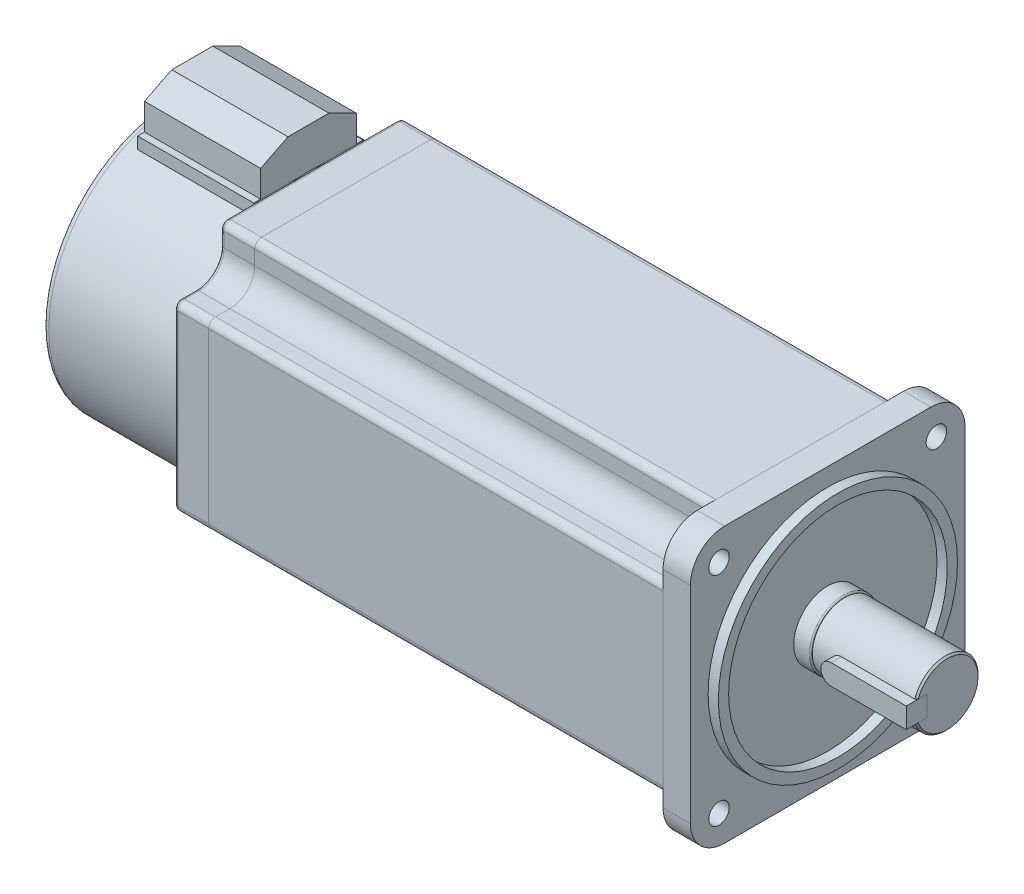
ISO-10303-21;
HEADER;
FILE_DESCRIPTION(('STEP AP214'),'2;1');
FILE_NAME('part.step','',(''),(''),'','','');
FILE_SCHEMA(('AUTOMOTIVE_DESIGN { 1 0 10303 214 1 1 1 1 }'));
ENDSEC;
DATA;
#1=APPLICATION_CONTEXT('core data for automotive mechanical design processes');
#2=APPLICATION_PROTOCOL_DEFINITION('international standard','automotive_design',2000,#1);
#3=PRODUCT_CONTEXT('',#1,'mechanical');
#4=PRODUCT('Part','Part','',(#3));
#5=PRODUCT_RELATED_PRODUCT_CATEGORY('part','',(#4));
#6=PRODUCT_DEFINITION_FORMATION('','',#4);
#7=PRODUCT_DEFINITION_CONTEXT('part definition',#1,'design');
#8=PRODUCT_DEFINITION('design','',#6,#7);
#9=PRODUCT_DEFINITION_SHAPE('','',#8);
#10=(LENGTH_UNIT() NAMED_UNIT(*) SI_UNIT(.MILLI.,.METRE.));
#11=(NAMED_UNIT(*) PLANE_ANGLE_UNIT() SI_UNIT($,.RADIAN.));
#12=(NAMED_UNIT(*) SI_UNIT($,.STERADIAN.) SOLID_ANGLE_UNIT());
#13=UNCERTAINTY_MEASURE_WITH_UNIT(LENGTH_MEASURE(1.E-05),#10,'distance_accuracy_value','');
#14=(GEOMETRIC_REPRESENTATION_CONTEXT(3) GLOBAL_UNCERTAINTY_ASSIGNED_CONTEXT((#13)) GLOBAL_UNIT_ASSIGNED_CONTEXT((#10,
#11,#12)) REPRESENTATION_CONTEXT('',''));
#15=CARTESIAN_POINT('',(0.,0.,0.));
#16=DIRECTION('',(0.,0.,1.));
#17=DIRECTION('',(1.,0.,0.));
#18=AXIS2_PLACEMENT_3D('',#15,#16,#17);
#19=CARTESIAN_POINT('',(-144.,50.8,14.));
#20=DIRECTION('',(-1.,0.,0.));
#21=DIRECTION('',(0.,0.,1.));
#22=AXIS2_PLACEMENT_3D('',#19,#20,#21);
#23=PLANE('',#22);
#24=DIRECTION('',(0.,0.,-1.));
#25=VECTOR('',#24,1.);
#26=CARTESIAN_POINT('',(-144.,50.8,14.));
#27=LINE('',#26,#25);
#28=CARTESIAN_POINT('',(-144.,50.8,6.));
#29=VERTEX_POINT('',#28);
#30=CARTESIAN_POINT('',(-144.,50.8,-6.));
#31=VERTEX_POINT('',#30);
#32=EDGE_CURVE('E111',#29,#31,#27,.T.);
#33=ORIENTED_EDGE('',*,*,#32,.F.);
#34=DIRECTION('',(0.,-0.447213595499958,0.894427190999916));
#35=VECTOR('',#34,1.);
#36=CARTESIAN_POINT('',(-144.,50.8,6.));
#37=LINE('',#36,#35);
#38=CARTESIAN_POINT('',(-144.,46.8,14.));
#39=VERTEX_POINT('',#38);
#40=EDGE_CURVE('E60',#29,#39,#37,.T.);
#41=ORIENTED_EDGE('',*,*,#40,.T.);
#42=DIRECTION('',(0.,-1.,0.));
#43=VECTOR('',#42,1.);
#44=CARTESIAN_POINT('',(-144.,50.8,14.));
#45=LINE('',#44,#43);
#46=CARTESIAN_POINT('',(-144.,39.,14.));
#47=VERTEX_POINT('',#46);
#48=EDGE_CURVE('E108',#39,#47,#45,.T.);
#49=ORIENTED_EDGE('',*,*,#48,.T.);
#50=DIRECTION('',(0.,0.,-1.));
#51=VECTOR('',#50,1.);
#52=CARTESIAN_POINT('',(-144.,39.,14.));
#53=LINE('',#52,#51);
#54=CARTESIAN_POINT('',(-144.,39.,-14.));
#55=VERTEX_POINT('',#54);
#56=EDGE_CURVE('E140',#47,#55,#53,.T.);
#57=ORIENTED_EDGE('',*,*,#56,.T.);
#58=DIRECTION('',(0.,-1.,0.));
#59=VECTOR('',#58,1.);
#60=CARTESIAN_POINT('',(-144.,50.8,-14.));
#61=LINE('',#60,#59);
#62=CARTESIAN_POINT('',(-144.,46.8,-14.));
#63=VERTEX_POINT('',#62);
#64=EDGE_CURVE('E12',#63,#55,#61,.T.);
#65=ORIENTED_EDGE('',*,*,#64,.F.);
#66=DIRECTION('',(0.,0.447213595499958,0.894427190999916));
#67=VECTOR('',#66,1.);
#68=CARTESIAN_POINT('',(-144.,46.8,-14.));
#69=LINE('',#68,#67);
#70=EDGE_CURVE('E149',#63,#31,#69,.T.);
#71=ORIENTED_EDGE('',*,*,#70,.T.);
#72=EDGE_LOOP('',(#33,#41,#49,#57,#65,#71));
#73=FACE_BOUND('',#72,.T.);
#74=ADVANCED_FACE('F46',(#73),#23,.F.);
#75=CARTESIAN_POINT('',(-178.,50.8,-14.));
#76=DIRECTION('',(0.,0.,1.));
#77=DIRECTION('',(1.,0.,0.));
#78=AXIS2_PLACEMENT_3D('',#75,#76,#77);
#79=PLANE('',#78);
#80=DIRECTION('',(0.,-1.,0.));
#81=VECTOR('',#80,1.);
#82=CARTESIAN_POINT('',(-178.,50.8,-14.));
#83=LINE('',#82,#81);
#84=CARTESIAN_POINT('',(-178.,46.8,-14.));
#85=VERTEX_POINT('',#84);
#86=CARTESIAN_POINT('',(-178.,39.,-14.));
#87=VERTEX_POINT('',#86);
#88=EDGE_CURVE('E53',#85,#87,#83,.T.);
#89=ORIENTED_EDGE('',*,*,#88,.F.);
#90=DIRECTION('',(-1.,0.,0.));
#91=VECTOR('',#90,1.);
#92=CARTESIAN_POINT('',(-144.,46.8,-14.));
#93=LINE('',#92,#91);
#94=EDGE_CURVE('E147',#63,#85,#93,.T.);
#95=ORIENTED_EDGE('',*,*,#94,.F.);
#96=ORIENTED_EDGE('',*,*,#64,.T.);
#97=DIRECTION('',(-1.,0.,0.));
#98=VECTOR('',#97,1.);
#99=CARTESIAN_POINT('',(-178.,39.,-14.));
#100=LINE('',#99,#98);
#101=EDGE_CURVE('E136',#55,#87,#100,.T.);
#102=ORIENTED_EDGE('',*,*,#101,.T.);
#103=EDGE_LOOP('',(#89,#95,#96,#102));
#104=FACE_BOUND('',#103,.T.);
#105=ADVANCED_FACE('F137',(#104),#79,.F.);
#106=CARTESIAN_POINT('',(-178.,50.8,14.));
#107=DIRECTION('',(1.,0.,0.));
#108=DIRECTION('',(0.,0.,-1.));
#109=AXIS2_PLACEMENT_3D('',#106,#107,#108);
#110=PLANE('',#109);
#111=DIRECTION('',(0.,-1.,0.));
#112=VECTOR('',#111,1.);
#113=CARTESIAN_POINT('',(-178.,50.8,14.));
#114=LINE('',#113,#112);
#115=CARTESIAN_POINT('',(-178.,46.8,14.));
#116=VERTEX_POINT('',#115);
#117=CARTESIAN_POINT('',(-178.,39.,14.));
#118=VERTEX_POINT('',#117);
#119=EDGE_CURVE('E117',#116,#118,#114,.T.);
#120=ORIENTED_EDGE('',*,*,#119,.F.);
#121=DIRECTION('',(0.,-0.447213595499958,0.894427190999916));
#122=VECTOR('',#121,1.);
#123=CARTESIAN_POINT('',(-178.,50.8,6.));
#124=LINE('',#123,#122);
#125=CARTESIAN_POINT('',(-178.,50.8,6.));
#126=VERTEX_POINT('',#125);
#127=EDGE_CURVE('E99',#126,#116,#124,.T.);
#128=ORIENTED_EDGE('',*,*,#127,.F.);
#129=DIRECTION('',(0.,0.,1.));
#130=VECTOR('',#129,1.);
#131=CARTESIAN_POINT('',(-178.,50.8,14.));
#132=LINE('',#131,#130);
#133=CARTESIAN_POINT('',(-178.,50.8,-6.));
#134=VERTEX_POINT('',#133);
#135=EDGE_CURVE('E118',#134,#126,#132,.T.);
#136=ORIENTED_EDGE('',*,*,#135,.F.);
#137=DIRECTION('',(0.,0.447213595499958,0.894427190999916));
#138=VECTOR('',#137,1.);
#139=CARTESIAN_POINT('',(-178.,46.8,-14.));
#140=LINE('',#139,#138);
#141=EDGE_CURVE('E68',#85,#134,#140,.T.);
#142=ORIENTED_EDGE('',*,*,#141,.F.);
#143=ORIENTED_EDGE('',*,*,#88,.T.);
#144=DIRECTION('',(0.,0.,1.));
#145=VECTOR('',#144,1.);
#146=CARTESIAN_POINT('',(-178.,39.,14.));
#147=LINE('',#146,#145);
#148=EDGE_CURVE('E131',#87,#118,#147,.T.);
#149=ORIENTED_EDGE('',*,*,#148,.T.);
#150=EDGE_LOOP('',(#120,#128,#136,#142,#143,#149));
#151=FACE_BOUND('',#150,.T.);
#152=ADVANCED_FACE('F129',(#151),#110,.F.);
#153=CARTESIAN_POINT('',(-178.,50.8,14.));
#154=DIRECTION('',(0.,0.,-1.));
#155=DIRECTION('',(-1.,0.,0.));
#156=AXIS2_PLACEMENT_3D('',#153,#154,#155);
#157=PLANE('',#156);
#158=ORIENTED_EDGE('',*,*,#48,.F.);
#159=DIRECTION('',(-1.,0.,0.));
#160=VECTOR('',#159,1.);
#161=CARTESIAN_POINT('',(-144.,46.8,14.));
#162=LINE('',#161,#160);
#163=EDGE_CURVE('E96',#39,#116,#162,.T.);
#164=ORIENTED_EDGE('',*,*,#163,.T.);
#165=ORIENTED_EDGE('',*,*,#119,.T.);
#166=DIRECTION('',(1.,0.,0.));
#167=VECTOR('',#166,1.);
#168=CARTESIAN_POINT('',(-178.,39.,14.));
#169=LINE('',#168,#167);
#170=EDGE_CURVE('E115',#118,#47,#169,.T.);
#171=ORIENTED_EDGE('',*,*,#170,.T.);
#172=EDGE_LOOP('',(#158,#164,#165,#171));
#173=FACE_BOUND('',#172,.T.);
#174=ADVANCED_FACE('F113',(#173),#157,.F.);
#175=CARTESIAN_POINT('',(0.,50.8,0.));
#176=DIRECTION('',(0.,-1.,0.));
#177=DIRECTION('',(0.,0.,-1.));
#178=AXIS2_PLACEMENT_3D('',#175,#176,#177);
#179=PLANE('',#178);
#180=ORIENTED_EDGE('',*,*,#135,.T.);
#181=DIRECTION('',(-1.,0.,0.));
#182=VECTOR('',#181,1.);
#183=CARTESIAN_POINT('',(-144.,50.8,6.));
#184=LINE('',#183,#182);
#185=EDGE_CURVE('E103',#29,#126,#184,.T.);
#186=ORIENTED_EDGE('',*,*,#185,.F.);
#187=ORIENTED_EDGE('',*,*,#32,.T.);
#188=DIRECTION('',(-1.,0.,0.));
#189=VECTOR('',#188,1.);
#190=CARTESIAN_POINT('',(-144.,50.8,-6.));
#191=LINE('',#190,#189);
#192=EDGE_CURVE('E144',#31,#134,#191,.T.);
#193=ORIENTED_EDGE('',*,*,#192,.T.);
#194=EDGE_LOOP('',(#180,#186,#187,#193));
#195=FACE_BOUND('',#194,.T.);
#196=ADVANCED_FACE('F155',(#195),#179,.F.);
#197=CARTESIAN_POINT('',(0.,39.,0.));
#198=DIRECTION('',(0.,-1.,0.));
#199=DIRECTION('',(0.,0.,-1.));
#200=AXIS2_PLACEMENT_3D('',#197,#198,#199);
#201=PLANE('',#200);
#202=ORIENTED_EDGE('',*,*,#56,.F.);
#203=ORIENTED_EDGE('',*,*,#170,.F.);
#204=ORIENTED_EDGE('',*,*,#148,.F.);
#205=ORIENTED_EDGE('',*,*,#101,.F.);
#206=EDGE_LOOP('',(#202,#203,#204,#205));
#207=FACE_BOUND('',#206,.T.);
#208=ADVANCED_FACE('F142',(#207),#201,.T.);
#209=CARTESIAN_POINT('',(-144.,46.8,-14.));
#210=DIRECTION('',(0.,-0.894427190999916,0.447213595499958));
#211=DIRECTION('',(0.,-0.447213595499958,-0.894427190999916));
#212=AXIS2_PLACEMENT_3D('',#209,#210,#211);
#213=PLANE('',#212);
#214=ORIENTED_EDGE('',*,*,#141,.T.);
#215=ORIENTED_EDGE('',*,*,#192,.F.);
#216=ORIENTED_EDGE('',*,*,#70,.F.);
#217=ORIENTED_EDGE('',*,*,#94,.T.);
#218=EDGE_LOOP('',(#214,#215,#216,#217));
#219=FACE_BOUND('',#218,.T.);
#220=ADVANCED_FACE('F156',(#219),#213,.F.);
#221=CARTESIAN_POINT('',(-144.,50.8,6.));
#222=DIRECTION('',(0.,-0.894427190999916,-0.447213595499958));
#223=DIRECTION('',(0.,0.447213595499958,-0.894427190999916));
#224=AXIS2_PLACEMENT_3D('',#221,#222,#223);
#225=PLANE('',#224);
#226=ORIENTED_EDGE('',*,*,#127,.T.);
#227=ORIENTED_EDGE('',*,*,#163,.F.);
#228=ORIENTED_EDGE('',*,*,#40,.F.);
#229=ORIENTED_EDGE('',*,*,#185,.T.);
#230=EDGE_LOOP('',(#226,#227,#228,#229));
#231=FACE_BOUND('',#230,.T.);
#232=ADVANCED_FACE('F97',(#231),#225,.F.);
#233=CLOSED_SHELL('',(#74,#105,#152,#174,#196,#208,#220,#232));
#234=MANIFOLD_SOLID_BREP('B2',#233);
#235=CARTESIAN_POINT('',(-183.,0.,0.));
#236=DIRECTION('',(1.,0.,0.));
#237=DIRECTION('',(0.,0.,-1.));
#238=AXIS2_PLACEMENT_3D('',#235,#236,#237);
#239=CYLINDRICAL_SURFACE('',#238,39.);
#240=DIRECTION('',(1.,0.,0.));
#241=VECTOR('',#240,1.);
#242=CARTESIAN_POINT('',(-183.,35.5668384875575,16.));
#243=LINE('',#242,#241);
#244=CARTESIAN_POINT('',(-144.,35.5668384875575,16.));
#245=VERTEX_POINT('',#244);
#246=CARTESIAN_POINT('',(-178.,35.5668384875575,16.));
#247=VERTEX_POINT('',#246);
#248=EDGE_CURVE('E44',#245,#247,#243,.F.);
#249=ORIENTED_EDGE('',*,*,#248,.T.);
#250=CARTESIAN_POINT('',(-178.,0.,0.));
#251=DIRECTION('',(-1.,0.,0.));
#252=DIRECTION('',(0.,0.,1.));
#253=AXIS2_PLACEMENT_3D('',#250,#251,#252);
#254=CIRCLE('',#253,39.);
#255=CARTESIAN_POINT('',(-178.,39.,0.));
#256=VERTEX_POINT('',#255);
#257=EDGE_CURVE('E320',#247,#256,#254,.T.);
#258=ORIENTED_EDGE('',*,*,#257,.T.);
#259=CARTESIAN_POINT('',(-178.,0.,0.));
#260=DIRECTION('',(1.,0.,0.));
#261=DIRECTION('',(0.,0.,-1.));
#262=AXIS2_PLACEMENT_3D('',#259,#260,#261);
#263=CIRCLE('',#262,39.);
#264=CARTESIAN_POINT('',(-178.,35.5668384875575,-16.));
#265=VERTEX_POINT('',#264);
#266=EDGE_CURVE('E304',#265,#256,#263,.T.);
#267=ORIENTED_EDGE('',*,*,#266,.F.);
#268=DIRECTION('',(1.,0.,0.));
#269=VECTOR('',#268,1.);
#270=CARTESIAN_POINT('',(-183.,35.5668384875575,-16.));
#271=LINE('',#270,#269);
#272=CARTESIAN_POINT('',(-144.,35.5668384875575,-16.));
#273=VERTEX_POINT('',#272);
#274=EDGE_CURVE('E240',#265,#273,#271,.T.);
#275=ORIENTED_EDGE('',*,*,#274,.T.);
#276=CARTESIAN_POINT('',(-144.,0.,0.));
#277=DIRECTION('',(1.,0.,0.));
#278=DIRECTION('',(0.,0.,-1.));
#279=AXIS2_PLACEMENT_3D('',#276,#277,#278);
#280=CIRCLE('',#279,39.);
#281=CARTESIAN_POINT('',(-144.,39.,0.));
#282=VERTEX_POINT('',#281);
#283=EDGE_CURVE('E303',#273,#282,#280,.T.);
#284=ORIENTED_EDGE('',*,*,#283,.T.);
#285=CARTESIAN_POINT('',(-144.,0.,0.));
#286=DIRECTION('',(-1.,0.,0.));
#287=DIRECTION('',(0.,0.,1.));
#288=AXIS2_PLACEMENT_3D('',#285,#286,#287);
#289=CIRCLE('',#288,39.);
#290=EDGE_CURVE('E255',#245,#282,#289,.T.);
#291=ORIENTED_EDGE('',*,*,#290,.F.);
#292=EDGE_LOOP('',(#249,#258,#267,#275,#284,#291));
#293=FACE_BOUND('',#292,.T.);
#294=CARTESIAN_POINT('',(-181.,0.,0.));
#295=DIRECTION('',(-1.,0.,0.));
#296=DIRECTION('',(0.,0.,1.));
#297=AXIS2_PLACEMENT_3D('',#294,#295,#296);
#298=CIRCLE('',#297,39.);
#299=CARTESIAN_POINT('',(-181.,0.,39.));
#300=VERTEX_POINT('',#299);
#301=EDGE_CURVE('E317',#300,#300,#298,.F.);
#302=ORIENTED_EDGE('',*,*,#301,.T.);
#303=EDGE_LOOP('',(#302));
#304=FACE_BOUND('',#303,.T.);
#305=CARTESIAN_POINT('',(-143.,0.,0.));
#306=DIRECTION('',(-1.,0.,0.));
#307=DIRECTION('',(0.,0.,1.));
#308=AXIS2_PLACEMENT_3D('',#305,#306,#307);
#309=CIRCLE('',#308,39.);
#310=CARTESIAN_POINT('',(-143.,0.,39.));
#311=VERTEX_POINT('',#310);
#312=EDGE_CURVE('E311',#311,#311,#309,.T.);
#313=ORIENTED_EDGE('',*,*,#312,.T.);
#314=EDGE_LOOP('',(#313));
#315=FACE_BOUND('',#314,.T.);
#316=ADVANCED_FACE('F232',(#293,#304,#315),#239,.T.);
#317=CARTESIAN_POINT('',(-183.,0.,0.));
#318=DIRECTION('',(-1.,0.,0.));
#319=DIRECTION('',(0.,0.,1.));
#320=AXIS2_PLACEMENT_3D('',#317,#318,#319);
#321=PLANE('',#320);
#322=CARTESIAN_POINT('',(-183.,0.,0.));
#323=DIRECTION('',(-1.,0.,0.));
#324=DIRECTION('',(0.,0.,1.));
#325=AXIS2_PLACEMENT_3D('',#322,#323,#324);
#326=CIRCLE('',#325,37.);
#327=CARTESIAN_POINT('',(-183.,0.,37.));
#328=VERTEX_POINT('',#327);
#329=EDGE_CURVE('E314',#328,#328,#326,.T.);
#330=ORIENTED_EDGE('',*,*,#329,.T.);
#331=EDGE_LOOP('',(#330));
#332=FACE_BOUND('',#331,.T.);
#333=ADVANCED_FACE('F349',(#332),#321,.T.);
#334=CARTESIAN_POINT('',(-143.,0.,0.));
#335=DIRECTION('',(-1.,0.,0.));
#336=DIRECTION('',(0.,0.,1.));
#337=AXIS2_PLACEMENT_3D('',#334,#335,#336);
#338=PLANE('',#337);
#339=ORIENTED_EDGE('',*,*,#312,.F.);
#340=EDGE_LOOP('',(#339));
#341=FACE_BOUND('',#340,.T.);
#342=ADVANCED_FACE('F353',(#341),#338,.F.);
#343=CARTESIAN_POINT('',(-181.,0.,0.));
#344=DIRECTION('',(-1.,0.,0.));
#345=DIRECTION('',(0.,0.,1.));
#346=AXIS2_PLACEMENT_3D('',#343,#344,#345);
#347=TOROIDAL_SURFACE('',#346,37.,2.);
#348=ORIENTED_EDGE('',*,*,#301,.F.);
#349=EDGE_LOOP('',(#348));
#350=FACE_BOUND('',#349,.T.);
#351=ORIENTED_EDGE('',*,*,#329,.F.);
#352=EDGE_LOOP('',(#351));
#353=FACE_BOUND('',#352,.T.);
#354=ADVANCED_FACE('F234',(#350,#353),#347,.T.);
#355=CARTESIAN_POINT('',(-144.,39.,16.));
#356=DIRECTION('',(-1.,0.,0.));
#357=DIRECTION('',(0.,0.,1.));
#358=AXIS2_PLACEMENT_3D('',#355,#356,#357);
#359=PLANE('',#358);
#360=DIRECTION('',(0.,-1.,0.));
#361=VECTOR('',#360,1.);
#362=CARTESIAN_POINT('',(-144.,39.,16.));
#363=LINE('',#362,#361);
#364=CARTESIAN_POINT('',(-144.,39.,16.));
#365=VERTEX_POINT('',#364);
#366=EDGE_CURVE('E332',#365,#245,#363,.T.);
#367=ORIENTED_EDGE('',*,*,#366,.T.);
#368=ORIENTED_EDGE('',*,*,#290,.T.);
#369=DIRECTION('',(0.,0.,-1.));
#370=VECTOR('',#369,1.);
#371=CARTESIAN_POINT('',(-144.,39.,16.));
#372=LINE('',#371,#370);
#373=EDGE_CURVE('E287',#365,#282,#372,.T.);
#374=ORIENTED_EDGE('',*,*,#373,.F.);
#375=EDGE_LOOP('',(#367,#368,#374));
#376=FACE_BOUND('',#375,.T.);
#377=ADVANCED_FACE('F336',(#376),#359,.F.);
#378=CARTESIAN_POINT('',(-144.,39.,-16.));
#379=VERTEX_POINT('',#378);
#380=EDGE_CURVE('E281',#282,#379,#372,.T.);
#381=ORIENTED_EDGE('',*,*,#380,.F.);
#382=ORIENTED_EDGE('',*,*,#283,.F.);
#383=DIRECTION('',(0.,-1.,0.));
#384=VECTOR('',#383,1.);
#385=CARTESIAN_POINT('',(-144.,39.,-16.));
#386=LINE('',#385,#384);
#387=EDGE_CURVE('E295',#379,#273,#386,.T.);
#388=ORIENTED_EDGE('',*,*,#387,.F.);
#389=EDGE_LOOP('',(#381,#382,#388));
#390=FACE_BOUND('',#389,.T.);
#391=ADVANCED_FACE('F302',(#390),#359,.F.);
#392=CARTESIAN_POINT('',(-178.,39.,-16.));
#393=DIRECTION('',(0.,0.,1.));
#394=DIRECTION('',(1.,0.,0.));
#395=AXIS2_PLACEMENT_3D('',#392,#393,#394);
#396=PLANE('',#395);
#397=ORIENTED_EDGE('',*,*,#387,.T.);
#398=ORIENTED_EDGE('',*,*,#274,.F.);
#399=DIRECTION('',(0.,-1.,0.));
#400=VECTOR('',#399,1.);
#401=CARTESIAN_POINT('',(-178.,39.,-16.));
#402=LINE('',#401,#400);
#403=CARTESIAN_POINT('',(-178.,39.,-16.));
#404=VERTEX_POINT('',#403);
#405=EDGE_CURVE('E298',#404,#265,#402,.T.);
#406=ORIENTED_EDGE('',*,*,#405,.F.);
#407=DIRECTION('',(-1.,0.,0.));
#408=VECTOR('',#407,1.);
#409=CARTESIAN_POINT('',(-178.,39.,-16.));
#410=LINE('',#409,#408);
#411=EDGE_CURVE('E285',#379,#404,#410,.T.);
#412=ORIENTED_EDGE('',*,*,#411,.F.);
#413=EDGE_LOOP('',(#397,#398,#406,#412));
#414=FACE_BOUND('',#413,.T.);
#415=ADVANCED_FACE('F294',(#414),#396,.F.);
#416=CARTESIAN_POINT('',(-178.,39.,16.));
#417=DIRECTION('',(1.,0.,0.));
#418=DIRECTION('',(0.,0.,-1.));
#419=AXIS2_PLACEMENT_3D('',#416,#417,#418);
#420=PLANE('',#419);
#421=ORIENTED_EDGE('',*,*,#405,.T.);
#422=ORIENTED_EDGE('',*,*,#266,.T.);
#423=DIRECTION('',(0.,0.,1.));
#424=VECTOR('',#423,1.);
#425=CARTESIAN_POINT('',(-178.,39.,16.));
#426=LINE('',#425,#424);
#427=EDGE_CURVE('E329',#404,#256,#426,.T.);
#428=ORIENTED_EDGE('',*,*,#427,.F.);
#429=EDGE_LOOP('',(#421,#422,#428));
#430=FACE_BOUND('',#429,.T.);
#431=ADVANCED_FACE('F327',(#430),#420,.F.);
#432=CARTESIAN_POINT('',(-178.,39.,16.));
#433=VERTEX_POINT('',#432);
#434=EDGE_CURVE('E300',#256,#433,#426,.T.);
#435=ORIENTED_EDGE('',*,*,#434,.F.);
#436=ORIENTED_EDGE('',*,*,#257,.F.);
#437=DIRECTION('',(0.,-1.,0.));
#438=VECTOR('',#437,1.);
#439=CARTESIAN_POINT('',(-178.,39.,16.));
#440=LINE('',#439,#438);
#441=EDGE_CURVE('E247',#433,#247,#440,.T.);
#442=ORIENTED_EDGE('',*,*,#441,.F.);
#443=EDGE_LOOP('',(#435,#436,#442));
#444=FACE_BOUND('',#443,.T.);
#445=ADVANCED_FACE('F339',(#444),#420,.F.);
#446=CARTESIAN_POINT('',(-178.,39.,16.));
#447=DIRECTION('',(0.,0.,-1.));
#448=DIRECTION('',(-1.,0.,0.));
#449=AXIS2_PLACEMENT_3D('',#446,#447,#448);
#450=PLANE('',#449);
#451=ORIENTED_EDGE('',*,*,#441,.T.);
#452=ORIENTED_EDGE('',*,*,#248,.F.);
#453=ORIENTED_EDGE('',*,*,#366,.F.);
#454=DIRECTION('',(1.,0.,0.));
#455=VECTOR('',#454,1.);
#456=CARTESIAN_POINT('',(-178.,39.,16.));
#457=LINE('',#456,#455);
#458=EDGE_CURVE('E330',#433,#365,#457,.T.);
#459=ORIENTED_EDGE('',*,*,#458,.F.);
#460=EDGE_LOOP('',(#451,#452,#453,#459));
#461=FACE_BOUND('',#460,.T.);
#462=ADVANCED_FACE('F337',(#461),#450,.F.);
#463=CARTESIAN_POINT('',(0.,39.,0.));
#464=DIRECTION('',(0.,-1.,0.));
#465=DIRECTION('',(0.,0.,-1.));
#466=AXIS2_PLACEMENT_3D('',#463,#464,#465);
#467=PLANE('',#466);
#468=ORIENTED_EDGE('',*,*,#373,.T.);
#469=ORIENTED_EDGE('',*,*,#380,.T.);
#470=ORIENTED_EDGE('',*,*,#411,.T.);
#471=ORIENTED_EDGE('',*,*,#427,.T.);
#472=ORIENTED_EDGE('',*,*,#434,.T.);
#473=ORIENTED_EDGE('',*,*,#458,.T.);
#474=EDGE_LOOP('',(#468,#469,#470,#471,#472,#473));
#475=FACE_BOUND('',#474,.T.);
#476=ADVANCED_FACE('F283',(#475),#467,.F.);
#477=CLOSED_SHELL('',(#316,#333,#342,#354,#377,#391,#415,#431,#445,#462,#476));
#478=MANIFOLD_SOLID_BREP('B6',#477);
#479=CARTESIAN_POINT('',(21.,0.,12.));
#480=DIRECTION('',(0.,0.,-1.));
#481=DIRECTION('',(-1.,0.,0.));
#482=AXIS2_PLACEMENT_3D('',#479,#480,#481);
#483=CYLINDRICAL_SURFACE('',#482,3.);
#484=CARTESIAN_POINT('',(21.,0.,6.));
#485=DIRECTION('',(0.,0.,1.));
#486=DIRECTION('',(1.,0.,0.));
#487=AXIS2_PLACEMENT_3D('',#484,#485,#486);
#488=CIRCLE('',#487,3.);
#489=CARTESIAN_POINT('',(21.,3.,6.));
#490=VERTEX_POINT('',#489);
#491=CARTESIAN_POINT('',(21.,-3.,6.));
#492=VERTEX_POINT('',#491);
#493=EDGE_CURVE('E510',#490,#492,#488,.T.);
#494=ORIENTED_EDGE('',*,*,#493,.T.);
#495=DIRECTION('',(0.,0.,-1.));
#496=VECTOR('',#495,1.);
#497=CARTESIAN_POINT('',(21.,-3.,12.));
#498=LINE('',#497,#496);
#499=CARTESIAN_POINT('',(21.,-3.,12.));
#500=VERTEX_POINT('',#499);
#501=EDGE_CURVE('E230',#500,#492,#498,.T.);
#502=ORIENTED_EDGE('',*,*,#501,.F.);
#503=CARTESIAN_POINT('',(21.,0.,12.));
#504=DIRECTION('',(0.,0.,1.));
#505=DIRECTION('',(1.,0.,0.));
#506=AXIS2_PLACEMENT_3D('',#503,#504,#505);
#507=CIRCLE('',#506,3.);
#508=CARTESIAN_POINT('',(21.,3.,12.));
#509=VERTEX_POINT('',#508);
#510=EDGE_CURVE('E498',#509,#500,#507,.T.);
#511=ORIENTED_EDGE('',*,*,#510,.F.);
#512=DIRECTION('',(0.,0.,-1.));
#513=VECTOR('',#512,1.);
#514=CARTESIAN_POINT('',(21.,3.,12.));
#515=LINE('',#514,#513);
#516=EDGE_CURVE('E506',#509,#490,#515,.T.);
#517=ORIENTED_EDGE('',*,*,#516,.T.);
#518=EDGE_LOOP('',(#494,#502,#511,#517));
#519=FACE_BOUND('',#518,.T.);
#520=ADVANCED_FACE('F447',(#519),#483,.T.);
#521=CARTESIAN_POINT('',(43.,-3.,12.));
#522=DIRECTION('',(0.,1.,0.));
#523=DIRECTION('',(-1.,0.,0.));
#524=AXIS2_PLACEMENT_3D('',#521,#522,#523);
#525=PLANE('',#524);
#526=DIRECTION('',(1.,0.,0.));
#527=VECTOR('',#526,1.);
#528=CARTESIAN_POINT('',(43.,-3.,6.));
#529=LINE('',#528,#527);
#530=CARTESIAN_POINT('',(43.,-3.,6.));
#531=VERTEX_POINT('',#530);
#532=EDGE_CURVE('E502',#492,#531,#529,.T.);
#533=ORIENTED_EDGE('',*,*,#532,.T.);
#534=DIRECTION('',(0.,0.,-1.));
#535=VECTOR('',#534,1.);
#536=CARTESIAN_POINT('',(43.,-3.,12.));
#537=LINE('',#536,#535);
#538=CARTESIAN_POINT('',(43.,-3.,12.));
#539=VERTEX_POINT('',#538);
#540=EDGE_CURVE('E455',#539,#531,#537,.T.);
#541=ORIENTED_EDGE('',*,*,#540,.F.);
#542=DIRECTION('',(1.,0.,0.));
#543=VECTOR('',#542,1.);
#544=CARTESIAN_POINT('',(43.,-3.,12.));
#545=LINE('',#544,#543);
#546=EDGE_CURVE('E493',#500,#539,#545,.T.);
#547=ORIENTED_EDGE('',*,*,#546,.F.);
#548=ORIENTED_EDGE('',*,*,#501,.T.);
#549=EDGE_LOOP('',(#533,#541,#547,#548));
#550=FACE_BOUND('',#549,.T.);
#551=ADVANCED_FACE('F501',(#550),#525,.F.);
#552=CARTESIAN_POINT('',(43.,3.,12.));
#553=DIRECTION('',(-1.,0.,0.));
#554=DIRECTION('',(0.,0.,1.));
#555=AXIS2_PLACEMENT_3D('',#552,#553,#554);
#556=PLANE('',#555);
#557=DIRECTION('',(0.,1.,0.));
#558=VECTOR('',#557,1.);
#559=CARTESIAN_POINT('',(43.,3.,6.));
#560=LINE('',#559,#558);
#561=CARTESIAN_POINT('',(43.,3.,6.));
#562=VERTEX_POINT('',#561);
#563=EDGE_CURVE('E480',#531,#562,#560,.T.);
#564=ORIENTED_EDGE('',*,*,#563,.T.);
#565=DIRECTION('',(0.,0.,-1.));
#566=VECTOR('',#565,1.);
#567=CARTESIAN_POINT('',(43.,3.,12.));
#568=LINE('',#567,#566);
#569=CARTESIAN_POINT('',(43.,3.,12.));
#570=VERTEX_POINT('',#569);
#571=EDGE_CURVE('E503',#570,#562,#568,.T.);
#572=ORIENTED_EDGE('',*,*,#571,.F.);
#573=DIRECTION('',(0.,1.,0.));
#574=VECTOR('',#573,1.);
#575=CARTESIAN_POINT('',(43.,3.,12.));
#576=LINE('',#575,#574);
#577=EDGE_CURVE('E496',#539,#570,#576,.T.);
#578=ORIENTED_EDGE('',*,*,#577,.F.);
#579=ORIENTED_EDGE('',*,*,#540,.T.);
#580=EDGE_LOOP('',(#564,#572,#578,#579));
#581=FACE_BOUND('',#580,.T.);
#582=ADVANCED_FACE('F504',(#581),#556,.F.);
#583=CARTESIAN_POINT('',(21.,3.,12.));
#584=DIRECTION('',(0.,-1.,0.));
#585=DIRECTION('',(1.,0.,0.));
#586=AXIS2_PLACEMENT_3D('',#583,#584,#585);
#587=PLANE('',#586);
#588=DIRECTION('',(-1.,0.,0.));
#589=VECTOR('',#588,1.);
#590=CARTESIAN_POINT('',(21.,3.,6.));
#591=LINE('',#590,#589);
#592=EDGE_CURVE('E486',#562,#490,#591,.T.);
#593=ORIENTED_EDGE('',*,*,#592,.T.);
#594=ORIENTED_EDGE('',*,*,#516,.F.);
#595=DIRECTION('',(-1.,0.,0.));
#596=VECTOR('',#595,1.);
#597=CARTESIAN_POINT('',(21.,3.,12.));
#598=LINE('',#597,#596);
#599=EDGE_CURVE('E463',#570,#509,#598,.T.);
#600=ORIENTED_EDGE('',*,*,#599,.F.);
#601=ORIENTED_EDGE('',*,*,#571,.T.);
#602=EDGE_LOOP('',(#593,#594,#600,#601));
#603=FACE_BOUND('',#602,.T.);
#604=ADVANCED_FACE('F517',(#603),#587,.F.);
#605=CARTESIAN_POINT('',(21.,0.,12.));
#606=DIRECTION('',(0.,0.,1.));
#607=DIRECTION('',(1.,0.,0.));
#608=AXIS2_PLACEMENT_3D('',#605,#606,#607);
#609=PLANE('',#608);
#610=ORIENTED_EDGE('',*,*,#510,.T.);
#611=ORIENTED_EDGE('',*,*,#546,.T.);
#612=ORIENTED_EDGE('',*,*,#577,.T.);
#613=ORIENTED_EDGE('',*,*,#599,.T.);
#614=EDGE_LOOP('',(#610,#611,#612,#613));
#615=FACE_BOUND('',#614,.T.);
#616=ADVANCED_FACE('F494',(#615),#609,.T.);
#617=CARTESIAN_POINT('',(21.,0.,6.));
#618=DIRECTION('',(0.,0.,1.));
#619=DIRECTION('',(1.,0.,0.));
#620=AXIS2_PLACEMENT_3D('',#617,#618,#619);
#621=PLANE('',#620);
#622=ORIENTED_EDGE('',*,*,#493,.F.);
#623=ORIENTED_EDGE('',*,*,#592,.F.);
#624=ORIENTED_EDGE('',*,*,#563,.F.);
#625=ORIENTED_EDGE('',*,*,#532,.F.);
#626=EDGE_LOOP('',(#622,#623,#624,#625));
#627=FACE_BOUND('',#626,.T.);
#628=ADVANCED_FACE('F520',(#627),#621,.F.);
#629=CLOSED_SHELL('',(#520,#551,#582,#604,#616,#628));
#630=MANIFOLD_SOLID_BREP('B38',#629);
#631=CARTESIAN_POINT('',(43.,0.,0.));
#632=DIRECTION('',(-1.,0.,0.));
#633=DIRECTION('',(0.,0.,1.));
#634=AXIS2_PLACEMENT_3D('',#631,#632,#633);
#635=CYLINDRICAL_SURFACE('',#634,9.5);
#636=DIRECTION('',(-1.,0.,0.));
#637=VECTOR('',#636,1.);
#638=CARTESIAN_POINT('',(43.,3.,9.01387818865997));
#639=LINE('',#638,#637);
#640=CARTESIAN_POINT('',(21.,3.,9.01387818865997));
#641=VERTEX_POINT('',#640);
#642=CARTESIAN_POINT('',(42.5,3.,9.01387818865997));
#643=VERTEX_POINT('',#642);
#644=EDGE_CURVE('E666',#641,#643,#639,.F.);
#645=ORIENTED_EDGE('',*,*,#644,.T.);
#646=CARTESIAN_POINT('',(42.5,0.,0.));
#647=DIRECTION('',(1.,0.,0.));
#648=DIRECTION('',(0.,0.,-1.));
#649=AXIS2_PLACEMENT_3D('',#646,#647,#648);
#650=CIRCLE('',#649,9.5);
#651=CARTESIAN_POINT('',(42.5,-3.,9.01387818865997));
#652=VERTEX_POINT('',#651);
#653=EDGE_CURVE('E594',#643,#652,#650,.F.);
#654=ORIENTED_EDGE('',*,*,#653,.T.);
#655=DIRECTION('',(-1.,0.,0.));
#656=VECTOR('',#655,1.);
#657=CARTESIAN_POINT('',(43.,-3.,9.01387818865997));
#658=LINE('',#657,#656);
#659=CARTESIAN_POINT('',(21.,-3.,9.01387818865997));
#660=VERTEX_POINT('',#659);
#661=EDGE_CURVE('E661',#652,#660,#658,.T.);
#662=ORIENTED_EDGE('',*,*,#661,.T.);
#663=CARTESIAN_POINT('',(21.,-3.,9.01387818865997));
#664=CARTESIAN_POINT('',(20.9178884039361,-3.00001051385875,9.0138659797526));
#665=CARTESIAN_POINT('',(20.8357837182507,-2.99662905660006,9.01499989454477));
#666=CARTESIAN_POINT('',(20.6722056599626,-2.98316404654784,9.01946917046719));
#667=CARTESIAN_POINT('',(20.5907321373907,-2.97308213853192,9.02280399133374));
#668=CARTESIAN_POINT('',(20.4292133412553,-2.94633448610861,9.03157240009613));
#669=CARTESIAN_POINT('',(20.3491647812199,-2.92968675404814,9.03700024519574));
#670=CARTESIAN_POINT('',(20.1908532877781,-2.88997412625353,9.04977799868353));
#671=CARTESIAN_POINT('',(20.112590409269,-2.86690903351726,9.05712796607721));
#672=CARTESIAN_POINT('',(19.8813586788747,-2.78838156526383,9.08173850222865));
#673=CARTESIAN_POINT('',(19.7317258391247,-2.72354999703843,9.10157261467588));
#674=CARTESIAN_POINT('',(19.4454502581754,-2.57094386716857,9.14584733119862));
#675=CARTESIAN_POINT('',(19.3088145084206,-2.48315705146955,9.17029039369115));
#676=CARTESIAN_POINT('',(19.0475918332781,-2.2838388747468,9.22198403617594));
#677=CARTESIAN_POINT('',(18.9235225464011,-2.17164444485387,9.24929895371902));
#678=CARTESIAN_POINT('',(18.6956125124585,-1.92811437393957,9.30311268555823));
#679=CARTESIAN_POINT('',(18.5917752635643,-1.79677542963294,9.32961135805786));
#680=CARTESIAN_POINT('',(18.4049616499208,-1.51492697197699,9.37954779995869));
#681=CARTESIAN_POINT('',(18.3225238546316,-1.36404405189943,9.40290050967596));
#682=CARTESIAN_POINT('',(18.184403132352,-1.049697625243,9.44315613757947));
#683=CARTESIAN_POINT('',(18.128712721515,-0.886237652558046,9.46006085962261));
#684=CARTESIAN_POINT('',(18.0474069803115,-0.556831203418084,9.48505937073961));
#685=CARTESIAN_POINT('',(18.0209003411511,-0.391124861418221,9.49341369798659));
#686=CARTESIAN_POINT('',(17.9958889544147,-0.0574168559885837,9.50129109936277));
#687=CARTESIAN_POINT('',(17.9973782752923,0.110584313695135,9.50081604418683));
#688=CARTESIAN_POINT('',(18.0277344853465,0.43782817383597,9.49126851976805));
#689=CARTESIAN_POINT('',(18.0556344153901,0.597170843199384,9.48249971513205));
#690=CARTESIAN_POINT('',(18.1364309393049,0.908782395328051,9.45772480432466));
#691=CARTESIAN_POINT('',(18.1893288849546,1.06105089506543,9.44171830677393));
#692=CARTESIAN_POINT('',(18.319232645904,1.35640803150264,9.40386197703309));
#693=CARTESIAN_POINT('',(18.3965292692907,1.4993594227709,9.38194214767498));
#694=CARTESIAN_POINT('',(18.5728017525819,1.77055948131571,9.33456474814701));
#695=CARTESIAN_POINT('',(18.6717829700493,1.89880450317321,9.309106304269));
#696=CARTESIAN_POINT('',(18.8935531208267,2.14270544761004,9.25608223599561));
#697=CARTESIAN_POINT('',(19.0171739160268,2.25759649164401,9.22847303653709));
#698=CARTESIAN_POINT('',(19.2822127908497,2.46526929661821,9.17518254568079));
#699=CARTESIAN_POINT('',(19.423636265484,2.55804433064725,9.14950184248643));
#700=CARTESIAN_POINT('',(19.7224948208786,2.71978065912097,9.10274637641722));
#701=CARTESIAN_POINT('',(19.8801034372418,2.7884391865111,9.08173131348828));
#702=CARTESIAN_POINT('',(20.2053868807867,2.89791755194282,9.04739847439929));
#703=CARTESIAN_POINT('',(20.3730456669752,2.93878053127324,9.0340687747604));
#704=CARTESIAN_POINT('',(20.6185881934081,2.97664323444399,9.02162485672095));
#705=CARTESIAN_POINT('',(20.6946296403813,2.98539986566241,9.01872707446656));
#706=CARTESIAN_POINT('',(20.8471008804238,2.99707362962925,9.01485301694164));
#707=CARTESIAN_POINT('',(20.9235299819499,2.99999890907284,9.01387406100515));
#708=CARTESIAN_POINT('',(21.,3.,9.01387818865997));
#709=B_SPLINE_CURVE_WITH_KNOTS('',3,(#663,#664,#665,#666,#667,#668,#669,#670,#671,#672,#673,
#674,#675,#676,#677,#678,#679,#680,#681,#682,#683,#684,#685,#686,#687,#688,#689,#690,#691,#692,
#693,#694,#695,#696,#697,#698,#699,#700,#701,#702,#703,#704,#705,#706,#707,#708),.UNSPECIFIED.,
.F.,.F.,(4,2,2,2,2,2,2,2,2,2,2,2,2,2,2,2,2,2,2,2,2,2,4),(0.,0.24624563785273,0.492430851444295,
0.737945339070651,0.983467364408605,1.47384684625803,1.9644886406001,2.47064554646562,
2.97688989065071,3.49485361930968,4.01267233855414,4.5141953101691,5.01561202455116,
5.49935290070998,5.98311993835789,6.47288577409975,6.96277275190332,7.47344235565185,
7.98426708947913,8.50129313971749,9.01751487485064,9.24710313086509,9.47637041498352),.UNSPECIFIED.);
#710=EDGE_CURVE('E640',#660,#641,#709,.T.);
#711=ORIENTED_EDGE('',*,*,#710,.T.);
#712=EDGE_LOOP('',(#645,#654,#662,#711));
#713=FACE_BOUND('',#712,.T.);
#714=CARTESIAN_POINT('',(13.,0.,0.));
#715=DIRECTION('',(1.,0.,0.));
#716=DIRECTION('',(0.,0.,-1.));
#717=AXIS2_PLACEMENT_3D('',#714,#715,#716);
#718=CIRCLE('',#717,9.5);
#719=CARTESIAN_POINT('',(13.,0.,-9.5));
#720=VERTEX_POINT('',#719);
#721=EDGE_CURVE('E668',#720,#720,#718,.T.);
#722=ORIENTED_EDGE('',*,*,#721,.T.);
#723=EDGE_LOOP('',(#722));
#724=FACE_BOUND('',#723,.T.);
#725=ADVANCED_FACE('F581',(#713,#724),#635,.T.);
#726=CARTESIAN_POINT('',(43.,0.,0.));
#727=DIRECTION('',(1.,0.,0.));
#728=DIRECTION('',(0.,0.,-1.));
#729=AXIS2_PLACEMENT_3D('',#726,#727,#728);
#730=PLANE('',#729);
#731=DIRECTION('',(0.,0.,1.));
#732=VECTOR('',#731,1.);
#733=CARTESIAN_POINT('',(43.,-3.,6.));
#734=LINE('',#733,#732);
#735=CARTESIAN_POINT('',(43.,-3.,6.));
#736=VERTEX_POINT('',#735);
#737=CARTESIAN_POINT('',(43.,-3.,8.48528137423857));
#738=VERTEX_POINT('',#737);
#739=EDGE_CURVE('E642',#736,#738,#734,.T.);
#740=ORIENTED_EDGE('',*,*,#739,.T.);
#741=CARTESIAN_POINT('',(43.,0.,0.));
#742=DIRECTION('',(1.,0.,0.));
#743=DIRECTION('',(0.,0.,-1.));
#744=AXIS2_PLACEMENT_3D('',#741,#742,#743);
#745=CIRCLE('',#744,9.);
#746=CARTESIAN_POINT('',(43.,3.,8.48528137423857));
#747=VERTEX_POINT('',#746);
#748=EDGE_CURVE('E676',#738,#747,#745,.T.);
#749=ORIENTED_EDGE('',*,*,#748,.T.);
#750=DIRECTION('',(0.,0.,1.));
#751=VECTOR('',#750,1.);
#752=CARTESIAN_POINT('',(43.,3.,6.));
#753=LINE('',#752,#751);
#754=CARTESIAN_POINT('',(43.,3.,6.));
#755=VERTEX_POINT('',#754);
#756=EDGE_CURVE('E662',#755,#747,#753,.T.);
#757=ORIENTED_EDGE('',*,*,#756,.F.);
#758=DIRECTION('',(0.,1.,0.));
#759=VECTOR('',#758,1.);
#760=CARTESIAN_POINT('',(43.,3.,6.));
#761=LINE('',#760,#759);
#762=EDGE_CURVE('E651',#736,#755,#761,.T.);
#763=ORIENTED_EDGE('',*,*,#762,.F.);
#764=EDGE_LOOP('',(#740,#749,#757,#763));
#765=FACE_BOUND('',#764,.T.);
#766=ADVANCED_FACE('F687',(#765),#730,.T.);
#767=CARTESIAN_POINT('',(13.,0.,0.));
#768=DIRECTION('',(1.,0.,0.));
#769=DIRECTION('',(0.,0.,-1.));
#770=AXIS2_PLACEMENT_3D('',#767,#768,#769);
#771=PLANE('',#770);
#772=ORIENTED_EDGE('',*,*,#721,.F.);
#773=EDGE_LOOP('',(#772));
#774=FACE_BOUND('',#773,.T.);
#775=ADVANCED_FACE('F684',(#774),#771,.F.);
#776=CARTESIAN_POINT('',(21.,0.,6.));
#777=DIRECTION('',(0.,0.,1.));
#778=DIRECTION('',(1.,0.,0.));
#779=AXIS2_PLACEMENT_3D('',#776,#777,#778);
#780=CYLINDRICAL_SURFACE('',#779,3.);
#781=DIRECTION('',(0.,0.,1.));
#782=VECTOR('',#781,1.);
#783=CARTESIAN_POINT('',(21.,-3.,6.));
#784=LINE('',#783,#782);
#785=CARTESIAN_POINT('',(21.,-3.,6.));
#786=VERTEX_POINT('',#785);
#787=EDGE_CURVE('E632',#786,#660,#784,.T.);
#788=ORIENTED_EDGE('',*,*,#787,.F.);
#789=CARTESIAN_POINT('',(21.,0.,6.));
#790=DIRECTION('',(0.,0.,1.));
#791=DIRECTION('',(1.,0.,0.));
#792=AXIS2_PLACEMENT_3D('',#789,#790,#791);
#793=CIRCLE('',#792,3.);
#794=CARTESIAN_POINT('',(21.,3.,6.));
#795=VERTEX_POINT('',#794);
#796=EDGE_CURVE('E637',#795,#786,#793,.T.);
#797=ORIENTED_EDGE('',*,*,#796,.F.);
#798=DIRECTION('',(0.,0.,1.));
#799=VECTOR('',#798,1.);
#800=CARTESIAN_POINT('',(21.,3.,6.));
#801=LINE('',#800,#799);
#802=EDGE_CURVE('E659',#795,#641,#801,.T.);
#803=ORIENTED_EDGE('',*,*,#802,.T.);
#804=ORIENTED_EDGE('',*,*,#710,.F.);
#805=EDGE_LOOP('',(#788,#797,#803,#804));
#806=FACE_BOUND('',#805,.T.);
#807=ADVANCED_FACE('F634',(#806),#780,.F.);
#808=CARTESIAN_POINT('',(21.,3.,6.));
#809=DIRECTION('',(0.,1.,0.));
#810=DIRECTION('',(-1.,0.,0.));
#811=AXIS2_PLACEMENT_3D('',#808,#809,#810);
#812=PLANE('',#811);
#813=ORIENTED_EDGE('',*,*,#756,.T.);
#814=CARTESIAN_POINT('',(43.,3.,8.48528137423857));
#815=CARTESIAN_POINT('',(42.9168065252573,3.,8.5735131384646));
#816=CARTESIAN_POINT('',(42.8335431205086,3.,8.66167875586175));
#817=CARTESIAN_POINT('',(42.6668764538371,3.,8.83787769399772));
#818=CARTESIAN_POINT('',(42.5834731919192,3.,8.92591101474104));
#819=CARTESIAN_POINT('',(42.5,3.,9.01387818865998));
#820=B_SPLINE_CURVE_WITH_KNOTS('',3,(#814,#815,#816,#817,#818,#819),.UNSPECIFIED.,.F.,.F.,(4,2,
4),(0.,0.363804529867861,0.727609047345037),.UNSPECIFIED.);
#821=EDGE_CURVE('E608',#747,#643,#820,.T.);
#822=ORIENTED_EDGE('',*,*,#821,.T.);
#823=ORIENTED_EDGE('',*,*,#644,.F.);
#824=ORIENTED_EDGE('',*,*,#802,.F.);
#825=DIRECTION('',(-1.,0.,0.));
#826=VECTOR('',#825,1.);
#827=CARTESIAN_POINT('',(21.,3.,6.));
#828=LINE('',#827,#826);
#829=EDGE_CURVE('E643',#755,#795,#828,.T.);
#830=ORIENTED_EDGE('',*,*,#829,.F.);
#831=EDGE_LOOP('',(#813,#822,#823,#824,#830));
#832=FACE_BOUND('',#831,.T.);
#833=ADVANCED_FACE('F683',(#832),#812,.F.);
#834=CARTESIAN_POINT('',(43.,-3.,6.));
#835=DIRECTION('',(0.,-1.,0.));
#836=DIRECTION('',(0.,0.,-1.));
#837=AXIS2_PLACEMENT_3D('',#834,#835,#836);
#838=PLANE('',#837);
#839=ORIENTED_EDGE('',*,*,#661,.F.);
#840=CARTESIAN_POINT('',(42.5,-3.,9.01387818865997));
#841=CARTESIAN_POINT('',(42.5834731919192,-3.,8.92591101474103));
#842=CARTESIAN_POINT('',(42.6668764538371,-3.,8.83787769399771));
#843=CARTESIAN_POINT('',(42.8335431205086,-3.,8.66167875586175));
#844=CARTESIAN_POINT('',(42.9168065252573,-3.,8.5735131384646));
#845=CARTESIAN_POINT('',(43.,-3.,8.48528137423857));
#846=B_SPLINE_CURVE_WITH_KNOTS('',3,(#840,#841,#842,#843,#844,#845),.UNSPECIFIED.,.F.,.F.,(4,2,
4),(0.,0.363804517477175,0.727609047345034),.UNSPECIFIED.);
#847=EDGE_CURVE('E445',#652,#738,#846,.T.);
#848=ORIENTED_EDGE('',*,*,#847,.T.);
#849=ORIENTED_EDGE('',*,*,#739,.F.);
#850=DIRECTION('',(1.,0.,0.));
#851=VECTOR('',#850,1.);
#852=CARTESIAN_POINT('',(43.,-3.,6.));
#853=LINE('',#852,#851);
#854=EDGE_CURVE('E646',#786,#736,#853,.T.);
#855=ORIENTED_EDGE('',*,*,#854,.F.);
#856=ORIENTED_EDGE('',*,*,#787,.T.);
#857=EDGE_LOOP('',(#839,#848,#849,#855,#856));
#858=FACE_BOUND('',#857,.T.);
#859=ADVANCED_FACE('F647',(#858),#838,.F.);
#860=CARTESIAN_POINT('',(21.,0.,6.));
#861=DIRECTION('',(0.,0.,1.));
#862=DIRECTION('',(1.,0.,0.));
#863=AXIS2_PLACEMENT_3D('',#860,#861,#862);
#864=PLANE('',#863);
#865=ORIENTED_EDGE('',*,*,#796,.T.);
#866=ORIENTED_EDGE('',*,*,#854,.T.);
#867=ORIENTED_EDGE('',*,*,#762,.T.);
#868=ORIENTED_EDGE('',*,*,#829,.T.);
#869=EDGE_LOOP('',(#865,#866,#867,#868));
#870=FACE_BOUND('',#869,.T.);
#871=ADVANCED_FACE('F653',(#870),#864,.T.);
#872=CARTESIAN_POINT('',(43.,0.,0.));
#873=DIRECTION('',(-1.,0.,0.));
#874=DIRECTION('',(0.,0.,1.));
#875=AXIS2_PLACEMENT_3D('',#872,#873,#874);
#876=CONICAL_SURFACE('',#875,9.,0.78539816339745);
#877=ORIENTED_EDGE('',*,*,#847,.F.);
#878=ORIENTED_EDGE('',*,*,#653,.F.);
#879=ORIENTED_EDGE('',*,*,#821,.F.);
#880=ORIENTED_EDGE('',*,*,#748,.F.);
#881=EDGE_LOOP('',(#877,#878,#879,#880));
#882=FACE_BOUND('',#881,.T.);
#883=ADVANCED_FACE('F583',(#882),#876,.T.);
#884=CLOSED_SHELL('',(#725,#766,#775,#807,#833,#859,#871,#883));
#885=MANIFOLD_SOLID_BREP('B224',#884);
#886=CARTESIAN_POINT('',(-143.,40.2,-30.1999999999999));
#887=DIRECTION('',(0.,-1.,0.));
#888=DIRECTION('',(0.,0.,-1.));
#889=AXIS2_PLACEMENT_3D('',#886,#887,#888);
#890=PLANE('',#889);
#891=DIRECTION('',(-1.,0.,0.));
#892=VECTOR('',#891,1.);
#893=CARTESIAN_POINT('',(0.,40.2,-24.7281364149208));
#894=LINE('',#893,#892);
#895=CARTESIAN_POINT('',(-133.,40.2,-24.7281364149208));
#896=VERTEX_POINT('',#895);
#897=CARTESIAN_POINT('',(-142.,40.2,-24.7281364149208));
#898=VERTEX_POINT('',#897);
#899=EDGE_CURVE('E1353',#896,#898,#894,.T.);
#900=ORIENTED_EDGE('',*,*,#899,.T.);
#901=DIRECTION('',(0.,0.,-1.));
#902=VECTOR('',#901,1.);
#903=CARTESIAN_POINT('',(-142.,40.2,-30.1999999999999));
#904=LINE('',#903,#902);
#905=CARTESIAN_POINT('',(-142.,40.2,24.7281364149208));
#906=VERTEX_POINT('',#905);
#907=EDGE_CURVE('E1141',#898,#906,#904,.F.);
#908=ORIENTED_EDGE('',*,*,#907,.T.);
#909=DIRECTION('',(-1.,0.,0.));
#910=VECTOR('',#909,1.);
#911=CARTESIAN_POINT('',(0.,40.2,24.7281364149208));
#912=LINE('',#911,#910);
#913=CARTESIAN_POINT('',(-133.,40.2,24.7281364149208));
#914=VERTEX_POINT('',#913);
#915=EDGE_CURVE('E1298',#914,#906,#912,.T.);
#916=ORIENTED_EDGE('',*,*,#915,.F.);
#917=DIRECTION('',(0.,0.,-1.));
#918=VECTOR('',#917,1.);
#919=CARTESIAN_POINT('',(-133.,40.2,-30.1999999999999));
#920=LINE('',#919,#918);
#921=EDGE_CURVE('E1281',#914,#896,#920,.T.);
#922=ORIENTED_EDGE('',*,*,#921,.T.);
#923=EDGE_LOOP('',(#900,#908,#916,#922));
#924=FACE_BOUND('',#923,.T.);
#925=ADVANCED_FACE('F771',(#924),#890,.F.);
#926=CARTESIAN_POINT('',(-143.,-30.1999999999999,-40.2));
#927=DIRECTION('',(0.,0.,1.));
#928=DIRECTION('',(1.,0.,0.));
#929=AXIS2_PLACEMENT_3D('',#926,#927,#928);
#930=PLANE('',#929);
#931=DIRECTION('',(-1.,0.,0.));
#932=VECTOR('',#931,1.);
#933=CARTESIAN_POINT('',(0.,-24.7281364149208,-40.2));
#934=LINE('',#933,#932);
#935=CARTESIAN_POINT('',(-133.,-24.7281364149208,-40.2));
#936=VERTEX_POINT('',#935);
#937=CARTESIAN_POINT('',(-142.,-24.7281364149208,-40.2));
#938=VERTEX_POINT('',#937);
#939=EDGE_CURVE('E1331',#936,#938,#934,.T.);
#940=ORIENTED_EDGE('',*,*,#939,.T.);
#941=DIRECTION('',(0.,-1.,0.));
#942=VECTOR('',#941,1.);
#943=CARTESIAN_POINT('',(-142.,-30.1999999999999,-40.2));
#944=LINE('',#943,#942);
#945=CARTESIAN_POINT('',(-142.,24.7281364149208,-40.2));
#946=VERTEX_POINT('',#945);
#947=EDGE_CURVE('E1129',#938,#946,#944,.F.);
#948=ORIENTED_EDGE('',*,*,#947,.T.);
#949=DIRECTION('',(-1.,0.,0.));
#950=VECTOR('',#949,1.);
#951=CARTESIAN_POINT('',(0.,24.7281364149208,-40.2));
#952=LINE('',#951,#950);
#953=CARTESIAN_POINT('',(-133.,24.7281364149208,-40.2));
#954=VERTEX_POINT('',#953);
#955=EDGE_CURVE('E1350',#954,#946,#952,.T.);
#956=ORIENTED_EDGE('',*,*,#955,.F.);
#957=DIRECTION('',(0.,-1.,0.));
#958=VECTOR('',#957,1.);
#959=CARTESIAN_POINT('',(-133.,-30.1999999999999,-40.2));
#960=LINE('',#959,#958);
#961=EDGE_CURVE('E1284',#954,#936,#960,.T.);
#962=ORIENTED_EDGE('',*,*,#961,.T.);
#963=EDGE_LOOP('',(#940,#948,#956,#962));
#964=FACE_BOUND('',#963,.T.);
#965=ADVANCED_FACE('F1451',(#964),#930,.F.);
#966=CARTESIAN_POINT('',(-143.,-40.2,-30.1999999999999));
#967=DIRECTION('',(0.,1.,0.));
#968=DIRECTION('',(0.,0.,1.));
#969=AXIS2_PLACEMENT_3D('',#966,#967,#968);
#970=PLANE('',#969);
#971=DIRECTION('',(-1.,0.,0.));
#972=VECTOR('',#971,1.);
#973=CARTESIAN_POINT('',(0.,-40.2,24.7281364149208));
#974=LINE('',#973,#972);
#975=CARTESIAN_POINT('',(-133.,-40.2,24.7281364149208));
#976=VERTEX_POINT('',#975);
#977=CARTESIAN_POINT('',(-142.,-40.2,24.7281364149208));
#978=VERTEX_POINT('',#977);
#979=EDGE_CURVE('E1273',#976,#978,#974,.T.);
#980=ORIENTED_EDGE('',*,*,#979,.T.);
#981=DIRECTION('',(0.,0.,1.));
#982=VECTOR('',#981,1.);
#983=CARTESIAN_POINT('',(-142.,-40.2,-30.1999999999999));
#984=LINE('',#983,#982);
#985=CARTESIAN_POINT('',(-142.,-40.2,-24.7281364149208));
#986=VERTEX_POINT('',#985);
#987=EDGE_CURVE('E795',#978,#986,#984,.F.);
#988=ORIENTED_EDGE('',*,*,#987,.T.);
#989=DIRECTION('',(-1.,0.,0.));
#990=VECTOR('',#989,1.);
#991=CARTESIAN_POINT('',(0.,-40.2,-24.7281364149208));
#992=LINE('',#991,#990);
#993=CARTESIAN_POINT('',(-133.,-40.2,-24.7281364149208));
#994=VERTEX_POINT('',#993);
#995=EDGE_CURVE('E1328',#994,#986,#992,.T.);
#996=ORIENTED_EDGE('',*,*,#995,.F.);
#997=DIRECTION('',(0.,0.,1.));
#998=VECTOR('',#997,1.);
#999=CARTESIAN_POINT('',(-133.,-40.2,-30.1999999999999));
#1000=LINE('',#999,#998);
#1001=EDGE_CURVE('E1288',#994,#976,#1000,.T.);
#1002=ORIENTED_EDGE('',*,*,#1001,.T.);
#1003=EDGE_LOOP('',(#980,#988,#996,#1002));
#1004=FACE_BOUND('',#1003,.T.);
#1005=ADVANCED_FACE('F1326',(#1004),#970,.F.);
#1006=CARTESIAN_POINT('',(-143.,-30.1999999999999,40.2));
#1007=DIRECTION('',(0.,0.,-1.));
#1008=DIRECTION('',(-1.,0.,0.));
#1009=AXIS2_PLACEMENT_3D('',#1006,#1007,#1008);
#1010=PLANE('',#1009);
#1011=DIRECTION('',(-1.,0.,0.));
#1012=VECTOR('',#1011,1.);
#1013=CARTESIAN_POINT('',(0.,24.7281364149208,40.2));
#1014=LINE('',#1013,#1012);
#1015=CARTESIAN_POINT('',(-133.,24.7281364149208,40.2));
#1016=VERTEX_POINT('',#1015);
#1017=CARTESIAN_POINT('',(-142.,24.7281364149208,40.2));
#1018=VERTEX_POINT('',#1017);
#1019=EDGE_CURVE('E1267',#1016,#1018,#1014,.T.);
#1020=ORIENTED_EDGE('',*,*,#1019,.T.);
#1021=DIRECTION('',(0.,1.,0.));
#1022=VECTOR('',#1021,1.);
#1023=CARTESIAN_POINT('',(-142.,-30.1999999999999,40.2));
#1024=LINE('',#1023,#1022);
#1025=CARTESIAN_POINT('',(-142.,-24.7281364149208,40.2));
#1026=VERTEX_POINT('',#1025);
#1027=EDGE_CURVE('E1153',#1018,#1026,#1024,.F.);
#1028=ORIENTED_EDGE('',*,*,#1027,.T.);
#1029=DIRECTION('',(-1.,0.,0.));
#1030=VECTOR('',#1029,1.);
#1031=CARTESIAN_POINT('',(0.,-24.7281364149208,40.2));
#1032=LINE('',#1031,#1030);
#1033=CARTESIAN_POINT('',(-133.,-24.7281364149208,40.2));
#1034=VERTEX_POINT('',#1033);
#1035=EDGE_CURVE('E1265',#1034,#1026,#1032,.T.);
#1036=ORIENTED_EDGE('',*,*,#1035,.F.);
#1037=DIRECTION('',(0.,1.,0.));
#1038=VECTOR('',#1037,1.);
#1039=CARTESIAN_POINT('',(-133.,-30.1999999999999,40.2));
#1040=LINE('',#1039,#1038);
#1041=EDGE_CURVE('E1019',#1034,#1016,#1040,.T.);
#1042=ORIENTED_EDGE('',*,*,#1041,.T.);
#1043=EDGE_LOOP('',(#1020,#1028,#1036,#1042));
#1044=FACE_BOUND('',#1043,.T.);
#1045=ADVANCED_FACE('F1263',(#1044),#1010,.F.);
#1046=CARTESIAN_POINT('',(-143.,30.2,30.2));
#1047=DIRECTION('',(1.,0.,0.));
#1048=DIRECTION('',(0.,0.,-1.));
#1049=AXIS2_PLACEMENT_3D('',#1046,#1047,#1048);
#1050=PLANE('',#1049);
#1051=DIRECTION('',(0.,0.,-1.));
#1052=VECTOR('',#1051,1.);
#1053=CARTESIAN_POINT('',(-143.,-25.7281364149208,30.2));
#1054=LINE('',#1053,#1052);
#1055=CARTESIAN_POINT('',(-143.,-25.7281364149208,-38.2));
#1056=VERTEX_POINT('',#1055);
#1057=CARTESIAN_POINT('',(-143.,-25.7281364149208,-34.));
#1058=VERTEX_POINT('',#1057);
#1059=EDGE_CURVE('E1120',#1056,#1058,#1054,.F.);
#1060=ORIENTED_EDGE('',*,*,#1059,.T.);
#1061=CARTESIAN_POINT('',(-143.,-34.,-34.));
#1062=DIRECTION('',(1.,0.,0.));
#1063=DIRECTION('',(0.,0.,-1.));
#1064=AXIS2_PLACEMENT_3D('',#1061,#1062,#1063);
#1065=CIRCLE('',#1064,8.27186358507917);
#1066=CARTESIAN_POINT('',(-143.,-34.,-25.7281364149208));
#1067=VERTEX_POINT('',#1066);
#1068=EDGE_CURVE('E1122',#1058,#1067,#1065,.T.);
#1069=ORIENTED_EDGE('',*,*,#1068,.T.);
#1070=DIRECTION('',(0.,1.,0.));
#1071=VECTOR('',#1070,1.);
#1072=CARTESIAN_POINT('',(-143.,30.2,-25.7281364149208));
#1073=LINE('',#1072,#1071);
#1074=CARTESIAN_POINT('',(-143.,-38.2,-25.7281364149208));
#1075=VERTEX_POINT('',#1074);
#1076=EDGE_CURVE('E1076',#1067,#1075,#1073,.F.);
#1077=ORIENTED_EDGE('',*,*,#1076,.T.);
#1078=CARTESIAN_POINT('',(-143.,-38.2,-24.7281364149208));
#1079=DIRECTION('',(1.,0.,0.));
#1080=DIRECTION('',(0.,0.,-1.));
#1081=AXIS2_PLACEMENT_3D('',#1078,#1079,#1080);
#1082=CIRCLE('',#1081,1.);
#1083=CARTESIAN_POINT('',(-143.,-39.2,-24.7281364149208));
#1084=VERTEX_POINT('',#1083);
#1085=EDGE_CURVE('E1078',#1075,#1084,#1082,.F.);
#1086=ORIENTED_EDGE('',*,*,#1085,.T.);
#1087=DIRECTION('',(0.,0.,1.));
#1088=VECTOR('',#1087,1.);
#1089=CARTESIAN_POINT('',(-143.,-39.2,30.2));
#1090=LINE('',#1089,#1088);
#1091=CARTESIAN_POINT('',(-143.,-39.2,24.7281364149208));
#1092=VERTEX_POINT('',#1091);
#1093=EDGE_CURVE('E1080',#1084,#1092,#1090,.T.);
#1094=ORIENTED_EDGE('',*,*,#1093,.T.);
#1095=CARTESIAN_POINT('',(-143.,-38.2,24.7281364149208));
#1096=DIRECTION('',(1.,0.,0.));
#1097=DIRECTION('',(0.,0.,-1.));
#1098=AXIS2_PLACEMENT_3D('',#1095,#1096,#1097);
#1099=CIRCLE('',#1098,1.);
#1100=CARTESIAN_POINT('',(-143.,-38.2,25.7281364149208));
#1101=VERTEX_POINT('',#1100);
#1102=EDGE_CURVE('E1082',#1092,#1101,#1099,.F.);
#1103=ORIENTED_EDGE('',*,*,#1102,.T.);
#1104=DIRECTION('',(0.,-1.,0.));
#1105=VECTOR('',#1104,1.);
#1106=CARTESIAN_POINT('',(-143.,30.2,25.7281364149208));
#1107=LINE('',#1106,#1105);
#1108=CARTESIAN_POINT('',(-143.,-34.,25.7281364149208));
#1109=VERTEX_POINT('',#1108);
#1110=EDGE_CURVE('E1084',#1101,#1109,#1107,.F.);
#1111=ORIENTED_EDGE('',*,*,#1110,.T.);
#1112=CARTESIAN_POINT('',(-143.,-34.,34.));
#1113=DIRECTION('',(1.,0.,0.));
#1114=DIRECTION('',(0.,0.,-1.));
#1115=AXIS2_PLACEMENT_3D('',#1112,#1113,#1114);
#1116=CIRCLE('',#1115,8.27186358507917);
#1117=CARTESIAN_POINT('',(-143.,-25.7281364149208,34.));
#1118=VERTEX_POINT('',#1117);
#1119=EDGE_CURVE('E1086',#1109,#1118,#1116,.T.);
#1120=ORIENTED_EDGE('',*,*,#1119,.T.);
#1121=DIRECTION('',(0.,0.,-1.));
#1122=VECTOR('',#1121,1.);
#1123=CARTESIAN_POINT('',(-143.,-25.7281364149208,30.2));
#1124=LINE('',#1123,#1122);
#1125=CARTESIAN_POINT('',(-143.,-25.7281364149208,38.2));
#1126=VERTEX_POINT('',#1125);
#1127=EDGE_CURVE('E1088',#1118,#1126,#1124,.F.);
#1128=ORIENTED_EDGE('',*,*,#1127,.T.);
#1129=CARTESIAN_POINT('',(-143.,-24.7281364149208,38.2));
#1130=DIRECTION('',(1.,0.,0.));
#1131=DIRECTION('',(0.,0.,-1.));
#1132=AXIS2_PLACEMENT_3D('',#1129,#1130,#1131);
#1133=CIRCLE('',#1132,1.);
#1134=CARTESIAN_POINT('',(-143.,-24.7281364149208,39.2));
#1135=VERTEX_POINT('',#1134);
#1136=EDGE_CURVE('E1090',#1126,#1135,#1133,.F.);
#1137=ORIENTED_EDGE('',*,*,#1136,.T.);
#1138=DIRECTION('',(0.,1.,0.));
#1139=VECTOR('',#1138,1.);
#1140=CARTESIAN_POINT('',(-143.,30.2,39.2));
#1141=LINE('',#1140,#1139);
#1142=CARTESIAN_POINT('',(-143.,24.7281364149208,39.2));
#1143=VERTEX_POINT('',#1142);
#1144=EDGE_CURVE('E1092',#1135,#1143,#1141,.T.);
#1145=ORIENTED_EDGE('',*,*,#1144,.T.);
#1146=CARTESIAN_POINT('',(-143.,24.7281364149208,38.2));
#1147=DIRECTION('',(1.,0.,0.));
#1148=DIRECTION('',(0.,0.,-1.));
#1149=AXIS2_PLACEMENT_3D('',#1146,#1147,#1148);
#1150=CIRCLE('',#1149,1.);
#1151=CARTESIAN_POINT('',(-143.,25.7281364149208,38.2));
#1152=VERTEX_POINT('',#1151);
#1153=EDGE_CURVE('E1094',#1143,#1152,#1150,.F.);
#1154=ORIENTED_EDGE('',*,*,#1153,.T.);
#1155=DIRECTION('',(0.,0.,1.));
#1156=VECTOR('',#1155,1.);
#1157=CARTESIAN_POINT('',(-143.,25.7281364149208,30.2));
#1158=LINE('',#1157,#1156);
#1159=CARTESIAN_POINT('',(-143.,25.7281364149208,34.));
#1160=VERTEX_POINT('',#1159);
#1161=EDGE_CURVE('E1096',#1152,#1160,#1158,.F.);
#1162=ORIENTED_EDGE('',*,*,#1161,.T.);
#1163=CARTESIAN_POINT('',(-143.,34.,34.));
#1164=DIRECTION('',(1.,0.,0.));
#1165=DIRECTION('',(0.,0.,-1.));
#1166=AXIS2_PLACEMENT_3D('',#1163,#1164,#1165);
#1167=CIRCLE('',#1166,8.27186358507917);
#1168=CARTESIAN_POINT('',(-143.,34.,25.7281364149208));
#1169=VERTEX_POINT('',#1168);
#1170=EDGE_CURVE('E1098',#1160,#1169,#1167,.T.);
#1171=ORIENTED_EDGE('',*,*,#1170,.T.);
#1172=DIRECTION('',(0.,-1.,0.));
#1173=VECTOR('',#1172,1.);
#1174=CARTESIAN_POINT('',(-143.,30.2,25.7281364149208));
#1175=LINE('',#1174,#1173);
#1176=CARTESIAN_POINT('',(-143.,38.2,25.7281364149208));
#1177=VERTEX_POINT('',#1176);
#1178=EDGE_CURVE('E1100',#1169,#1177,#1175,.F.);
#1179=ORIENTED_EDGE('',*,*,#1178,.T.);
#1180=CARTESIAN_POINT('',(-143.,38.2,24.7281364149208));
#1181=DIRECTION('',(1.,0.,0.));
#1182=DIRECTION('',(0.,0.,-1.));
#1183=AXIS2_PLACEMENT_3D('',#1180,#1181,#1182);
#1184=CIRCLE('',#1183,1.);
#1185=CARTESIAN_POINT('',(-143.,39.2,24.7281364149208));
#1186=VERTEX_POINT('',#1185);
#1187=EDGE_CURVE('E1102',#1177,#1186,#1184,.F.);
#1188=ORIENTED_EDGE('',*,*,#1187,.T.);
#1189=DIRECTION('',(0.,0.,-1.));
#1190=VECTOR('',#1189,1.);
#1191=CARTESIAN_POINT('',(-143.,39.2,30.2));
#1192=LINE('',#1191,#1190);
#1193=CARTESIAN_POINT('',(-143.,39.2,-24.7281364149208));
#1194=VERTEX_POINT('',#1193);
#1195=EDGE_CURVE('E1104',#1186,#1194,#1192,.T.);
#1196=ORIENTED_EDGE('',*,*,#1195,.T.);
#1197=CARTESIAN_POINT('',(-143.,38.2,-24.7281364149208));
#1198=DIRECTION('',(1.,0.,0.));
#1199=DIRECTION('',(0.,0.,-1.));
#1200=AXIS2_PLACEMENT_3D('',#1197,#1198,#1199);
#1201=CIRCLE('',#1200,1.);
#1202=CARTESIAN_POINT('',(-143.,38.2,-25.7281364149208));
#1203=VERTEX_POINT('',#1202);
#1204=EDGE_CURVE('E1106',#1194,#1203,#1201,.F.);
#1205=ORIENTED_EDGE('',*,*,#1204,.T.);
#1206=DIRECTION('',(0.,1.,0.));
#1207=VECTOR('',#1206,1.);
#1208=CARTESIAN_POINT('',(-143.,30.2,-25.7281364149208));
#1209=LINE('',#1208,#1207);
#1210=CARTESIAN_POINT('',(-143.,34.,-25.7281364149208));
#1211=VERTEX_POINT('',#1210);
#1212=EDGE_CURVE('E1108',#1203,#1211,#1209,.F.);
#1213=ORIENTED_EDGE('',*,*,#1212,.T.);
#1214=CARTESIAN_POINT('',(-143.,34.,-34.));
#1215=DIRECTION('',(1.,0.,0.));
#1216=DIRECTION('',(0.,0.,-1.));
#1217=AXIS2_PLACEMENT_3D('',#1214,#1215,#1216);
#1218=CIRCLE('',#1217,8.27186358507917);
#1219=CARTESIAN_POINT('',(-143.,25.7281364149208,-34.));
#1220=VERTEX_POINT('',#1219);
#1221=EDGE_CURVE('E1110',#1211,#1220,#1218,.T.);
#1222=ORIENTED_EDGE('',*,*,#1221,.T.);
#1223=DIRECTION('',(0.,0.,1.));
#1224=VECTOR('',#1223,1.);
#1225=CARTESIAN_POINT('',(-143.,25.7281364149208,30.2));
#1226=LINE('',#1225,#1224);
#1227=CARTESIAN_POINT('',(-143.,25.7281364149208,-38.2));
#1228=VERTEX_POINT('',#1227);
#1229=EDGE_CURVE('E1112',#1220,#1228,#1226,.F.);
#1230=ORIENTED_EDGE('',*,*,#1229,.T.);
#1231=CARTESIAN_POINT('',(-143.,24.7281364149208,-38.2));
#1232=DIRECTION('',(1.,0.,0.));
#1233=DIRECTION('',(0.,0.,-1.));
#1234=AXIS2_PLACEMENT_3D('',#1231,#1232,#1233);
#1235=CIRCLE('',#1234,1.);
#1236=CARTESIAN_POINT('',(-143.,24.7281364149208,-39.2));
#1237=VERTEX_POINT('',#1236);
#1238=EDGE_CURVE('E1114',#1228,#1237,#1235,.F.);
#1239=ORIENTED_EDGE('',*,*,#1238,.T.);
#1240=DIRECTION('',(0.,-1.,0.));
#1241=VECTOR('',#1240,1.);
#1242=CARTESIAN_POINT('',(-143.,30.2,-39.2));
#1243=LINE('',#1242,#1241);
#1244=CARTESIAN_POINT('',(-143.,-24.7281364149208,-39.2));
#1245=VERTEX_POINT('',#1244);
#1246=EDGE_CURVE('E1116',#1237,#1245,#1243,.T.);
#1247=ORIENTED_EDGE('',*,*,#1246,.T.);
#1248=CARTESIAN_POINT('',(-143.,-24.7281364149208,-38.2));
#1249=DIRECTION('',(1.,0.,0.));
#1250=DIRECTION('',(0.,0.,-1.));
#1251=AXIS2_PLACEMENT_3D('',#1248,#1249,#1250);
#1252=CIRCLE('',#1251,1.);
#1253=EDGE_CURVE('E1118',#1245,#1056,#1252,.F.);
#1254=ORIENTED_EDGE('',*,*,#1253,.T.);
#1255=EDGE_LOOP('',(#1060,#1069,#1077,#1086,#1094,#1103,#1111,#1120,#1128,#1137,#1145,#1154,
#1162,#1171,#1179,#1188,#1196,#1205,#1213,#1222,#1230,#1239,#1247,#1254));
#1256=FACE_BOUND('',#1255,.T.);
#1257=ADVANCED_FACE('F1246',(#1256),#1050,.F.);
#1258=CARTESIAN_POINT('',(-133.,30.2,30.2));
#1259=DIRECTION('',(1.,0.,0.));
#1260=DIRECTION('',(0.,0.,-1.));
#1261=AXIS2_PLACEMENT_3D('',#1258,#1259,#1260);
#1262=PLANE('',#1261);
#1263=CARTESIAN_POINT('',(-133.,-38.2,-24.7281364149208));
#1264=DIRECTION('',(1.,0.,0.));
#1265=DIRECTION('',(0.,0.,-1.));
#1266=AXIS2_PLACEMENT_3D('',#1263,#1264,#1265);
#1267=CIRCLE('',#1266,2.);
#1268=CARTESIAN_POINT('',(-133.,-38.2,-26.7281364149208));
#1269=VERTEX_POINT('',#1268);
#1270=EDGE_CURVE('E1071',#1269,#994,#1267,.F.);
#1271=ORIENTED_EDGE('',*,*,#1270,.F.);
#1272=DIRECTION('',(0.,-1.,0.));
#1273=VECTOR('',#1272,1.);
#1274=CARTESIAN_POINT('',(-133.,30.2,-26.7281364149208));
#1275=LINE('',#1274,#1273);
#1276=CARTESIAN_POINT('',(-133.,-34.,-26.7281364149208));
#1277=VERTEX_POINT('',#1276);
#1278=EDGE_CURVE('E1069',#1277,#1269,#1275,.T.);
#1279=ORIENTED_EDGE('',*,*,#1278,.F.);
#1280=CARTESIAN_POINT('',(-133.,-34.,-34.));
#1281=DIRECTION('',(1.,0.,0.));
#1282=DIRECTION('',(0.,0.,-1.));
#1283=AXIS2_PLACEMENT_3D('',#1280,#1281,#1282);
#1284=CIRCLE('',#1283,7.27186358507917);
#1285=CARTESIAN_POINT('',(-133.,-26.7281364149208,-34.));
#1286=VERTEX_POINT('',#1285);
#1287=EDGE_CURVE('E1067',#1286,#1277,#1284,.T.);
#1288=ORIENTED_EDGE('',*,*,#1287,.F.);
#1289=DIRECTION('',(0.,0.,1.));
#1290=VECTOR('',#1289,1.);
#1291=CARTESIAN_POINT('',(-133.,-26.7281364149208,30.2));
#1292=LINE('',#1291,#1290);
#1293=CARTESIAN_POINT('',(-133.,-26.7281364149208,-38.2));
#1294=VERTEX_POINT('',#1293);
#1295=EDGE_CURVE('E1062',#1294,#1286,#1292,.T.);
#1296=ORIENTED_EDGE('',*,*,#1295,.F.);
#1297=CARTESIAN_POINT('',(-133.,-24.7281364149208,-38.2));
#1298=DIRECTION('',(1.,0.,0.));
#1299=DIRECTION('',(0.,0.,-1.));
#1300=AXIS2_PLACEMENT_3D('',#1297,#1298,#1299);
#1301=CIRCLE('',#1300,2.);
#1302=EDGE_CURVE('E1064',#936,#1294,#1301,.F.);
#1303=ORIENTED_EDGE('',*,*,#1302,.F.);
#1304=ORIENTED_EDGE('',*,*,#961,.F.);
#1305=CARTESIAN_POINT('',(-133.,24.7281364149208,-38.2));
#1306=DIRECTION('',(1.,0.,0.));
#1307=DIRECTION('',(0.,0.,-1.));
#1308=AXIS2_PLACEMENT_3D('',#1305,#1306,#1307);
#1309=CIRCLE('',#1308,2.);
#1310=CARTESIAN_POINT('',(-133.,26.7281364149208,-38.2));
#1311=VERTEX_POINT('',#1310);
#1312=EDGE_CURVE('E1060',#1311,#954,#1309,.F.);
#1313=ORIENTED_EDGE('',*,*,#1312,.F.);
#1314=DIRECTION('',(0.,0.,-1.));
#1315=VECTOR('',#1314,1.);
#1316=CARTESIAN_POINT('',(-133.,26.7281364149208,30.2));
#1317=LINE('',#1316,#1315);
#1318=CARTESIAN_POINT('',(-133.,26.7281364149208,-34.));
#1319=VERTEX_POINT('',#1318);
#1320=EDGE_CURVE('E1058',#1319,#1311,#1317,.T.);
#1321=ORIENTED_EDGE('',*,*,#1320,.F.);
#1322=CARTESIAN_POINT('',(-133.,34.,-34.));
#1323=DIRECTION('',(1.,0.,0.));
#1324=DIRECTION('',(0.,0.,-1.));
#1325=AXIS2_PLACEMENT_3D('',#1322,#1323,#1324);
#1326=CIRCLE('',#1325,7.27186358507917);
#1327=CARTESIAN_POINT('',(-133.,34.,-26.7281364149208));
#1328=VERTEX_POINT('',#1327);
#1329=EDGE_CURVE('E1056',#1328,#1319,#1326,.T.);
#1330=ORIENTED_EDGE('',*,*,#1329,.F.);
#1331=DIRECTION('',(0.,-1.,0.));
#1332=VECTOR('',#1331,1.);
#1333=CARTESIAN_POINT('',(-133.,30.2,-26.7281364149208));
#1334=LINE('',#1333,#1332);
#1335=CARTESIAN_POINT('',(-133.,38.2,-26.7281364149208));
#1336=VERTEX_POINT('',#1335);
#1337=EDGE_CURVE('E1051',#1336,#1328,#1334,.T.);
#1338=ORIENTED_EDGE('',*,*,#1337,.F.);
#1339=CARTESIAN_POINT('',(-133.,38.2,-24.7281364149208));
#1340=DIRECTION('',(1.,0.,0.));
#1341=DIRECTION('',(0.,0.,-1.));
#1342=AXIS2_PLACEMENT_3D('',#1339,#1340,#1341);
#1343=CIRCLE('',#1342,2.);
#1344=EDGE_CURVE('E1053',#896,#1336,#1343,.F.);
#1345=ORIENTED_EDGE('',*,*,#1344,.F.);
#1346=ORIENTED_EDGE('',*,*,#921,.F.);
#1347=CARTESIAN_POINT('',(-133.,38.2,24.7281364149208));
#1348=DIRECTION('',(1.,0.,0.));
#1349=DIRECTION('',(0.,0.,-1.));
#1350=AXIS2_PLACEMENT_3D('',#1347,#1348,#1349);
#1351=CIRCLE('',#1350,2.);
#1352=CARTESIAN_POINT('',(-133.,38.2,26.7281364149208));
#1353=VERTEX_POINT('',#1352);
#1354=EDGE_CURVE('E1049',#1353,#914,#1351,.F.);
#1355=ORIENTED_EDGE('',*,*,#1354,.F.);
#1356=DIRECTION('',(0.,1.,0.));
#1357=VECTOR('',#1356,1.);
#1358=CARTESIAN_POINT('',(-133.,30.2,26.7281364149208));
#1359=LINE('',#1358,#1357);
#1360=CARTESIAN_POINT('',(-133.,34.,26.7281364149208));
#1361=VERTEX_POINT('',#1360);
#1362=EDGE_CURVE('E1047',#1361,#1353,#1359,.T.);
#1363=ORIENTED_EDGE('',*,*,#1362,.F.);
#1364=CARTESIAN_POINT('',(-133.,34.,34.));
#1365=DIRECTION('',(1.,0.,0.));
#1366=DIRECTION('',(0.,0.,-1.));
#1367=AXIS2_PLACEMENT_3D('',#1364,#1365,#1366);
#1368=CIRCLE('',#1367,7.27186358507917);
#1369=CARTESIAN_POINT('',(-133.,26.7281364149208,34.));
#1370=VERTEX_POINT('',#1369);
#1371=EDGE_CURVE('E1045',#1370,#1361,#1368,.T.);
#1372=ORIENTED_EDGE('',*,*,#1371,.F.);
#1373=DIRECTION('',(0.,0.,-1.));
#1374=VECTOR('',#1373,1.);
#1375=CARTESIAN_POINT('',(-133.,26.7281364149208,30.2));
#1376=LINE('',#1375,#1374);
#1377=CARTESIAN_POINT('',(-133.,26.7281364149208,38.2));
#1378=VERTEX_POINT('',#1377);
#1379=EDGE_CURVE('E1040',#1378,#1370,#1376,.T.);
#1380=ORIENTED_EDGE('',*,*,#1379,.F.);
#1381=CARTESIAN_POINT('',(-133.,24.7281364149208,38.2));
#1382=DIRECTION('',(1.,0.,0.));
#1383=DIRECTION('',(0.,0.,-1.));
#1384=AXIS2_PLACEMENT_3D('',#1381,#1382,#1383);
#1385=CIRCLE('',#1384,2.);
#1386=EDGE_CURVE('E1042',#1016,#1378,#1385,.F.);
#1387=ORIENTED_EDGE('',*,*,#1386,.F.);
#1388=ORIENTED_EDGE('',*,*,#1041,.F.);
#1389=CARTESIAN_POINT('',(-133.,-24.7281364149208,38.2));
#1390=DIRECTION('',(1.,0.,0.));
#1391=DIRECTION('',(0.,0.,-1.));
#1392=AXIS2_PLACEMENT_3D('',#1389,#1390,#1391);
#1393=CIRCLE('',#1392,2.);
#1394=CARTESIAN_POINT('',(-133.,-26.7281364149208,38.2));
#1395=VERTEX_POINT('',#1394);
#1396=EDGE_CURVE('E1035',#1395,#1034,#1393,.F.);
#1397=ORIENTED_EDGE('',*,*,#1396,.F.);
#1398=DIRECTION('',(0.,0.,1.));
#1399=VECTOR('',#1398,1.);
#1400=CARTESIAN_POINT('',(-133.,-26.7281364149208,30.2));
#1401=LINE('',#1400,#1399);
#1402=CARTESIAN_POINT('',(-133.,-26.7281364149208,34.));
#1403=VERTEX_POINT('',#1402);
#1404=EDGE_CURVE('E1033',#1403,#1395,#1401,.T.);
#1405=ORIENTED_EDGE('',*,*,#1404,.F.);
#1406=CARTESIAN_POINT('',(-133.,-34.,34.));
#1407=DIRECTION('',(1.,0.,0.));
#1408=DIRECTION('',(0.,0.,-1.));
#1409=AXIS2_PLACEMENT_3D('',#1406,#1407,#1408);
#1410=CIRCLE('',#1409,7.27186358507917);
#1411=CARTESIAN_POINT('',(-133.,-34.,26.7281364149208));
#1412=VERTEX_POINT('',#1411);
#1413=EDGE_CURVE('E1024',#1412,#1403,#1410,.T.);
#1414=ORIENTED_EDGE('',*,*,#1413,.F.);
#1415=DIRECTION('',(0.,1.,0.));
#1416=VECTOR('',#1415,1.);
#1417=CARTESIAN_POINT('',(-133.,30.2,26.7281364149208));
#1418=LINE('',#1417,#1416);
#1419=CARTESIAN_POINT('',(-133.,-38.2,26.7281364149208));
#1420=VERTEX_POINT('',#1419);
#1421=EDGE_CURVE('E1007',#1420,#1412,#1418,.T.);
#1422=ORIENTED_EDGE('',*,*,#1421,.F.);
#1423=CARTESIAN_POINT('',(-133.,-38.2,24.7281364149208));
#1424=DIRECTION('',(1.,0.,0.));
#1425=DIRECTION('',(0.,0.,-1.));
#1426=AXIS2_PLACEMENT_3D('',#1423,#1424,#1425);
#1427=CIRCLE('',#1426,2.);
#1428=EDGE_CURVE('E1018',#976,#1420,#1427,.F.);
#1429=ORIENTED_EDGE('',*,*,#1428,.F.);
#1430=ORIENTED_EDGE('',*,*,#1001,.F.);
#1431=EDGE_LOOP('',(#1271,#1279,#1288,#1296,#1303,#1304,#1313,#1321,#1330,#1338,#1345,#1346,
#1355,#1363,#1372,#1380,#1387,#1388,#1397,#1405,#1414,#1422,#1429,#1430));
#1432=FACE_BOUND('',#1431,.T.);
#1433=ADVANCED_FACE('F1031',(#1432),#1262,.T.);
#1434=CARTESIAN_POINT('',(0.,-34.,34.));
#1435=DIRECTION('',(-1.,0.,0.));
#1436=DIRECTION('',(0.,0.,1.));
#1437=AXIS2_PLACEMENT_3D('',#1434,#1435,#1436);
#1438=CYLINDRICAL_SURFACE('',#1437,7.27186358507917);
#1439=DIRECTION('',(-1.,0.,0.));
#1440=VECTOR('',#1439,1.);
#1441=CARTESIAN_POINT('',(0.,-26.7281364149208,34.));
#1442=LINE('',#1441,#1440);
#1443=CARTESIAN_POINT('',(-142.,-26.7281364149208,34.));
#1444=VERTEX_POINT('',#1443);
#1445=EDGE_CURVE('E1275',#1403,#1444,#1442,.T.);
#1446=ORIENTED_EDGE('',*,*,#1445,.T.);
#1447=CARTESIAN_POINT('',(-142.,-34.,34.));
#1448=DIRECTION('',(1.,0.,0.));
#1449=DIRECTION('',(0.,0.,-1.));
#1450=AXIS2_PLACEMENT_3D('',#1447,#1448,#1449);
#1451=CIRCLE('',#1450,7.27186358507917);
#1452=CARTESIAN_POINT('',(-142.,-34.,26.7281364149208));
#1453=VERTEX_POINT('',#1452);
#1454=EDGE_CURVE('E1027',#1444,#1453,#1451,.F.);
#1455=ORIENTED_EDGE('',*,*,#1454,.T.);
#1456=DIRECTION('',(-1.,0.,0.));
#1457=VECTOR('',#1456,1.);
#1458=CARTESIAN_POINT('',(0.,-34.,26.7281364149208));
#1459=LINE('',#1458,#1457);
#1460=EDGE_CURVE('E1010',#1412,#1453,#1459,.T.);
#1461=ORIENTED_EDGE('',*,*,#1460,.F.);
#1462=ORIENTED_EDGE('',*,*,#1413,.T.);
#1463=EDGE_LOOP('',(#1446,#1455,#1461,#1462));
#1464=FACE_BOUND('',#1463,.T.);
#1465=ADVANCED_FACE('F1023',(#1464),#1438,.F.);
#1466=CARTESIAN_POINT('',(0.,-26.7281364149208,38.2));
#1467=DIRECTION('',(0.,1.,0.));
#1468=DIRECTION('',(0.,0.,1.));
#1469=AXIS2_PLACEMENT_3D('',#1466,#1467,#1468);
#1470=PLANE('',#1469);
#1471=DIRECTION('',(-1.,0.,0.));
#1472=VECTOR('',#1471,1.);
#1473=CARTESIAN_POINT('',(0.,-26.7281364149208,38.2));
#1474=LINE('',#1473,#1472);
#1475=CARTESIAN_POINT('',(-142.,-26.7281364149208,38.2));
#1476=VERTEX_POINT('',#1475);
#1477=EDGE_CURVE('E1272',#1395,#1476,#1474,.T.);
#1478=ORIENTED_EDGE('',*,*,#1477,.T.);
#1479=DIRECTION('',(0.,0.,-1.));
#1480=VECTOR('',#1479,1.);
#1481=CARTESIAN_POINT('',(-142.,-26.7281364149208,38.2));
#1482=LINE('',#1481,#1480);
#1483=EDGE_CURVE('E1157',#1476,#1444,#1482,.T.);
#1484=ORIENTED_EDGE('',*,*,#1483,.T.);
#1485=ORIENTED_EDGE('',*,*,#1445,.F.);
#1486=ORIENTED_EDGE('',*,*,#1404,.T.);
#1487=EDGE_LOOP('',(#1478,#1484,#1485,#1486));
#1488=FACE_BOUND('',#1487,.T.);
#1489=ADVANCED_FACE('F1778',(#1488),#1470,.F.);
#1490=CARTESIAN_POINT('',(0.,-24.7281364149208,38.2));
#1491=DIRECTION('',(-1.,0.,0.));
#1492=DIRECTION('',(0.,0.,1.));
#1493=AXIS2_PLACEMENT_3D('',#1490,#1491,#1492);
#1494=CYLINDRICAL_SURFACE('',#1493,2.);
#1495=ORIENTED_EDGE('',*,*,#1035,.T.);
#1496=CARTESIAN_POINT('',(-142.,-24.7281364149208,38.2));
#1497=DIRECTION('',(1.,0.,0.));
#1498=DIRECTION('',(0.,0.,-1.));
#1499=AXIS2_PLACEMENT_3D('',#1496,#1497,#1498);
#1500=CIRCLE('',#1499,2.);
#1501=EDGE_CURVE('E1155',#1026,#1476,#1500,.T.);
#1502=ORIENTED_EDGE('',*,*,#1501,.T.);
#1503=ORIENTED_EDGE('',*,*,#1477,.F.);
#1504=ORIENTED_EDGE('',*,*,#1396,.T.);
#1505=EDGE_LOOP('',(#1495,#1502,#1503,#1504));
#1506=FACE_BOUND('',#1505,.T.);
#1507=ADVANCED_FACE('F1269',(#1506),#1494,.T.);
#1508=CARTESIAN_POINT('',(0.,-38.2,24.7281364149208));
#1509=DIRECTION('',(-1.,0.,0.));
#1510=DIRECTION('',(0.,0.,1.));
#1511=AXIS2_PLACEMENT_3D('',#1508,#1509,#1510);
#1512=CYLINDRICAL_SURFACE('',#1511,2.);
#1513=DIRECTION('',(-1.,0.,0.));
#1514=VECTOR('',#1513,1.);
#1515=CARTESIAN_POINT('',(0.,-38.2,26.7281364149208));
#1516=LINE('',#1515,#1514);
#1517=CARTESIAN_POINT('',(-142.,-38.2,26.7281364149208));
#1518=VERTEX_POINT('',#1517);
#1519=EDGE_CURVE('E1013',#1420,#1518,#1516,.T.);
#1520=ORIENTED_EDGE('',*,*,#1519,.T.);
#1521=CARTESIAN_POINT('',(-142.,-38.2,24.7281364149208));
#1522=DIRECTION('',(1.,0.,0.));
#1523=DIRECTION('',(0.,0.,-1.));
#1524=AXIS2_PLACEMENT_3D('',#1521,#1522,#1523);
#1525=CIRCLE('',#1524,2.);
#1526=EDGE_CURVE('E1162',#1518,#978,#1525,.T.);
#1527=ORIENTED_EDGE('',*,*,#1526,.T.);
#1528=ORIENTED_EDGE('',*,*,#979,.F.);
#1529=ORIENTED_EDGE('',*,*,#1428,.T.);
#1530=EDGE_LOOP('',(#1520,#1527,#1528,#1529));
#1531=FACE_BOUND('',#1530,.T.);
#1532=ADVANCED_FACE('F1324',(#1531),#1512,.T.);
#1533=CARTESIAN_POINT('',(0.,-34.,26.7281364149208));
#1534=DIRECTION('',(0.,0.,-1.));
#1535=DIRECTION('',(-1.,0.,0.));
#1536=AXIS2_PLACEMENT_3D('',#1533,#1534,#1535);
#1537=PLANE('',#1536);
#1538=ORIENTED_EDGE('',*,*,#1460,.T.);
#1539=DIRECTION('',(0.,-1.,0.));
#1540=VECTOR('',#1539,1.);
#1541=CARTESIAN_POINT('',(-142.,-34.,26.7281364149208));
#1542=LINE('',#1541,#1540);
#1543=EDGE_CURVE('E1160',#1453,#1518,#1542,.T.);
#1544=ORIENTED_EDGE('',*,*,#1543,.T.);
#1545=ORIENTED_EDGE('',*,*,#1519,.F.);
#1546=ORIENTED_EDGE('',*,*,#1421,.T.);
#1547=EDGE_LOOP('',(#1538,#1544,#1545,#1546));
#1548=FACE_BOUND('',#1547,.T.);
#1549=ADVANCED_FACE('F1009',(#1548),#1537,.F.);
#1550=CARTESIAN_POINT('',(0.,34.,34.));
#1551=DIRECTION('',(-1.,0.,0.));
#1552=DIRECTION('',(0.,0.,1.));
#1553=AXIS2_PLACEMENT_3D('',#1550,#1551,#1552);
#1554=CYLINDRICAL_SURFACE('',#1553,7.27186358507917);
#1555=DIRECTION('',(-1.,0.,0.));
#1556=VECTOR('',#1555,1.);
#1557=CARTESIAN_POINT('',(0.,34.,26.7281364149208));
#1558=LINE('',#1557,#1556);
#1559=CARTESIAN_POINT('',(-142.,34.,26.7281364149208));
#1560=VERTEX_POINT('',#1559);
#1561=EDGE_CURVE('E1362',#1361,#1560,#1558,.T.);
#1562=ORIENTED_EDGE('',*,*,#1561,.T.);
#1563=CARTESIAN_POINT('',(-142.,34.,34.));
#1564=DIRECTION('',(1.,0.,0.));
#1565=DIRECTION('',(0.,0.,-1.));
#1566=AXIS2_PLACEMENT_3D('',#1563,#1564,#1565);
#1567=CIRCLE('',#1566,7.27186358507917);
#1568=CARTESIAN_POINT('',(-142.,26.7281364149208,34.));
#1569=VERTEX_POINT('',#1568);
#1570=EDGE_CURVE('E1147',#1560,#1569,#1567,.F.);
#1571=ORIENTED_EDGE('',*,*,#1570,.T.);
#1572=DIRECTION('',(-1.,0.,0.));
#1573=VECTOR('',#1572,1.);
#1574=CARTESIAN_POINT('',(0.,26.7281364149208,34.));
#1575=LINE('',#1574,#1573);
#1576=EDGE_CURVE('E1303',#1370,#1569,#1575,.T.);
#1577=ORIENTED_EDGE('',*,*,#1576,.F.);
#1578=ORIENTED_EDGE('',*,*,#1371,.T.);
#1579=EDGE_LOOP('',(#1562,#1571,#1577,#1578));
#1580=FACE_BOUND('',#1579,.T.);
#1581=ADVANCED_FACE('F1748',(#1580),#1554,.F.);
#1582=CARTESIAN_POINT('',(0.,38.2,26.7281364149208));
#1583=DIRECTION('',(0.,0.,-1.));
#1584=DIRECTION('',(-1.,0.,0.));
#1585=AXIS2_PLACEMENT_3D('',#1582,#1583,#1584);
#1586=PLANE('',#1585);
#1587=DIRECTION('',(-1.,0.,0.));
#1588=VECTOR('',#1587,1.);
#1589=CARTESIAN_POINT('',(0.,38.2,26.7281364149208));
#1590=LINE('',#1589,#1588);
#1591=CARTESIAN_POINT('',(-142.,38.2,26.7281364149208));
#1592=VERTEX_POINT('',#1591);
#1593=EDGE_CURVE('E1301',#1353,#1592,#1590,.T.);
#1594=ORIENTED_EDGE('',*,*,#1593,.T.);
#1595=DIRECTION('',(0.,-1.,0.));
#1596=VECTOR('',#1595,1.);
#1597=CARTESIAN_POINT('',(-142.,38.2,26.7281364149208));
#1598=LINE('',#1597,#1596);
#1599=EDGE_CURVE('E1145',#1592,#1560,#1598,.T.);
#1600=ORIENTED_EDGE('',*,*,#1599,.T.);
#1601=ORIENTED_EDGE('',*,*,#1561,.F.);
#1602=ORIENTED_EDGE('',*,*,#1362,.T.);
#1603=EDGE_LOOP('',(#1594,#1600,#1601,#1602));
#1604=FACE_BOUND('',#1603,.T.);
#1605=ADVANCED_FACE('F1367',(#1604),#1586,.F.);
#1606=CARTESIAN_POINT('',(0.,38.2,24.7281364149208));
#1607=DIRECTION('',(-1.,0.,0.));
#1608=DIRECTION('',(0.,0.,1.));
#1609=AXIS2_PLACEMENT_3D('',#1606,#1607,#1608);
#1610=CYLINDRICAL_SURFACE('',#1609,2.);
#1611=ORIENTED_EDGE('',*,*,#915,.T.);
#1612=CARTESIAN_POINT('',(-142.,38.2,24.7281364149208));
#1613=DIRECTION('',(1.,0.,0.));
#1614=DIRECTION('',(0.,0.,-1.));
#1615=AXIS2_PLACEMENT_3D('',#1612,#1613,#1614);
#1616=CIRCLE('',#1615,2.);
#1617=EDGE_CURVE('E1143',#906,#1592,#1616,.T.);
#1618=ORIENTED_EDGE('',*,*,#1617,.T.);
#1619=ORIENTED_EDGE('',*,*,#1593,.F.);
#1620=ORIENTED_EDGE('',*,*,#1354,.T.);
#1621=EDGE_LOOP('',(#1611,#1618,#1619,#1620));
#1622=FACE_BOUND('',#1621,.T.);
#1623=ADVANCED_FACE('F1733',(#1622),#1610,.T.);
#1624=CARTESIAN_POINT('',(0.,24.7281364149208,38.2));
#1625=DIRECTION('',(-1.,0.,0.));
#1626=DIRECTION('',(0.,0.,1.));
#1627=AXIS2_PLACEMENT_3D('',#1624,#1625,#1626);
#1628=CYLINDRICAL_SURFACE('',#1627,2.);
#1629=DIRECTION('',(-1.,0.,0.));
#1630=VECTOR('',#1629,1.);
#1631=CARTESIAN_POINT('',(0.,26.7281364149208,38.2));
#1632=LINE('',#1631,#1630);
#1633=CARTESIAN_POINT('',(-142.,26.7281364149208,38.2));
#1634=VERTEX_POINT('',#1633);
#1635=EDGE_CURVE('E1297',#1378,#1634,#1632,.T.);
#1636=ORIENTED_EDGE('',*,*,#1635,.T.);
#1637=CARTESIAN_POINT('',(-142.,24.7281364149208,38.2));
#1638=DIRECTION('',(1.,0.,0.));
#1639=DIRECTION('',(0.,0.,-1.));
#1640=AXIS2_PLACEMENT_3D('',#1637,#1638,#1639);
#1641=CIRCLE('',#1640,2.);
#1642=EDGE_CURVE('E1151',#1634,#1018,#1641,.T.);
#1643=ORIENTED_EDGE('',*,*,#1642,.T.);
#1644=ORIENTED_EDGE('',*,*,#1019,.F.);
#1645=ORIENTED_EDGE('',*,*,#1386,.T.);
#1646=EDGE_LOOP('',(#1636,#1643,#1644,#1645));
#1647=FACE_BOUND('',#1646,.T.);
#1648=ADVANCED_FACE('F1296',(#1647),#1628,.T.);
#1649=CARTESIAN_POINT('',(0.,26.7281364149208,34.));
#1650=DIRECTION('',(0.,-1.,0.));
#1651=DIRECTION('',(0.,0.,-1.));
#1652=AXIS2_PLACEMENT_3D('',#1649,#1650,#1651);
#1653=PLANE('',#1652);
#1654=ORIENTED_EDGE('',*,*,#1576,.T.);
#1655=DIRECTION('',(0.,0.,1.));
#1656=VECTOR('',#1655,1.);
#1657=CARTESIAN_POINT('',(-142.,26.7281364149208,34.));
#1658=LINE('',#1657,#1656);
#1659=EDGE_CURVE('E1149',#1569,#1634,#1658,.T.);
#1660=ORIENTED_EDGE('',*,*,#1659,.T.);
#1661=ORIENTED_EDGE('',*,*,#1635,.F.);
#1662=ORIENTED_EDGE('',*,*,#1379,.T.);
#1663=EDGE_LOOP('',(#1654,#1660,#1661,#1662));
#1664=FACE_BOUND('',#1663,.T.);
#1665=ADVANCED_FACE('F1716',(#1664),#1653,.F.);
#1666=CARTESIAN_POINT('',(0.,34.,-34.));
#1667=DIRECTION('',(-1.,0.,0.));
#1668=DIRECTION('',(0.,0.,1.));
#1669=AXIS2_PLACEMENT_3D('',#1666,#1667,#1668);
#1670=CYLINDRICAL_SURFACE('',#1669,7.27186358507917);
#1671=DIRECTION('',(-1.,0.,0.));
#1672=VECTOR('',#1671,1.);
#1673=CARTESIAN_POINT('',(0.,26.7281364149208,-34.));
#1674=LINE('',#1673,#1672);
#1675=CARTESIAN_POINT('',(-142.,26.7281364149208,-34.));
#1676=VERTEX_POINT('',#1675);
#1677=EDGE_CURVE('E1344',#1319,#1676,#1674,.T.);
#1678=ORIENTED_EDGE('',*,*,#1677,.T.);
#1679=CARTESIAN_POINT('',(-142.,34.,-34.));
#1680=DIRECTION('',(1.,0.,0.));
#1681=DIRECTION('',(0.,0.,-1.));
#1682=AXIS2_PLACEMENT_3D('',#1679,#1680,#1681);
#1683=CIRCLE('',#1682,7.27186358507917);
#1684=CARTESIAN_POINT('',(-142.,34.,-26.7281364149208));
#1685=VERTEX_POINT('',#1684);
#1686=EDGE_CURVE('E1135',#1676,#1685,#1683,.F.);
#1687=ORIENTED_EDGE('',*,*,#1686,.T.);
#1688=DIRECTION('',(-1.,0.,0.));
#1689=VECTOR('',#1688,1.);
#1690=CARTESIAN_POINT('',(0.,34.,-26.7281364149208));
#1691=LINE('',#1690,#1689);
#1692=EDGE_CURVE('E1359',#1328,#1685,#1691,.T.);
#1693=ORIENTED_EDGE('',*,*,#1692,.F.);
#1694=ORIENTED_EDGE('',*,*,#1329,.T.);
#1695=EDGE_LOOP('',(#1678,#1687,#1693,#1694));
#1696=FACE_BOUND('',#1695,.T.);
#1697=ADVANCED_FACE('F1707',(#1696),#1670,.F.);
#1698=CARTESIAN_POINT('',(0.,26.7281364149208,-38.2));
#1699=DIRECTION('',(0.,-1.,0.));
#1700=DIRECTION('',(0.,0.,-1.));
#1701=AXIS2_PLACEMENT_3D('',#1698,#1699,#1700);
#1702=PLANE('',#1701);
#1703=DIRECTION('',(-1.,0.,0.));
#1704=VECTOR('',#1703,1.);
#1705=CARTESIAN_POINT('',(0.,26.7281364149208,-38.2));
#1706=LINE('',#1705,#1704);
#1707=CARTESIAN_POINT('',(-142.,26.7281364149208,-38.2));
#1708=VERTEX_POINT('',#1707);
#1709=EDGE_CURVE('E1347',#1311,#1708,#1706,.T.);
#1710=ORIENTED_EDGE('',*,*,#1709,.T.);
#1711=DIRECTION('',(0.,0.,1.));
#1712=VECTOR('',#1711,1.);
#1713=CARTESIAN_POINT('',(-142.,26.7281364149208,-38.2));
#1714=LINE('',#1713,#1712);
#1715=EDGE_CURVE('E1133',#1708,#1676,#1714,.T.);
#1716=ORIENTED_EDGE('',*,*,#1715,.T.);
#1717=ORIENTED_EDGE('',*,*,#1677,.F.);
#1718=ORIENTED_EDGE('',*,*,#1320,.T.);
#1719=EDGE_LOOP('',(#1710,#1716,#1717,#1718));
#1720=FACE_BOUND('',#1719,.T.);
#1721=ADVANCED_FACE('F1698',(#1720),#1702,.F.);
#1722=CARTESIAN_POINT('',(0.,24.7281364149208,-38.2));
#1723=DIRECTION('',(-1.,0.,0.));
#1724=DIRECTION('',(0.,0.,1.));
#1725=AXIS2_PLACEMENT_3D('',#1722,#1723,#1724);
#1726=CYLINDRICAL_SURFACE('',#1725,2.);
#1727=ORIENTED_EDGE('',*,*,#955,.T.);
#1728=CARTESIAN_POINT('',(-142.,24.7281364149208,-38.2));
#1729=DIRECTION('',(1.,0.,0.));
#1730=DIRECTION('',(0.,0.,-1.));
#1731=AXIS2_PLACEMENT_3D('',#1728,#1729,#1730);
#1732=CIRCLE('',#1731,2.);
#1733=EDGE_CURVE('E1131',#946,#1708,#1732,.T.);
#1734=ORIENTED_EDGE('',*,*,#1733,.T.);
#1735=ORIENTED_EDGE('',*,*,#1709,.F.);
#1736=ORIENTED_EDGE('',*,*,#1312,.T.);
#1737=EDGE_LOOP('',(#1727,#1734,#1735,#1736));
#1738=FACE_BOUND('',#1737,.T.);
#1739=ADVANCED_FACE('F1689',(#1738),#1726,.T.);
#1740=CARTESIAN_POINT('',(0.,38.2,-24.7281364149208));
#1741=DIRECTION('',(-1.,0.,0.));
#1742=DIRECTION('',(0.,0.,1.));
#1743=AXIS2_PLACEMENT_3D('',#1740,#1741,#1742);
#1744=CYLINDRICAL_SURFACE('',#1743,2.);
#1745=DIRECTION('',(-1.,0.,0.));
#1746=VECTOR('',#1745,1.);
#1747=CARTESIAN_POINT('',(0.,38.2,-26.7281364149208));
#1748=LINE('',#1747,#1746);
#1749=CARTESIAN_POINT('',(-142.,38.2,-26.7281364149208));
#1750=VERTEX_POINT('',#1749);
#1751=EDGE_CURVE('E1356',#1336,#1750,#1748,.T.);
#1752=ORIENTED_EDGE('',*,*,#1751,.T.);
#1753=CARTESIAN_POINT('',(-142.,38.2,-24.7281364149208));
#1754=DIRECTION('',(1.,0.,0.));
#1755=DIRECTION('',(0.,0.,-1.));
#1756=AXIS2_PLACEMENT_3D('',#1753,#1754,#1755);
#1757=CIRCLE('',#1756,2.);
#1758=EDGE_CURVE('E1139',#1750,#898,#1757,.T.);
#1759=ORIENTED_EDGE('',*,*,#1758,.T.);
#1760=ORIENTED_EDGE('',*,*,#899,.F.);
#1761=ORIENTED_EDGE('',*,*,#1344,.T.);
#1762=EDGE_LOOP('',(#1752,#1759,#1760,#1761));
#1763=FACE_BOUND('',#1762,.T.);
#1764=ADVANCED_FACE('F1680',(#1763),#1744,.T.);
#1765=CARTESIAN_POINT('',(0.,34.,-26.7281364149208));
#1766=DIRECTION('',(0.,0.,1.));
#1767=DIRECTION('',(0.,-1.,0.));
#1768=AXIS2_PLACEMENT_3D('',#1765,#1766,#1767);
#1769=PLANE('',#1768);
#1770=ORIENTED_EDGE('',*,*,#1692,.T.);
#1771=DIRECTION('',(0.,1.,0.));
#1772=VECTOR('',#1771,1.);
#1773=CARTESIAN_POINT('',(-142.,34.,-26.7281364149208));
#1774=LINE('',#1773,#1772);
#1775=EDGE_CURVE('E1137',#1685,#1750,#1774,.T.);
#1776=ORIENTED_EDGE('',*,*,#1775,.T.);
#1777=ORIENTED_EDGE('',*,*,#1751,.F.);
#1778=ORIENTED_EDGE('',*,*,#1337,.T.);
#1779=EDGE_LOOP('',(#1770,#1776,#1777,#1778));
#1780=FACE_BOUND('',#1779,.T.);
#1781=ADVANCED_FACE('F1671',(#1780),#1769,.F.);
#1782=CARTESIAN_POINT('',(0.,-34.,-34.));
#1783=DIRECTION('',(-1.,0.,0.));
#1784=DIRECTION('',(0.,0.,1.));
#1785=AXIS2_PLACEMENT_3D('',#1782,#1783,#1784);
#1786=CYLINDRICAL_SURFACE('',#1785,7.27186358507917);
#1787=DIRECTION('',(-1.,0.,0.));
#1788=VECTOR('',#1787,1.);
#1789=CARTESIAN_POINT('',(0.,-34.,-26.7281364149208));
#1790=LINE('',#1789,#1788);
#1791=CARTESIAN_POINT('',(-142.,-34.,-26.7281364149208));
#1792=VERTEX_POINT('',#1791);
#1793=EDGE_CURVE('E1285',#1277,#1792,#1790,.T.);
#1794=ORIENTED_EDGE('',*,*,#1793,.T.);
#1795=CARTESIAN_POINT('',(-142.,-34.,-34.));
#1796=DIRECTION('',(1.,0.,0.));
#1797=DIRECTION('',(0.,0.,-1.));
#1798=AXIS2_PLACEMENT_3D('',#1795,#1796,#1797);
#1799=CIRCLE('',#1798,7.27186358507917);
#1800=CARTESIAN_POINT('',(-142.,-26.7281364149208,-34.));
#1801=VERTEX_POINT('',#1800);
#1802=EDGE_CURVE('E1073',#1792,#1801,#1799,.F.);
#1803=ORIENTED_EDGE('',*,*,#1802,.T.);
#1804=DIRECTION('',(-1.,0.,0.));
#1805=VECTOR('',#1804,1.);
#1806=CARTESIAN_POINT('',(0.,-26.7281364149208,-34.));
#1807=LINE('',#1806,#1805);
#1808=EDGE_CURVE('E1341',#1286,#1801,#1807,.T.);
#1809=ORIENTED_EDGE('',*,*,#1808,.F.);
#1810=ORIENTED_EDGE('',*,*,#1287,.T.);
#1811=EDGE_LOOP('',(#1794,#1803,#1809,#1810));
#1812=FACE_BOUND('',#1811,.T.);
#1813=ADVANCED_FACE('F1662',(#1812),#1786,.F.);
#1814=CARTESIAN_POINT('',(0.,-38.2,-26.7281364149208));
#1815=DIRECTION('',(0.,0.,1.));
#1816=DIRECTION('',(1.,0.,0.));
#1817=AXIS2_PLACEMENT_3D('',#1814,#1815,#1816);
#1818=PLANE('',#1817);
#1819=DIRECTION('',(-1.,0.,0.));
#1820=VECTOR('',#1819,1.);
#1821=CARTESIAN_POINT('',(0.,-38.2,-26.7281364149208));
#1822=LINE('',#1821,#1820);
#1823=CARTESIAN_POINT('',(-142.,-38.2,-26.7281364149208));
#1824=VERTEX_POINT('',#1823);
#1825=EDGE_CURVE('E1330',#1269,#1824,#1822,.T.);
#1826=ORIENTED_EDGE('',*,*,#1825,.T.);
#1827=DIRECTION('',(0.,1.,0.));
#1828=VECTOR('',#1827,1.);
#1829=CARTESIAN_POINT('',(-142.,-38.2,-26.7281364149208));
#1830=LINE('',#1829,#1828);
#1831=EDGE_CURVE('E579',#1824,#1792,#1830,.T.);
#1832=ORIENTED_EDGE('',*,*,#1831,.T.);
#1833=ORIENTED_EDGE('',*,*,#1793,.F.);
#1834=ORIENTED_EDGE('',*,*,#1278,.T.);
#1835=EDGE_LOOP('',(#1826,#1832,#1833,#1834));
#1836=FACE_BOUND('',#1835,.T.);
#1837=ADVANCED_FACE('F1654',(#1836),#1818,.F.);
#1838=CARTESIAN_POINT('',(0.,-38.2,-24.7281364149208));
#1839=DIRECTION('',(-1.,0.,0.));
#1840=DIRECTION('',(0.,0.,1.));
#1841=AXIS2_PLACEMENT_3D('',#1838,#1839,#1840);
#1842=CYLINDRICAL_SURFACE('',#1841,2.);
#1843=ORIENTED_EDGE('',*,*,#995,.T.);
#1844=CARTESIAN_POINT('',(-142.,-38.2,-24.7281364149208));
#1845=DIRECTION('',(1.,0.,0.));
#1846=DIRECTION('',(0.,0.,-1.));
#1847=AXIS2_PLACEMENT_3D('',#1844,#1845,#1846);
#1848=CIRCLE('',#1847,2.);
#1849=EDGE_CURVE('E780',#986,#1824,#1848,.T.);
#1850=ORIENTED_EDGE('',*,*,#1849,.T.);
#1851=ORIENTED_EDGE('',*,*,#1825,.F.);
#1852=ORIENTED_EDGE('',*,*,#1270,.T.);
#1853=EDGE_LOOP('',(#1843,#1850,#1851,#1852));
#1854=FACE_BOUND('',#1853,.T.);
#1855=ADVANCED_FACE('F1645',(#1854),#1842,.T.);
#1856=CARTESIAN_POINT('',(0.,-24.7281364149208,-38.2));
#1857=DIRECTION('',(-1.,0.,0.));
#1858=DIRECTION('',(0.,0.,1.));
#1859=AXIS2_PLACEMENT_3D('',#1856,#1857,#1858);
#1860=CYLINDRICAL_SURFACE('',#1859,2.);
#1861=DIRECTION('',(-1.,0.,0.));
#1862=VECTOR('',#1861,1.);
#1863=CARTESIAN_POINT('',(0.,-26.7281364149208,-38.2));
#1864=LINE('',#1863,#1862);
#1865=CARTESIAN_POINT('',(-142.,-26.7281364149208,-38.2));
#1866=VERTEX_POINT('',#1865);
#1867=EDGE_CURVE('E1335',#1294,#1866,#1864,.T.);
#1868=ORIENTED_EDGE('',*,*,#1867,.T.);
#1869=CARTESIAN_POINT('',(-142.,-24.7281364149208,-38.2));
#1870=DIRECTION('',(1.,0.,0.));
#1871=DIRECTION('',(0.,0.,-1.));
#1872=AXIS2_PLACEMENT_3D('',#1869,#1870,#1871);
#1873=CIRCLE('',#1872,2.);
#1874=EDGE_CURVE('E1127',#1866,#938,#1873,.T.);
#1875=ORIENTED_EDGE('',*,*,#1874,.T.);
#1876=ORIENTED_EDGE('',*,*,#939,.F.);
#1877=ORIENTED_EDGE('',*,*,#1302,.T.);
#1878=EDGE_LOOP('',(#1868,#1875,#1876,#1877));
#1879=FACE_BOUND('',#1878,.T.);
#1880=ADVANCED_FACE('F1636',(#1879),#1860,.T.);
#1881=CARTESIAN_POINT('',(0.,-26.7281364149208,-34.));
#1882=DIRECTION('',(0.,1.,0.));
#1883=DIRECTION('',(0.,0.,1.));
#1884=AXIS2_PLACEMENT_3D('',#1881,#1882,#1883);
#1885=PLANE('',#1884);
#1886=ORIENTED_EDGE('',*,*,#1808,.T.);
#1887=DIRECTION('',(0.,0.,-1.));
#1888=VECTOR('',#1887,1.);
#1889=CARTESIAN_POINT('',(-142.,-26.7281364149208,-34.));
#1890=LINE('',#1889,#1888);
#1891=EDGE_CURVE('E1125',#1801,#1866,#1890,.T.);
#1892=ORIENTED_EDGE('',*,*,#1891,.T.);
#1893=ORIENTED_EDGE('',*,*,#1867,.F.);
#1894=ORIENTED_EDGE('',*,*,#1295,.T.);
#1895=EDGE_LOOP('',(#1886,#1892,#1893,#1894));
#1896=FACE_BOUND('',#1895,.T.);
#1897=ADVANCED_FACE('F1629',(#1896),#1885,.F.);
#1898=CARTESIAN_POINT('',(-142.,34.,34.));
#1899=DIRECTION('',(1.,0.,0.));
#1900=DIRECTION('',(0.,0.,-1.));
#1901=AXIS2_PLACEMENT_3D('',#1898,#1899,#1900);
#1902=TOROIDAL_SURFACE('',#1901,8.27186358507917,1.);
#1903=CARTESIAN_POINT('',(-142.,34.,25.7281364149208));
#1904=DIRECTION('',(0.,1.,0.));
#1905=DIRECTION('',(0.,0.,1.));
#1906=AXIS2_PLACEMENT_3D('',#1903,#1904,#1905);
#1907=CIRCLE('',#1906,1.);
#1908=EDGE_CURVE('E1229',#1169,#1560,#1907,.T.);
#1909=ORIENTED_EDGE('',*,*,#1908,.F.);
#1910=ORIENTED_EDGE('',*,*,#1170,.F.);
#1911=CARTESIAN_POINT('',(-142.,25.7281364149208,34.));
#1912=DIRECTION('',(0.,0.,1.));
#1913=DIRECTION('',(1.,0.,0.));
#1914=AXIS2_PLACEMENT_3D('',#1911,#1912,#1913);
#1915=CIRCLE('',#1914,1.);
#1916=EDGE_CURVE('E775',#1569,#1160,#1915,.T.);
#1917=ORIENTED_EDGE('',*,*,#1916,.F.);
#1918=ORIENTED_EDGE('',*,*,#1570,.F.);
#1919=EDGE_LOOP('',(#1909,#1910,#1917,#1918));
#1920=FACE_BOUND('',#1919,.T.);
#1921=ADVANCED_FACE('F773',(#1920),#1902,.T.);
#1922=CARTESIAN_POINT('',(-142.,25.7281364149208,34.));
#1923=DIRECTION('',(0.,0.,1.));
#1924=DIRECTION('',(1.,0.,0.));
#1925=AXIS2_PLACEMENT_3D('',#1922,#1923,#1924);
#1926=CYLINDRICAL_SURFACE('',#1925,1.);
#1927=ORIENTED_EDGE('',*,*,#1916,.T.);
#1928=ORIENTED_EDGE('',*,*,#1161,.F.);
#1929=CARTESIAN_POINT('',(-142.,25.7281364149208,38.2));
#1930=DIRECTION('',(0.,0.,1.));
#1931=DIRECTION('',(1.,0.,0.));
#1932=AXIS2_PLACEMENT_3D('',#1929,#1930,#1931);
#1933=CIRCLE('',#1932,1.);
#1934=EDGE_CURVE('E1227',#1634,#1152,#1933,.T.);
#1935=ORIENTED_EDGE('',*,*,#1934,.F.);
#1936=ORIENTED_EDGE('',*,*,#1659,.F.);
#1937=EDGE_LOOP('',(#1927,#1928,#1935,#1936));
#1938=FACE_BOUND('',#1937,.T.);
#1939=ADVANCED_FACE('F1240',(#1938),#1926,.T.);
#1940=CARTESIAN_POINT('',(-142.,38.2,25.7281364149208));
#1941=DIRECTION('',(0.,-1.,0.));
#1942=DIRECTION('',(0.,0.,-1.));
#1943=AXIS2_PLACEMENT_3D('',#1940,#1941,#1942);
#1944=CYLINDRICAL_SURFACE('',#1943,1.);
#1945=ORIENTED_EDGE('',*,*,#1908,.T.);
#1946=ORIENTED_EDGE('',*,*,#1599,.F.);
#1947=CARTESIAN_POINT('',(-142.,38.2,25.7281364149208));
#1948=DIRECTION('',(0.,1.,0.));
#1949=DIRECTION('',(0.,0.,1.));
#1950=AXIS2_PLACEMENT_3D('',#1947,#1948,#1949);
#1951=CIRCLE('',#1950,1.);
#1952=EDGE_CURVE('E1224',#1177,#1592,#1951,.T.);
#1953=ORIENTED_EDGE('',*,*,#1952,.F.);
#1954=ORIENTED_EDGE('',*,*,#1178,.F.);
#1955=EDGE_LOOP('',(#1945,#1946,#1953,#1954));
#1956=FACE_BOUND('',#1955,.T.);
#1957=ADVANCED_FACE('F1372',(#1956),#1944,.T.);
#1958=CARTESIAN_POINT('',(-142.,24.7281364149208,38.2));
#1959=DIRECTION('',(1.,0.,0.));
#1960=DIRECTION('',(0.,0.,-1.));
#1961=AXIS2_PLACEMENT_3D('',#1958,#1959,#1960);
#1962=DEGENERATE_TOROIDAL_SURFACE('',#1961,1.,1.,.T.);
#1963=ORIENTED_EDGE('',*,*,#1934,.T.);
#1964=ORIENTED_EDGE('',*,*,#1153,.F.);
#1965=CARTESIAN_POINT('',(-142.,24.7281364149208,39.2));
#1966=DIRECTION('',(0.,-1.,0.));
#1967=DIRECTION('',(0.,0.,-1.));
#1968=AXIS2_PLACEMENT_3D('',#1965,#1966,#1967);
#1969=CIRCLE('',#1968,1.);
#1970=EDGE_CURVE('E1221',#1018,#1143,#1969,.T.);
#1971=ORIENTED_EDGE('',*,*,#1970,.F.);
#1972=ORIENTED_EDGE('',*,*,#1642,.F.);
#1973=EDGE_LOOP('',(#1963,#1964,#1971,#1972));
#1974=FACE_BOUND('',#1973,.T.);
#1975=ADVANCED_FACE('F1252',(#1974),#1962,.T.);
#1976=CARTESIAN_POINT('',(-142.,38.2,24.7281364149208));
#1977=DIRECTION('',(1.,0.,0.));
#1978=DIRECTION('',(0.,0.,-1.));
#1979=AXIS2_PLACEMENT_3D('',#1976,#1977,#1978);
#1980=DEGENERATE_TOROIDAL_SURFACE('',#1979,1.,1.,.T.);
#1981=ORIENTED_EDGE('',*,*,#1952,.T.);
#1982=ORIENTED_EDGE('',*,*,#1617,.F.);
#1983=CARTESIAN_POINT('',(-142.,39.2,24.7281364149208));
#1984=DIRECTION('',(0.,0.,-1.));
#1985=DIRECTION('',(-1.,0.,0.));
#1986=AXIS2_PLACEMENT_3D('',#1983,#1984,#1985);
#1987=CIRCLE('',#1986,1.);
#1988=EDGE_CURVE('E1218',#1186,#906,#1987,.T.);
#1989=ORIENTED_EDGE('',*,*,#1988,.F.);
#1990=ORIENTED_EDGE('',*,*,#1187,.F.);
#1991=EDGE_LOOP('',(#1981,#1982,#1989,#1990));
#1992=FACE_BOUND('',#1991,.T.);
#1993=ADVANCED_FACE('F1376',(#1992),#1980,.T.);
#1994=CARTESIAN_POINT('',(-142.,30.2,39.2));
#1995=DIRECTION('',(0.,1.,0.));
#1996=DIRECTION('',(0.,0.,1.));
#1997=AXIS2_PLACEMENT_3D('',#1994,#1995,#1996);
#1998=CYLINDRICAL_SURFACE('',#1997,1.);
#1999=ORIENTED_EDGE('',*,*,#1970,.T.);
#2000=ORIENTED_EDGE('',*,*,#1144,.F.);
#2001=CARTESIAN_POINT('',(-142.,-24.7281364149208,39.2));
#2002=DIRECTION('',(0.,-1.,0.));
#2003=DIRECTION('',(0.,0.,-1.));
#2004=AXIS2_PLACEMENT_3D('',#2001,#2002,#2003);
#2005=CIRCLE('',#2004,1.);
#2006=EDGE_CURVE('E1215',#1026,#1135,#2005,.T.);
#2007=ORIENTED_EDGE('',*,*,#2006,.F.);
#2008=ORIENTED_EDGE('',*,*,#1027,.F.);
#2009=EDGE_LOOP('',(#1999,#2000,#2007,#2008));
#2010=FACE_BOUND('',#2009,.T.);
#2011=ADVANCED_FACE('F1256',(#2010),#1998,.T.);
#2012=CARTESIAN_POINT('',(-142.,39.2,30.2));
#2013=DIRECTION('',(0.,0.,-1.));
#2014=DIRECTION('',(-1.,0.,0.));
#2015=AXIS2_PLACEMENT_3D('',#2012,#2013,#2014);
#2016=CYLINDRICAL_SURFACE('',#2015,1.);
#2017=ORIENTED_EDGE('',*,*,#1988,.T.);
#2018=ORIENTED_EDGE('',*,*,#907,.F.);
#2019=CARTESIAN_POINT('',(-142.,39.2,-24.7281364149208));
#2020=DIRECTION('',(0.,0.,-1.));
#2021=DIRECTION('',(0.,1.,0.));
#2022=AXIS2_PLACEMENT_3D('',#2019,#2020,#2021);
#2023=CIRCLE('',#2022,1.);
#2024=EDGE_CURVE('E1212',#1194,#898,#2023,.T.);
#2025=ORIENTED_EDGE('',*,*,#2024,.F.);
#2026=ORIENTED_EDGE('',*,*,#1195,.F.);
#2027=EDGE_LOOP('',(#2017,#2018,#2025,#2026));
#2028=FACE_BOUND('',#2027,.T.);
#2029=ADVANCED_FACE('F1384',(#2028),#2016,.T.);
#2030=CARTESIAN_POINT('',(-142.,-24.7281364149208,38.2));
#2031=DIRECTION('',(1.,0.,0.));
#2032=DIRECTION('',(0.,0.,-1.));
#2033=AXIS2_PLACEMENT_3D('',#2030,#2031,#2032);
#2034=DEGENERATE_TOROIDAL_SURFACE('',#2033,1.,1.,.T.);
#2035=ORIENTED_EDGE('',*,*,#2006,.T.);
#2036=ORIENTED_EDGE('',*,*,#1136,.F.);
#2037=CARTESIAN_POINT('',(-142.,-25.7281364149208,38.2));
#2038=DIRECTION('',(0.,0.,-1.));
#2039=DIRECTION('',(0.,1.,0.));
#2040=AXIS2_PLACEMENT_3D('',#2037,#2038,#2039);
#2041=CIRCLE('',#2040,1.);
#2042=EDGE_CURVE('E1209',#1476,#1126,#2041,.T.);
#2043=ORIENTED_EDGE('',*,*,#2042,.F.);
#2044=ORIENTED_EDGE('',*,*,#1501,.F.);
#2045=EDGE_LOOP('',(#2035,#2036,#2043,#2044));
#2046=FACE_BOUND('',#2045,.T.);
#2047=ADVANCED_FACE('F1572',(#2046),#2034,.T.);
#2048=CARTESIAN_POINT('',(-142.,38.2,-24.7281364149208));
#2049=DIRECTION('',(1.,0.,0.));
#2050=DIRECTION('',(0.,0.,-1.));
#2051=AXIS2_PLACEMENT_3D('',#2048,#2049,#2050);
#2052=DEGENERATE_TOROIDAL_SURFACE('',#2051,1.,1.,.T.);
#2053=ORIENTED_EDGE('',*,*,#2024,.T.);
#2054=ORIENTED_EDGE('',*,*,#1758,.F.);
#2055=CARTESIAN_POINT('',(-142.,38.2,-25.7281364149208));
#2056=DIRECTION('',(0.,-1.,0.));
#2057=DIRECTION('',(0.,0.,-1.));
#2058=AXIS2_PLACEMENT_3D('',#2055,#2056,#2057);
#2059=CIRCLE('',#2058,1.);
#2060=EDGE_CURVE('E1206',#1203,#1750,#2059,.T.);
#2061=ORIENTED_EDGE('',*,*,#2060,.F.);
#2062=ORIENTED_EDGE('',*,*,#1204,.F.);
#2063=EDGE_LOOP('',(#2053,#2054,#2061,#2062));
#2064=FACE_BOUND('',#2063,.T.);
#2065=ADVANCED_FACE('F1387',(#2064),#2052,.T.);
#2066=CARTESIAN_POINT('',(-142.,-25.7281364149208,38.2));
#2067=DIRECTION('',(0.,0.,-1.));
#2068=DIRECTION('',(-1.,0.,0.));
#2069=AXIS2_PLACEMENT_3D('',#2066,#2067,#2068);
#2070=CYLINDRICAL_SURFACE('',#2069,1.);
#2071=ORIENTED_EDGE('',*,*,#2042,.T.);
#2072=ORIENTED_EDGE('',*,*,#1127,.F.);
#2073=CARTESIAN_POINT('',(-142.,-25.7281364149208,34.));
#2074=DIRECTION('',(0.,0.,-1.));
#2075=DIRECTION('',(-1.,0.,0.));
#2076=AXIS2_PLACEMENT_3D('',#2073,#2074,#2075);
#2077=CIRCLE('',#2076,1.);
#2078=EDGE_CURVE('E1203',#1444,#1118,#2077,.T.);
#2079=ORIENTED_EDGE('',*,*,#2078,.F.);
#2080=ORIENTED_EDGE('',*,*,#1483,.F.);
#2081=EDGE_LOOP('',(#2071,#2072,#2079,#2080));
#2082=FACE_BOUND('',#2081,.T.);
#2083=ADVANCED_FACE('F1313',(#2082),#2070,.T.);
#2084=CARTESIAN_POINT('',(-142.,34.,-25.7281364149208));
#2085=DIRECTION('',(0.,1.,0.));
#2086=DIRECTION('',(0.,0.,1.));
#2087=AXIS2_PLACEMENT_3D('',#2084,#2085,#2086);
#2088=CYLINDRICAL_SURFACE('',#2087,1.);
#2089=ORIENTED_EDGE('',*,*,#2060,.T.);
#2090=ORIENTED_EDGE('',*,*,#1775,.F.);
#2091=CARTESIAN_POINT('',(-142.,34.,-25.7281364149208));
#2092=DIRECTION('',(0.,-1.,0.));
#2093=DIRECTION('',(0.,0.,-1.));
#2094=AXIS2_PLACEMENT_3D('',#2091,#2092,#2093);
#2095=CIRCLE('',#2094,1.);
#2096=EDGE_CURVE('E1200',#1211,#1685,#2095,.T.);
#2097=ORIENTED_EDGE('',*,*,#2096,.F.);
#2098=ORIENTED_EDGE('',*,*,#1212,.F.);
#2099=EDGE_LOOP('',(#2089,#2090,#2097,#2098));
#2100=FACE_BOUND('',#2099,.T.);
#2101=ADVANCED_FACE('F1392',(#2100),#2088,.T.);
#2102=CARTESIAN_POINT('',(-142.,-34.,34.));
#2103=DIRECTION('',(1.,0.,0.));
#2104=DIRECTION('',(0.,0.,-1.));
#2105=AXIS2_PLACEMENT_3D('',#2102,#2103,#2104);
#2106=TOROIDAL_SURFACE('',#2105,8.27186358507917,1.);
#2107=ORIENTED_EDGE('',*,*,#2078,.T.);
#2108=ORIENTED_EDGE('',*,*,#1119,.F.);
#2109=CARTESIAN_POINT('',(-142.,-34.,25.7281364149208));
#2110=DIRECTION('',(0.,-1.,0.));
#2111=DIRECTION('',(0.,0.,-1.));
#2112=AXIS2_PLACEMENT_3D('',#2109,#2110,#2111);
#2113=CIRCLE('',#2112,1.);
#2114=EDGE_CURVE('E1197',#1453,#1109,#2113,.T.);
#2115=ORIENTED_EDGE('',*,*,#2114,.F.);
#2116=ORIENTED_EDGE('',*,*,#1454,.F.);
#2117=EDGE_LOOP('',(#2107,#2108,#2115,#2116));
#2118=FACE_BOUND('',#2117,.T.);
#2119=ADVANCED_FACE('F1316',(#2118),#2106,.T.);
#2120=CARTESIAN_POINT('',(-142.,34.,-34.));
#2121=DIRECTION('',(1.,0.,0.));
#2122=DIRECTION('',(0.,0.,-1.));
#2123=AXIS2_PLACEMENT_3D('',#2120,#2121,#2122);
#2124=TOROIDAL_SURFACE('',#2123,8.27186358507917,1.);
#2125=ORIENTED_EDGE('',*,*,#2096,.T.);
#2126=ORIENTED_EDGE('',*,*,#1686,.F.);
#2127=CARTESIAN_POINT('',(-142.,25.7281364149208,-34.));
#2128=DIRECTION('',(0.,0.,-1.));
#2129=DIRECTION('',(-1.,0.,0.));
#2130=AXIS2_PLACEMENT_3D('',#2127,#2128,#2129);
#2131=CIRCLE('',#2130,1.);
#2132=EDGE_CURVE('E1194',#1220,#1676,#2131,.T.);
#2133=ORIENTED_EDGE('',*,*,#2132,.F.);
#2134=ORIENTED_EDGE('',*,*,#1221,.F.);
#2135=EDGE_LOOP('',(#2125,#2126,#2133,#2134));
#2136=FACE_BOUND('',#2135,.T.);
#2137=ADVANCED_FACE('F1399',(#2136),#2124,.T.);
#2138=CARTESIAN_POINT('',(-142.,-34.,25.7281364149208));
#2139=DIRECTION('',(0.,-1.,0.));
#2140=DIRECTION('',(0.,0.,-1.));
#2141=AXIS2_PLACEMENT_3D('',#2138,#2139,#2140);
#2142=CYLINDRICAL_SURFACE('',#2141,1.);
#2143=ORIENTED_EDGE('',*,*,#2114,.T.);
#2144=ORIENTED_EDGE('',*,*,#1110,.F.);
#2145=CARTESIAN_POINT('',(-142.,-38.2,25.7281364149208));
#2146=DIRECTION('',(0.,-1.,0.));
#2147=DIRECTION('',(0.,0.,-1.));
#2148=AXIS2_PLACEMENT_3D('',#2145,#2146,#2147);
#2149=CIRCLE('',#2148,1.);
#2150=EDGE_CURVE('E1191',#1518,#1101,#2149,.T.);
#2151=ORIENTED_EDGE('',*,*,#2150,.F.);
#2152=ORIENTED_EDGE('',*,*,#1543,.F.);
#2153=EDGE_LOOP('',(#2143,#2144,#2151,#2152));
#2154=FACE_BOUND('',#2153,.T.);
#2155=ADVANCED_FACE('F1321',(#2154),#2142,.T.);
#2156=CARTESIAN_POINT('',(-142.,25.7281364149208,-38.2));
#2157=DIRECTION('',(0.,0.,1.));
#2158=DIRECTION('',(1.,0.,0.));
#2159=AXIS2_PLACEMENT_3D('',#2156,#2157,#2158);
#2160=CYLINDRICAL_SURFACE('',#2159,1.);
#2161=ORIENTED_EDGE('',*,*,#2132,.T.);
#2162=ORIENTED_EDGE('',*,*,#1715,.F.);
#2163=CARTESIAN_POINT('',(-142.,25.7281364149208,-38.2));
#2164=DIRECTION('',(0.,0.,-1.));
#2165=DIRECTION('',(0.,1.,0.));
#2166=AXIS2_PLACEMENT_3D('',#2163,#2164,#2165);
#2167=CIRCLE('',#2166,1.);
#2168=EDGE_CURVE('E1188',#1228,#1708,#2167,.T.);
#2169=ORIENTED_EDGE('',*,*,#2168,.F.);
#2170=ORIENTED_EDGE('',*,*,#1229,.F.);
#2171=EDGE_LOOP('',(#2161,#2162,#2169,#2170));
#2172=FACE_BOUND('',#2171,.T.);
#2173=ADVANCED_FACE('F1402',(#2172),#2160,.T.);
#2174=CARTESIAN_POINT('',(-142.,-38.2,24.7281364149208));
#2175=DIRECTION('',(1.,0.,0.));
#2176=DIRECTION('',(0.,0.,-1.));
#2177=AXIS2_PLACEMENT_3D('',#2174,#2175,#2176);
#2178=DEGENERATE_TOROIDAL_SURFACE('',#2177,1.,1.,.T.);
#2179=ORIENTED_EDGE('',*,*,#2150,.T.);
#2180=ORIENTED_EDGE('',*,*,#1102,.F.);
#2181=CARTESIAN_POINT('',(-142.,-39.2,24.7281364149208));
#2182=DIRECTION('',(0.,0.,-1.));
#2183=DIRECTION('',(0.,1.,0.));
#2184=AXIS2_PLACEMENT_3D('',#2181,#2182,#2183);
#2185=CIRCLE('',#2184,1.);
#2186=EDGE_CURVE('E1185',#978,#1092,#2185,.T.);
#2187=ORIENTED_EDGE('',*,*,#2186,.F.);
#2188=ORIENTED_EDGE('',*,*,#1526,.F.);
#2189=EDGE_LOOP('',(#2179,#2180,#2187,#2188));
#2190=FACE_BOUND('',#2189,.T.);
#2191=ADVANCED_FACE('F1441',(#2190),#2178,.T.);
#2192=CARTESIAN_POINT('',(-142.,24.7281364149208,-38.2));
#2193=DIRECTION('',(1.,0.,0.));
#2194=DIRECTION('',(0.,0.,-1.));
#2195=AXIS2_PLACEMENT_3D('',#2192,#2193,#2194);
#2196=DEGENERATE_TOROIDAL_SURFACE('',#2195,1.,1.,.T.);
#2197=ORIENTED_EDGE('',*,*,#2168,.T.);
#2198=ORIENTED_EDGE('',*,*,#1733,.F.);
#2199=CARTESIAN_POINT('',(-142.,24.7281364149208,-39.2));
#2200=DIRECTION('',(0.,-1.,0.));
#2201=DIRECTION('',(0.,0.,-1.));
#2202=AXIS2_PLACEMENT_3D('',#2199,#2200,#2201);
#2203=CIRCLE('',#2202,1.);
#2204=EDGE_CURVE('E1182',#1237,#946,#2203,.T.);
#2205=ORIENTED_EDGE('',*,*,#2204,.F.);
#2206=ORIENTED_EDGE('',*,*,#1238,.F.);
#2207=EDGE_LOOP('',(#2197,#2198,#2205,#2206));
#2208=FACE_BOUND('',#2207,.T.);
#2209=ADVANCED_FACE('F1407',(#2208),#2196,.T.);
#2210=CARTESIAN_POINT('',(-142.,-39.2,30.2));
#2211=DIRECTION('',(0.,0.,1.));
#2212=DIRECTION('',(1.,0.,0.));
#2213=AXIS2_PLACEMENT_3D('',#2210,#2211,#2212);
#2214=CYLINDRICAL_SURFACE('',#2213,1.);
#2215=ORIENTED_EDGE('',*,*,#2186,.T.);
#2216=ORIENTED_EDGE('',*,*,#1093,.F.);
#2217=CARTESIAN_POINT('',(-142.,-39.2,-24.7281364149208));
#2218=DIRECTION('',(0.,0.,-1.));
#2219=DIRECTION('',(-1.,0.,0.));
#2220=AXIS2_PLACEMENT_3D('',#2217,#2218,#2219);
#2221=CIRCLE('',#2220,1.);
#2222=EDGE_CURVE('E1179',#986,#1084,#2221,.T.);
#2223=ORIENTED_EDGE('',*,*,#2222,.F.);
#2224=ORIENTED_EDGE('',*,*,#987,.F.);
#2225=EDGE_LOOP('',(#2215,#2216,#2223,#2224));
#2226=FACE_BOUND('',#2225,.T.);
#2227=ADVANCED_FACE('F1438',(#2226),#2214,.T.);
#2228=CARTESIAN_POINT('',(-142.,30.2,-39.2));
#2229=DIRECTION('',(0.,-1.,0.));
#2230=DIRECTION('',(0.,0.,-1.));
#2231=AXIS2_PLACEMENT_3D('',#2228,#2229,#2230);
#2232=CYLINDRICAL_SURFACE('',#2231,1.);
#2233=ORIENTED_EDGE('',*,*,#2204,.T.);
#2234=ORIENTED_EDGE('',*,*,#947,.F.);
#2235=CARTESIAN_POINT('',(-142.,-24.7281364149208,-39.2));
#2236=DIRECTION('',(0.,-1.,0.));
#2237=DIRECTION('',(0.,0.,-1.));
#2238=AXIS2_PLACEMENT_3D('',#2235,#2236,#2237);
#2239=CIRCLE('',#2238,1.);
#2240=EDGE_CURVE('E1176',#1245,#938,#2239,.T.);
#2241=ORIENTED_EDGE('',*,*,#2240,.F.);
#2242=ORIENTED_EDGE('',*,*,#1246,.F.);
#2243=EDGE_LOOP('',(#2233,#2234,#2241,#2242));
#2244=FACE_BOUND('',#2243,.T.);
#2245=ADVANCED_FACE('F1414',(#2244),#2232,.T.);
#2246=CARTESIAN_POINT('',(-142.,-38.2,-24.7281364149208));
#2247=DIRECTION('',(1.,0.,0.));
#2248=DIRECTION('',(0.,0.,-1.));
#2249=AXIS2_PLACEMENT_3D('',#2246,#2247,#2248);
#2250=DEGENERATE_TOROIDAL_SURFACE('',#2249,1.,1.,.T.);
#2251=ORIENTED_EDGE('',*,*,#2222,.T.);
#2252=ORIENTED_EDGE('',*,*,#1085,.F.);
#2253=CARTESIAN_POINT('',(-142.,-38.2,-25.7281364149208));
#2254=DIRECTION('',(0.,1.,0.));
#2255=DIRECTION('',(0.,0.,1.));
#2256=AXIS2_PLACEMENT_3D('',#2253,#2254,#2255);
#2257=CIRCLE('',#2256,1.);
#2258=EDGE_CURVE('E1173',#1824,#1075,#2257,.T.);
#2259=ORIENTED_EDGE('',*,*,#2258,.F.);
#2260=ORIENTED_EDGE('',*,*,#1849,.F.);
#2261=EDGE_LOOP('',(#2251,#2252,#2259,#2260));
#2262=FACE_BOUND('',#2261,.T.);
#2263=ADVANCED_FACE('F1436',(#2262),#2250,.T.);
#2264=CARTESIAN_POINT('',(-142.,-24.7281364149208,-38.2));
#2265=DIRECTION('',(1.,0.,0.));
#2266=DIRECTION('',(0.,0.,-1.));
#2267=AXIS2_PLACEMENT_3D('',#2264,#2265,#2266);
#2268=DEGENERATE_TOROIDAL_SURFACE('',#2267,1.,1.,.T.);
#2269=ORIENTED_EDGE('',*,*,#2240,.T.);
#2270=ORIENTED_EDGE('',*,*,#1874,.F.);
#2271=CARTESIAN_POINT('',(-142.,-25.7281364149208,-38.2));
#2272=DIRECTION('',(0.,0.,1.));
#2273=DIRECTION('',(1.,0.,0.));
#2274=AXIS2_PLACEMENT_3D('',#2271,#2272,#2273);
#2275=CIRCLE('',#2274,1.);
#2276=EDGE_CURVE('E1170',#1056,#1866,#2275,.T.);
#2277=ORIENTED_EDGE('',*,*,#2276,.F.);
#2278=ORIENTED_EDGE('',*,*,#1253,.F.);
#2279=EDGE_LOOP('',(#2269,#2270,#2277,#2278));
#2280=FACE_BOUND('',#2279,.T.);
#2281=ADVANCED_FACE('F1417',(#2280),#2268,.T.);
#2282=CARTESIAN_POINT('',(-142.,-38.2,-25.7281364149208));
#2283=DIRECTION('',(0.,1.,0.));
#2284=DIRECTION('',(0.,0.,1.));
#2285=AXIS2_PLACEMENT_3D('',#2282,#2283,#2284);
#2286=CYLINDRICAL_SURFACE('',#2285,1.);
#2287=ORIENTED_EDGE('',*,*,#2258,.T.);
#2288=ORIENTED_EDGE('',*,*,#1076,.F.);
#2289=CARTESIAN_POINT('',(-142.,-34.,-25.7281364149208));
#2290=DIRECTION('',(0.,1.,0.));
#2291=DIRECTION('',(0.,0.,1.));
#2292=AXIS2_PLACEMENT_3D('',#2289,#2290,#2291);
#2293=CIRCLE('',#2292,1.);
#2294=EDGE_CURVE('E1168',#1792,#1067,#2293,.T.);
#2295=ORIENTED_EDGE('',*,*,#2294,.F.);
#2296=ORIENTED_EDGE('',*,*,#1831,.F.);
#2297=EDGE_LOOP('',(#2287,#2288,#2295,#2296));
#2298=FACE_BOUND('',#2297,.T.);
#2299=ADVANCED_FACE('F1431',(#2298),#2286,.T.);
#2300=CARTESIAN_POINT('',(-142.,-25.7281364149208,-34.));
#2301=DIRECTION('',(0.,0.,-1.));
#2302=DIRECTION('',(-1.,0.,0.));
#2303=AXIS2_PLACEMENT_3D('',#2300,#2301,#2302);
#2304=CYLINDRICAL_SURFACE('',#2303,1.);
#2305=ORIENTED_EDGE('',*,*,#2276,.T.);
#2306=ORIENTED_EDGE('',*,*,#1891,.F.);
#2307=CARTESIAN_POINT('',(-142.,-25.7281364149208,-34.));
#2308=DIRECTION('',(0.,0.,1.));
#2309=DIRECTION('',(1.,0.,0.));
#2310=AXIS2_PLACEMENT_3D('',#2307,#2308,#2309);
#2311=CIRCLE('',#2310,1.);
#2312=EDGE_CURVE('E1166',#1058,#1801,#2311,.T.);
#2313=ORIENTED_EDGE('',*,*,#2312,.F.);
#2314=ORIENTED_EDGE('',*,*,#1059,.F.);
#2315=EDGE_LOOP('',(#2305,#2306,#2313,#2314));
#2316=FACE_BOUND('',#2315,.T.);
#2317=ADVANCED_FACE('F1422',(#2316),#2304,.T.);
#2318=CARTESIAN_POINT('',(-142.,-34.,-34.));
#2319=DIRECTION('',(1.,0.,0.));
#2320=DIRECTION('',(0.,0.,-1.));
#2321=AXIS2_PLACEMENT_3D('',#2318,#2319,#2320);
#2322=TOROIDAL_SURFACE('',#2321,8.27186358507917,1.);
#2323=ORIENTED_EDGE('',*,*,#2294,.T.);
#2324=ORIENTED_EDGE('',*,*,#1068,.F.);
#2325=ORIENTED_EDGE('',*,*,#2312,.T.);
#2326=ORIENTED_EDGE('',*,*,#1802,.F.);
#2327=EDGE_LOOP('',(#2323,#2324,#2325,#2326));
#2328=FACE_BOUND('',#2327,.T.);
#2329=ADVANCED_FACE('F1425',(#2328),#2322,.T.);
#2330=CLOSED_SHELL('',(#925,#965,#1005,#1045,#1257,#1433,#1465,#1489,#1507,#1532,#1549,#1581,
#1605,#1623,#1648,#1665,#1697,#1721,#1739,#1764,#1781,#1813,#1837,#1855,#1880,#1897,#1921,#1939,
#1957,#1975,#1993,#2011,#2029,#2047,#2065,#2083,#2101,#2119,#2137,#2155,#2173,#2191,#2209,#2227,
#2245,#2263,#2281,#2299,#2317,#2329));
#2331=MANIFOLD_SOLID_BREP('B439',#2330);
#2332=CARTESIAN_POINT('',(-133.,-40.2,-30.1999999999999));
#2333=DIRECTION('',(0.,1.,0.));
#2334=DIRECTION('',(0.,0.,1.));
#2335=AXIS2_PLACEMENT_3D('',#2332,#2333,#2334);
#2336=PLANE('',#2335);
#2337=DIRECTION('',(0.,0.,1.));
#2338=VECTOR('',#2337,1.);
#2339=CARTESIAN_POINT('',(-133.,-40.2,-30.1999999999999));
#2340=LINE('',#2339,#2338);
#2341=CARTESIAN_POINT('',(-133.,-40.2,-24.7281364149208));
#2342=VERTEX_POINT('',#2341);
#2343=CARTESIAN_POINT('',(-133.,-40.2,24.7281364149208));
#2344=VERTEX_POINT('',#2343);
#2345=EDGE_CURVE('E2258',#2342,#2344,#2340,.T.);
#2346=ORIENTED_EDGE('',*,*,#2345,.F.);
#2347=DIRECTION('',(-1.,0.,0.));
#2348=VECTOR('',#2347,1.);
#2349=CARTESIAN_POINT('',(0.,-40.2,-24.7281364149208));
#2350=LINE('',#2349,#2348);
#2351=CARTESIAN_POINT('',(0.,-40.2,-24.7281364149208));
#2352=VERTEX_POINT('',#2351);
#2353=EDGE_CURVE('E2106',#2352,#2342,#2350,.T.);
#2354=ORIENTED_EDGE('',*,*,#2353,.F.);
#2355=DIRECTION('',(0.,0.,1.));
#2356=VECTOR('',#2355,1.);
#2357=CARTESIAN_POINT('',(0.,-40.2,-30.1999999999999));
#2358=LINE('',#2357,#2356);
#2359=CARTESIAN_POINT('',(0.,-40.2,24.7281364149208));
#2360=VERTEX_POINT('',#2359);
#2361=EDGE_CURVE('E2257',#2352,#2360,#2358,.T.);
#2362=ORIENTED_EDGE('',*,*,#2361,.T.);
#2363=DIRECTION('',(-1.,0.,0.));
#2364=VECTOR('',#2363,1.);
#2365=CARTESIAN_POINT('',(0.,-40.2,24.7281364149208));
#2366=LINE('',#2365,#2364);
#2367=EDGE_CURVE('E2193',#2360,#2344,#2366,.T.);
#2368=ORIENTED_EDGE('',*,*,#2367,.T.);
#2369=EDGE_LOOP('',(#2346,#2354,#2362,#2368));
#2370=FACE_BOUND('',#2369,.T.);
#2371=ADVANCED_FACE('F1904',(#2370),#2336,.F.);
#2372=CARTESIAN_POINT('',(-133.,-30.1999999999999,40.2));
#2373=DIRECTION('',(0.,0.,-1.));
#2374=DIRECTION('',(-1.,0.,0.));
#2375=AXIS2_PLACEMENT_3D('',#2372,#2373,#2374);
#2376=PLANE('',#2375);
#2377=DIRECTION('',(-1.,0.,0.));
#2378=VECTOR('',#2377,1.);
#2379=CARTESIAN_POINT('',(0.,24.7281364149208,40.2));
#2380=LINE('',#2379,#2378);
#2381=CARTESIAN_POINT('',(0.,24.7281364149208,40.2));
#2382=VERTEX_POINT('',#2381);
#2383=CARTESIAN_POINT('',(-133.,24.7281364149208,40.2));
#2384=VERTEX_POINT('',#2383);
#2385=EDGE_CURVE('E2162',#2382,#2384,#2380,.T.);
#2386=ORIENTED_EDGE('',*,*,#2385,.T.);
#2387=DIRECTION('',(0.,1.,0.));
#2388=VECTOR('',#2387,1.);
#2389=CARTESIAN_POINT('',(-133.,-30.1999999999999,40.2));
#2390=LINE('',#2389,#2388);
#2391=CARTESIAN_POINT('',(-133.,-24.7281364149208,40.2));
#2392=VERTEX_POINT('',#2391);
#2393=EDGE_CURVE('E2261',#2392,#2384,#2390,.T.);
#2394=ORIENTED_EDGE('',*,*,#2393,.F.);
#2395=DIRECTION('',(-1.,0.,0.));
#2396=VECTOR('',#2395,1.);
#2397=CARTESIAN_POINT('',(0.,-24.7281364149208,40.2));
#2398=LINE('',#2397,#2396);
#2399=CARTESIAN_POINT('',(0.,-24.7281364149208,40.2));
#2400=VERTEX_POINT('',#2399);
#2401=EDGE_CURVE('E2191',#2400,#2392,#2398,.T.);
#2402=ORIENTED_EDGE('',*,*,#2401,.F.);
#2403=DIRECTION('',(0.,1.,0.));
#2404=VECTOR('',#2403,1.);
#2405=CARTESIAN_POINT('',(0.,-30.1999999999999,40.2));
#2406=LINE('',#2405,#2404);
#2407=EDGE_CURVE('E2268',#2400,#2382,#2406,.T.);
#2408=ORIENTED_EDGE('',*,*,#2407,.T.);
#2409=EDGE_LOOP('',(#2386,#2394,#2402,#2408));
#2410=FACE_BOUND('',#2409,.T.);
#2411=ADVANCED_FACE('F2315',(#2410),#2376,.F.);
#2412=CARTESIAN_POINT('',(-133.,40.2,-30.1999999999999));
#2413=DIRECTION('',(0.,-1.,0.));
#2414=DIRECTION('',(0.,0.,-1.));
#2415=AXIS2_PLACEMENT_3D('',#2412,#2413,#2414);
#2416=PLANE('',#2415);
#2417=DIRECTION('',(-1.,0.,0.));
#2418=VECTOR('',#2417,1.);
#2419=CARTESIAN_POINT('',(0.,40.2,-24.7281364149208));
#2420=LINE('',#2419,#2418);
#2421=CARTESIAN_POINT('',(0.,40.2,-24.7281364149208));
#2422=VERTEX_POINT('',#2421);
#2423=CARTESIAN_POINT('',(-133.,40.2,-24.7281364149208));
#2424=VERTEX_POINT('',#2423);
#2425=EDGE_CURVE('E2131',#2422,#2424,#2420,.T.);
#2426=ORIENTED_EDGE('',*,*,#2425,.T.);
#2427=DIRECTION('',(0.,0.,-1.));
#2428=VECTOR('',#2427,1.);
#2429=CARTESIAN_POINT('',(-133.,40.2,-30.1999999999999));
#2430=LINE('',#2429,#2428);
#2431=CARTESIAN_POINT('',(-133.,40.2,24.7281364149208));
#2432=VERTEX_POINT('',#2431);
#2433=EDGE_CURVE('E1912',#2432,#2424,#2430,.T.);
#2434=ORIENTED_EDGE('',*,*,#2433,.F.);
#2435=DIRECTION('',(-1.,0.,0.));
#2436=VECTOR('',#2435,1.);
#2437=CARTESIAN_POINT('',(0.,40.2,24.7281364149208));
#2438=LINE('',#2437,#2436);
#2439=CARTESIAN_POINT('',(0.,40.2,24.7281364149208));
#2440=VERTEX_POINT('',#2439);
#2441=EDGE_CURVE('E2160',#2440,#2432,#2438,.T.);
#2442=ORIENTED_EDGE('',*,*,#2441,.F.);
#2443=DIRECTION('',(0.,0.,-1.));
#2444=VECTOR('',#2443,1.);
#2445=CARTESIAN_POINT('',(0.,40.2,-30.1999999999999));
#2446=LINE('',#2445,#2444);
#2447=EDGE_CURVE('E2270',#2440,#2422,#2446,.T.);
#2448=ORIENTED_EDGE('',*,*,#2447,.T.);
#2449=EDGE_LOOP('',(#2426,#2434,#2442,#2448));
#2450=FACE_BOUND('',#2449,.T.);
#2451=ADVANCED_FACE('F2296',(#2450),#2416,.F.);
#2452=CARTESIAN_POINT('',(-133.,-30.1999999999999,-40.2));
#2453=DIRECTION('',(0.,0.,1.));
#2454=DIRECTION('',(1.,0.,0.));
#2455=AXIS2_PLACEMENT_3D('',#2452,#2453,#2454);
#2456=PLANE('',#2455);
#2457=DIRECTION('',(-1.,0.,0.));
#2458=VECTOR('',#2457,1.);
#2459=CARTESIAN_POINT('',(0.,-24.7281364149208,-40.2));
#2460=LINE('',#2459,#2458);
#2461=CARTESIAN_POINT('',(0.,-24.7281364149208,-40.2));
#2462=VERTEX_POINT('',#2461);
#2463=CARTESIAN_POINT('',(-133.,-24.7281364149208,-40.2));
#2464=VERTEX_POINT('',#2463);
#2465=EDGE_CURVE('E2108',#2462,#2464,#2460,.T.);
#2466=ORIENTED_EDGE('',*,*,#2465,.T.);
#2467=DIRECTION('',(0.,-1.,0.));
#2468=VECTOR('',#2467,1.);
#2469=CARTESIAN_POINT('',(-133.,-30.1999999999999,-40.2));
#2470=LINE('',#2469,#2468);
#2471=CARTESIAN_POINT('',(-133.,24.7281364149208,-40.2));
#2472=VERTEX_POINT('',#2471);
#2473=EDGE_CURVE('E769',#2472,#2464,#2470,.T.);
#2474=ORIENTED_EDGE('',*,*,#2473,.F.);
#2475=DIRECTION('',(-1.,0.,0.));
#2476=VECTOR('',#2475,1.);
#2477=CARTESIAN_POINT('',(0.,24.7281364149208,-40.2));
#2478=LINE('',#2477,#2476);
#2479=CARTESIAN_POINT('',(0.,24.7281364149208,-40.2));
#2480=VERTEX_POINT('',#2479);
#2481=EDGE_CURVE('E2129',#2480,#2472,#2478,.T.);
#2482=ORIENTED_EDGE('',*,*,#2481,.F.);
#2483=DIRECTION('',(0.,-1.,0.));
#2484=VECTOR('',#2483,1.);
#2485=CARTESIAN_POINT('',(0.,-30.1999999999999,-40.2));
#2486=LINE('',#2485,#2484);
#2487=EDGE_CURVE('E1907',#2480,#2462,#2486,.T.);
#2488=ORIENTED_EDGE('',*,*,#2487,.T.);
#2489=EDGE_LOOP('',(#2466,#2474,#2482,#2488));
#2490=FACE_BOUND('',#2489,.T.);
#2491=ADVANCED_FACE('F2279',(#2490),#2456,.F.);
#2492=CARTESIAN_POINT('',(-133.,-30.2,-30.2));
#2493=DIRECTION('',(1.,0.,0.));
#2494=DIRECTION('',(0.,0.,-1.));
#2495=AXIS2_PLACEMENT_3D('',#2492,#2493,#2494);
#2496=PLANE('',#2495);
#2497=DIRECTION('',(0.,-1.,0.));
#2498=VECTOR('',#2497,1.);
#2499=CARTESIAN_POINT('',(-133.,-30.2,-26.7281364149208));
#2500=LINE('',#2499,#2498);
#2501=CARTESIAN_POINT('',(-133.,-34.,-26.7281364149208));
#2502=VERTEX_POINT('',#2501);
#2503=CARTESIAN_POINT('',(-133.,-38.2,-26.7281364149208));
#2504=VERTEX_POINT('',#2503);
#2505=EDGE_CURVE('E2253',#2502,#2504,#2500,.T.);
#2506=ORIENTED_EDGE('',*,*,#2505,.T.);
#2507=CARTESIAN_POINT('',(-133.,-38.2,-24.7281364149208));
#2508=DIRECTION('',(1.,0.,0.));
#2509=DIRECTION('',(0.,0.,-1.));
#2510=AXIS2_PLACEMENT_3D('',#2507,#2508,#2509);
#2511=CIRCLE('',#2510,2.);
#2512=EDGE_CURVE('E2250',#2504,#2342,#2511,.F.);
#2513=ORIENTED_EDGE('',*,*,#2512,.T.);
#2514=ORIENTED_EDGE('',*,*,#2345,.T.);
#2515=CARTESIAN_POINT('',(-133.,-38.2,24.7281364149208));
#2516=DIRECTION('',(1.,0.,0.));
#2517=DIRECTION('',(0.,0.,-1.));
#2518=AXIS2_PLACEMENT_3D('',#2515,#2516,#2517);
#2519=CIRCLE('',#2518,2.);
#2520=CARTESIAN_POINT('',(-133.,-38.2,26.7281364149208));
#2521=VERTEX_POINT('',#2520);
#2522=EDGE_CURVE('E2203',#2344,#2521,#2519,.F.);
#2523=ORIENTED_EDGE('',*,*,#2522,.T.);
#2524=DIRECTION('',(0.,1.,0.));
#2525=VECTOR('',#2524,1.);
#2526=CARTESIAN_POINT('',(-133.,-30.2,26.7281364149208));
#2527=LINE('',#2526,#2525);
#2528=CARTESIAN_POINT('',(-133.,-34.,26.7281364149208));
#2529=VERTEX_POINT('',#2528);
#2530=EDGE_CURVE('E2102',#2521,#2529,#2527,.T.);
#2531=ORIENTED_EDGE('',*,*,#2530,.T.);
#2532=CARTESIAN_POINT('',(-133.,-34.,34.));
#2533=DIRECTION('',(1.,0.,0.));
#2534=DIRECTION('',(0.,0.,-1.));
#2535=AXIS2_PLACEMENT_3D('',#2532,#2533,#2534);
#2536=CIRCLE('',#2535,7.27186358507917);
#2537=CARTESIAN_POINT('',(-133.,-26.7281364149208,34.));
#2538=VERTEX_POINT('',#2537);
#2539=EDGE_CURVE('E2212',#2529,#2538,#2536,.T.);
#2540=ORIENTED_EDGE('',*,*,#2539,.T.);
#2541=DIRECTION('',(0.,0.,1.));
#2542=VECTOR('',#2541,1.);
#2543=CARTESIAN_POINT('',(-133.,-26.7281364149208,-30.2));
#2544=LINE('',#2543,#2542);
#2545=CARTESIAN_POINT('',(-133.,-26.7281364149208,38.2));
#2546=VERTEX_POINT('',#2545);
#2547=EDGE_CURVE('E2209',#2538,#2546,#2544,.T.);
#2548=ORIENTED_EDGE('',*,*,#2547,.T.);
#2549=CARTESIAN_POINT('',(-133.,-24.7281364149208,38.2));
#2550=DIRECTION('',(1.,0.,0.));
#2551=DIRECTION('',(0.,0.,-1.));
#2552=AXIS2_PLACEMENT_3D('',#2549,#2550,#2551);
#2553=CIRCLE('',#2552,2.);
#2554=EDGE_CURVE('E2206',#2546,#2392,#2553,.F.);
#2555=ORIENTED_EDGE('',*,*,#2554,.T.);
#2556=ORIENTED_EDGE('',*,*,#2393,.T.);
#2557=CARTESIAN_POINT('',(-133.,24.7281364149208,38.2));
#2558=DIRECTION('',(1.,0.,0.));
#2559=DIRECTION('',(0.,0.,-1.));
#2560=AXIS2_PLACEMENT_3D('',#2557,#2558,#2559);
#2561=CIRCLE('',#2560,2.);
#2562=CARTESIAN_POINT('',(-133.,26.7281364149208,38.2));
#2563=VERTEX_POINT('',#2562);
#2564=EDGE_CURVE('E2218',#2384,#2563,#2561,.F.);
#2565=ORIENTED_EDGE('',*,*,#2564,.T.);
#2566=DIRECTION('',(0.,0.,-1.));
#2567=VECTOR('',#2566,1.);
#2568=CARTESIAN_POINT('',(-133.,26.7281364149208,-30.2));
#2569=LINE('',#2568,#2567);
#2570=CARTESIAN_POINT('',(-133.,26.7281364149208,34.));
#2571=VERTEX_POINT('',#2570);
#2572=EDGE_CURVE('E2215',#2563,#2571,#2569,.T.);
#2573=ORIENTED_EDGE('',*,*,#2572,.T.);
#2574=CARTESIAN_POINT('',(-133.,34.,34.));
#2575=DIRECTION('',(1.,0.,0.));
#2576=DIRECTION('',(0.,0.,-1.));
#2577=AXIS2_PLACEMENT_3D('',#2574,#2575,#2576);
#2578=CIRCLE('',#2577,7.27186358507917);
#2579=CARTESIAN_POINT('',(-133.,34.,26.7281364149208));
#2580=VERTEX_POINT('',#2579);
#2581=EDGE_CURVE('E2227',#2571,#2580,#2578,.T.);
#2582=ORIENTED_EDGE('',*,*,#2581,.T.);
#2583=DIRECTION('',(0.,1.,0.));
#2584=VECTOR('',#2583,1.);
#2585=CARTESIAN_POINT('',(-133.,-30.2,26.7281364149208));
#2586=LINE('',#2585,#2584);
#2587=CARTESIAN_POINT('',(-133.,38.2,26.7281364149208));
#2588=VERTEX_POINT('',#2587);
#2589=EDGE_CURVE('E2224',#2580,#2588,#2586,.T.);
#2590=ORIENTED_EDGE('',*,*,#2589,.T.);
#2591=CARTESIAN_POINT('',(-133.,38.2,24.7281364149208));
#2592=DIRECTION('',(1.,0.,0.));
#2593=DIRECTION('',(0.,0.,-1.));
#2594=AXIS2_PLACEMENT_3D('',#2591,#2592,#2593);
#2595=CIRCLE('',#2594,2.);
#2596=EDGE_CURVE('E2221',#2588,#2432,#2595,.F.);
#2597=ORIENTED_EDGE('',*,*,#2596,.T.);
#2598=ORIENTED_EDGE('',*,*,#2433,.T.);
#2599=CARTESIAN_POINT('',(-133.,38.2,-24.7281364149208));
#2600=DIRECTION('',(1.,0.,0.));
#2601=DIRECTION('',(0.,0.,-1.));
#2602=AXIS2_PLACEMENT_3D('',#2599,#2600,#2601);
#2603=CIRCLE('',#2602,2.);
#2604=CARTESIAN_POINT('',(-133.,38.2,-26.7281364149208));
#2605=VERTEX_POINT('',#2604);
#2606=EDGE_CURVE('E2233',#2424,#2605,#2603,.F.);
#2607=ORIENTED_EDGE('',*,*,#2606,.T.);
#2608=DIRECTION('',(0.,-1.,0.));
#2609=VECTOR('',#2608,1.);
#2610=CARTESIAN_POINT('',(-133.,-30.2,-26.7281364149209));
#2611=LINE('',#2610,#2609);
#2612=CARTESIAN_POINT('',(-133.,34.,-26.7281364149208));
#2613=VERTEX_POINT('',#2612);
#2614=EDGE_CURVE('E2230',#2605,#2613,#2611,.T.);
#2615=ORIENTED_EDGE('',*,*,#2614,.T.);
#2616=CARTESIAN_POINT('',(-133.,34.,-34.));
#2617=DIRECTION('',(1.,0.,0.));
#2618=DIRECTION('',(0.,0.,-1.));
#2619=AXIS2_PLACEMENT_3D('',#2616,#2617,#2618);
#2620=CIRCLE('',#2619,7.27186358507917);
#2621=CARTESIAN_POINT('',(-133.,26.7281364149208,-34.));
#2622=VERTEX_POINT('',#2621);
#2623=EDGE_CURVE('E2242',#2613,#2622,#2620,.T.);
#2624=ORIENTED_EDGE('',*,*,#2623,.T.);
#2625=DIRECTION('',(0.,0.,-1.));
#2626=VECTOR('',#2625,1.);
#2627=CARTESIAN_POINT('',(-133.,26.7281364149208,-30.2));
#2628=LINE('',#2627,#2626);
#2629=CARTESIAN_POINT('',(-133.,26.7281364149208,-38.2));
#2630=VERTEX_POINT('',#2629);
#2631=EDGE_CURVE('E2239',#2622,#2630,#2628,.T.);
#2632=ORIENTED_EDGE('',*,*,#2631,.T.);
#2633=CARTESIAN_POINT('',(-133.,24.7281364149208,-38.2));
#2634=DIRECTION('',(1.,0.,0.));
#2635=DIRECTION('',(0.,0.,-1.));
#2636=AXIS2_PLACEMENT_3D('',#2633,#2634,#2635);
#2637=CIRCLE('',#2636,2.);
#2638=EDGE_CURVE('E2236',#2630,#2472,#2637,.F.);
#2639=ORIENTED_EDGE('',*,*,#2638,.T.);
#2640=ORIENTED_EDGE('',*,*,#2473,.T.);
#2641=CARTESIAN_POINT('',(-133.,-24.7281364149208,-38.2));
#2642=DIRECTION('',(1.,0.,0.));
#2643=DIRECTION('',(0.,0.,-1.));
#2644=AXIS2_PLACEMENT_3D('',#2641,#2642,#2643);
#2645=CIRCLE('',#2644,2.);
#2646=CARTESIAN_POINT('',(-133.,-26.7281364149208,-38.2));
#2647=VERTEX_POINT('',#2646);
#2648=EDGE_CURVE('E2247',#2464,#2647,#2645,.F.);
#2649=ORIENTED_EDGE('',*,*,#2648,.T.);
#2650=DIRECTION('',(0.,0.,1.));
#2651=VECTOR('',#2650,1.);
#2652=CARTESIAN_POINT('',(-133.,-26.7281364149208,-30.2));
#2653=LINE('',#2652,#2651);
#2654=CARTESIAN_POINT('',(-133.,-26.7281364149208,-34.));
#2655=VERTEX_POINT('',#2654);
#2656=EDGE_CURVE('E2245',#2647,#2655,#2653,.T.);
#2657=ORIENTED_EDGE('',*,*,#2656,.T.);
#2658=CARTESIAN_POINT('',(-133.,-34.,-34.));
#2659=DIRECTION('',(1.,0.,0.));
#2660=DIRECTION('',(0.,0.,-1.));
#2661=AXIS2_PLACEMENT_3D('',#2658,#2659,#2660);
#2662=CIRCLE('',#2661,7.27186358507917);
#2663=EDGE_CURVE('E2076',#2655,#2502,#2662,.T.);
#2664=ORIENTED_EDGE('',*,*,#2663,.T.);
#2665=EDGE_LOOP('',(#2506,#2513,#2514,#2523,#2531,#2540,#2548,#2555,#2556,#2565,#2573,#2582,
#2590,#2597,#2598,#2607,#2615,#2624,#2632,#2639,#2640,#2649,#2657,#2664));
#2666=FACE_BOUND('',#2665,.T.);
#2667=ADVANCED_FACE('F2294',(#2666),#2496,.F.);
#2668=CARTESIAN_POINT('',(0.,-30.2,-30.2));
#2669=DIRECTION('',(1.,0.,0.));
#2670=DIRECTION('',(0.,0.,-1.));
#2671=AXIS2_PLACEMENT_3D('',#2668,#2669,#2670);
#2672=PLANE('',#2671);
#2673=CARTESIAN_POINT('',(0.,-38.2,-24.7281364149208));
#2674=DIRECTION('',(1.,0.,0.));
#2675=DIRECTION('',(0.,0.,-1.));
#2676=AXIS2_PLACEMENT_3D('',#2673,#2674,#2675);
#2677=CIRCLE('',#2676,2.);
#2678=CARTESIAN_POINT('',(0.,-38.2,-26.7281364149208));
#2679=VERTEX_POINT('',#2678);
#2680=EDGE_CURVE('E2097',#2352,#2679,#2677,.T.);
#2681=ORIENTED_EDGE('',*,*,#2680,.T.);
#2682=DIRECTION('',(0.,1.,0.));
#2683=VECTOR('',#2682,1.);
#2684=CARTESIAN_POINT('',(0.,-38.2,-26.7281364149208));
#2685=LINE('',#2684,#2683);
#2686=CARTESIAN_POINT('',(0.,-34.,-26.7281364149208));
#2687=VERTEX_POINT('',#2686);
#2688=EDGE_CURVE('E2080',#2679,#2687,#2685,.T.);
#2689=ORIENTED_EDGE('',*,*,#2688,.T.);
#2690=CARTESIAN_POINT('',(0.,-34.,-34.));
#2691=DIRECTION('',(-1.,0.,0.));
#2692=DIRECTION('',(0.,0.,1.));
#2693=AXIS2_PLACEMENT_3D('',#2690,#2691,#2692);
#2694=CIRCLE('',#2693,7.27186358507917);
#2695=CARTESIAN_POINT('',(0.,-26.7281364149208,-34.));
#2696=VERTEX_POINT('',#2695);
#2697=EDGE_CURVE('E2073',#2687,#2696,#2694,.T.);
#2698=ORIENTED_EDGE('',*,*,#2697,.T.);
#2699=DIRECTION('',(0.,0.,-1.));
#2700=VECTOR('',#2699,1.);
#2701=CARTESIAN_POINT('',(0.,-26.7281364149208,-34.));
#2702=LINE('',#2701,#2700);
#2703=CARTESIAN_POINT('',(0.,-26.7281364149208,-38.2));
#2704=VERTEX_POINT('',#2703);
#2705=EDGE_CURVE('E2083',#2696,#2704,#2702,.T.);
#2706=ORIENTED_EDGE('',*,*,#2705,.T.);
#2707=CARTESIAN_POINT('',(0.,-24.7281364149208,-38.2));
#2708=DIRECTION('',(1.,0.,0.));
#2709=DIRECTION('',(0.,0.,-1.));
#2710=AXIS2_PLACEMENT_3D('',#2707,#2708,#2709);
#2711=CIRCLE('',#2710,2.);
#2712=EDGE_CURVE('E1920',#2704,#2462,#2711,.T.);
#2713=ORIENTED_EDGE('',*,*,#2712,.T.);
#2714=ORIENTED_EDGE('',*,*,#2487,.F.);
#2715=CARTESIAN_POINT('',(0.,24.7281364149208,-38.2));
#2716=DIRECTION('',(1.,0.,0.));
#2717=DIRECTION('',(0.,0.,-1.));
#2718=AXIS2_PLACEMENT_3D('',#2715,#2716,#2717);
#2719=CIRCLE('',#2718,2.);
#2720=CARTESIAN_POINT('',(0.,26.7281364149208,-38.2));
#2721=VERTEX_POINT('',#2720);
#2722=EDGE_CURVE('E2120',#2480,#2721,#2719,.T.);
#2723=ORIENTED_EDGE('',*,*,#2722,.T.);
#2724=DIRECTION('',(0.,0.,1.));
#2725=VECTOR('',#2724,1.);
#2726=CARTESIAN_POINT('',(0.,26.7281364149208,-38.2));
#2727=LINE('',#2726,#2725);
#2728=CARTESIAN_POINT('',(0.,26.7281364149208,-34.));
#2729=VERTEX_POINT('',#2728);
#2730=EDGE_CURVE('E2123',#2721,#2729,#2727,.T.);
#2731=ORIENTED_EDGE('',*,*,#2730,.T.);
#2732=CARTESIAN_POINT('',(0.,34.,-34.));
#2733=DIRECTION('',(-1.,0.,0.));
#2734=DIRECTION('',(0.,0.,1.));
#2735=AXIS2_PLACEMENT_3D('',#2732,#2733,#2734);
#2736=CIRCLE('',#2735,7.27186358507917);
#2737=CARTESIAN_POINT('',(0.,34.,-26.7281364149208));
#2738=VERTEX_POINT('',#2737);
#2739=EDGE_CURVE('E2112',#2729,#2738,#2736,.T.);
#2740=ORIENTED_EDGE('',*,*,#2739,.T.);
#2741=DIRECTION('',(0.,1.,0.));
#2742=VECTOR('',#2741,1.);
#2743=CARTESIAN_POINT('',(0.,34.,-26.7281364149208));
#2744=LINE('',#2743,#2742);
#2745=CARTESIAN_POINT('',(0.,38.2,-26.7281364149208));
#2746=VERTEX_POINT('',#2745);
#2747=EDGE_CURVE('E2115',#2738,#2746,#2744,.T.);
#2748=ORIENTED_EDGE('',*,*,#2747,.T.);
#2749=CARTESIAN_POINT('',(0.,38.2,-24.7281364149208));
#2750=DIRECTION('',(1.,0.,0.));
#2751=DIRECTION('',(0.,0.,-1.));
#2752=AXIS2_PLACEMENT_3D('',#2749,#2750,#2751);
#2753=CIRCLE('',#2752,2.);
#2754=EDGE_CURVE('E1928',#2746,#2422,#2753,.T.);
#2755=ORIENTED_EDGE('',*,*,#2754,.T.);
#2756=ORIENTED_EDGE('',*,*,#2447,.F.);
#2757=CARTESIAN_POINT('',(0.,38.2,24.7281364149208));
#2758=DIRECTION('',(1.,0.,0.));
#2759=DIRECTION('',(0.,0.,-1.));
#2760=AXIS2_PLACEMENT_3D('',#2757,#2758,#2759);
#2761=CIRCLE('',#2760,2.);
#2762=CARTESIAN_POINT('',(0.,38.2,26.7281364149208));
#2763=VERTEX_POINT('',#2762);
#2764=EDGE_CURVE('E2148',#2440,#2763,#2761,.T.);
#2765=ORIENTED_EDGE('',*,*,#2764,.T.);
#2766=DIRECTION('',(0.,-1.,0.));
#2767=VECTOR('',#2766,1.);
#2768=CARTESIAN_POINT('',(0.,38.2,26.7281364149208));
#2769=LINE('',#2768,#2767);
#2770=CARTESIAN_POINT('',(0.,34.,26.7281364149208));
#2771=VERTEX_POINT('',#2770);
#2772=EDGE_CURVE('E2151',#2763,#2771,#2769,.T.);
#2773=ORIENTED_EDGE('',*,*,#2772,.T.);
#2774=CARTESIAN_POINT('',(0.,34.,34.));
#2775=DIRECTION('',(-1.,0.,0.));
#2776=DIRECTION('',(0.,0.,1.));
#2777=AXIS2_PLACEMENT_3D('',#2774,#2775,#2776);
#2778=CIRCLE('',#2777,7.27186358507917);
#2779=CARTESIAN_POINT('',(0.,26.7281364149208,34.));
#2780=VERTEX_POINT('',#2779);
#2781=EDGE_CURVE('E2138',#2771,#2780,#2778,.T.);
#2782=ORIENTED_EDGE('',*,*,#2781,.T.);
#2783=DIRECTION('',(0.,0.,1.));
#2784=VECTOR('',#2783,1.);
#2785=CARTESIAN_POINT('',(0.,26.7281364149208,34.));
#2786=LINE('',#2785,#2784);
#2787=CARTESIAN_POINT('',(0.,26.7281364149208,38.2));
#2788=VERTEX_POINT('',#2787);
#2789=EDGE_CURVE('E2141',#2780,#2788,#2786,.T.);
#2790=ORIENTED_EDGE('',*,*,#2789,.T.);
#2791=CARTESIAN_POINT('',(0.,24.7281364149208,38.2));
#2792=DIRECTION('',(1.,0.,0.));
#2793=DIRECTION('',(0.,0.,-1.));
#2794=AXIS2_PLACEMENT_3D('',#2791,#2792,#2793);
#2795=CIRCLE('',#2794,2.);
#2796=EDGE_CURVE('E2145',#2788,#2382,#2795,.T.);
#2797=ORIENTED_EDGE('',*,*,#2796,.T.);
#2798=ORIENTED_EDGE('',*,*,#2407,.F.);
#2799=CARTESIAN_POINT('',(0.,-24.7281364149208,38.2));
#2800=DIRECTION('',(1.,0.,0.));
#2801=DIRECTION('',(0.,0.,-1.));
#2802=AXIS2_PLACEMENT_3D('',#2799,#2800,#2801);
#2803=CIRCLE('',#2802,2.);
#2804=CARTESIAN_POINT('',(0.,-26.7281364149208,38.2));
#2805=VERTEX_POINT('',#2804);
#2806=EDGE_CURVE('E2179',#2400,#2805,#2803,.T.);
#2807=ORIENTED_EDGE('',*,*,#2806,.T.);
#2808=DIRECTION('',(0.,0.,-1.));
#2809=VECTOR('',#2808,1.);
#2810=CARTESIAN_POINT('',(0.,-26.7281364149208,38.2));
#2811=LINE('',#2810,#2809);
#2812=CARTESIAN_POINT('',(0.,-26.7281364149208,34.));
#2813=VERTEX_POINT('',#2812);
#2814=EDGE_CURVE('E2182',#2805,#2813,#2811,.T.);
#2815=ORIENTED_EDGE('',*,*,#2814,.T.);
#2816=CARTESIAN_POINT('',(0.,-34.,34.));
#2817=DIRECTION('',(-1.,0.,0.));
#2818=DIRECTION('',(0.,0.,1.));
#2819=AXIS2_PLACEMENT_3D('',#2816,#2817,#2818);
#2820=CIRCLE('',#2819,7.27186358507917);
#2821=CARTESIAN_POINT('',(0.,-34.,26.7281364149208));
#2822=VERTEX_POINT('',#2821);
#2823=EDGE_CURVE('E2170',#2813,#2822,#2820,.T.);
#2824=ORIENTED_EDGE('',*,*,#2823,.T.);
#2825=DIRECTION('',(0.,-1.,0.));
#2826=VECTOR('',#2825,1.);
#2827=CARTESIAN_POINT('',(0.,-34.,26.7281364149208));
#2828=LINE('',#2827,#2826);
#2829=CARTESIAN_POINT('',(0.,-38.2,26.7281364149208));
#2830=VERTEX_POINT('',#2829);
#2831=EDGE_CURVE('E2173',#2822,#2830,#2828,.T.);
#2832=ORIENTED_EDGE('',*,*,#2831,.T.);
#2833=CARTESIAN_POINT('',(0.,-38.2,24.7281364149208));
#2834=DIRECTION('',(1.,0.,0.));
#2835=DIRECTION('',(0.,0.,-1.));
#2836=AXIS2_PLACEMENT_3D('',#2833,#2834,#2835);
#2837=CIRCLE('',#2836,2.);
#2838=EDGE_CURVE('E2176',#2830,#2360,#2837,.T.);
#2839=ORIENTED_EDGE('',*,*,#2838,.T.);
#2840=ORIENTED_EDGE('',*,*,#2361,.F.);
#2841=EDGE_LOOP('',(#2681,#2689,#2698,#2706,#2713,#2714,#2723,#2731,#2740,#2748,#2755,#2756,
#2765,#2773,#2782,#2790,#2797,#2798,#2807,#2815,#2824,#2832,#2839,#2840));
#2842=FACE_BOUND('',#2841,.T.);
#2843=ADVANCED_FACE('F2088',(#2842),#2672,.T.);
#2844=CARTESIAN_POINT('',(0.,-34.,34.));
#2845=DIRECTION('',(-1.,0.,0.));
#2846=DIRECTION('',(0.,0.,1.));
#2847=AXIS2_PLACEMENT_3D('',#2844,#2845,#2846);
#2848=CYLINDRICAL_SURFACE('',#2847,7.27186358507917);
#2849=DIRECTION('',(-1.,0.,0.));
#2850=VECTOR('',#2849,1.);
#2851=CARTESIAN_POINT('',(0.,-34.,26.7281364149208));
#2852=LINE('',#2851,#2850);
#2853=EDGE_CURVE('E2185',#2822,#2529,#2852,.T.);
#2854=ORIENTED_EDGE('',*,*,#2853,.F.);
#2855=ORIENTED_EDGE('',*,*,#2823,.F.);
#2856=DIRECTION('',(-1.,0.,0.));
#2857=VECTOR('',#2856,1.);
#2858=CARTESIAN_POINT('',(0.,-26.7281364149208,34.));
#2859=LINE('',#2858,#2857);
#2860=EDGE_CURVE('E2142',#2813,#2538,#2859,.T.);
#2861=ORIENTED_EDGE('',*,*,#2860,.T.);
#2862=ORIENTED_EDGE('',*,*,#2539,.F.);
#2863=EDGE_LOOP('',(#2854,#2855,#2861,#2862));
#2864=FACE_BOUND('',#2863,.T.);
#2865=ADVANCED_FACE('F2323',(#2864),#2848,.F.);
#2866=CARTESIAN_POINT('',(0.,-26.7281364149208,38.2));
#2867=DIRECTION('',(0.,1.,0.));
#2868=DIRECTION('',(0.,0.,1.));
#2869=AXIS2_PLACEMENT_3D('',#2866,#2867,#2868);
#2870=PLANE('',#2869);
#2871=ORIENTED_EDGE('',*,*,#2860,.F.);
#2872=ORIENTED_EDGE('',*,*,#2814,.F.);
#2873=DIRECTION('',(-1.,0.,0.));
#2874=VECTOR('',#2873,1.);
#2875=CARTESIAN_POINT('',(0.,-26.7281364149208,38.2));
#2876=LINE('',#2875,#2874);
#2877=EDGE_CURVE('E2188',#2805,#2546,#2876,.T.);
#2878=ORIENTED_EDGE('',*,*,#2877,.T.);
#2879=ORIENTED_EDGE('',*,*,#2547,.F.);
#2880=EDGE_LOOP('',(#2871,#2872,#2878,#2879));
#2881=FACE_BOUND('',#2880,.T.);
#2882=ADVANCED_FACE('F2320',(#2881),#2870,.F.);
#2883=CARTESIAN_POINT('',(0.,-24.7281364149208,38.2));
#2884=DIRECTION('',(-1.,0.,0.));
#2885=DIRECTION('',(0.,0.,1.));
#2886=AXIS2_PLACEMENT_3D('',#2883,#2884,#2885);
#2887=CYLINDRICAL_SURFACE('',#2886,2.);
#2888=ORIENTED_EDGE('',*,*,#2877,.F.);
#2889=ORIENTED_EDGE('',*,*,#2806,.F.);
#2890=ORIENTED_EDGE('',*,*,#2401,.T.);
#2891=ORIENTED_EDGE('',*,*,#2554,.F.);
#2892=EDGE_LOOP('',(#2888,#2889,#2890,#2891));
#2893=FACE_BOUND('',#2892,.T.);
#2894=ADVANCED_FACE('F2318',(#2893),#2887,.T.);
#2895=CARTESIAN_POINT('',(0.,-38.2,24.7281364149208));
#2896=DIRECTION('',(-1.,0.,0.));
#2897=DIRECTION('',(0.,0.,1.));
#2898=AXIS2_PLACEMENT_3D('',#2895,#2896,#2897);
#2899=CYLINDRICAL_SURFACE('',#2898,2.);
#2900=ORIENTED_EDGE('',*,*,#2367,.F.);
#2901=ORIENTED_EDGE('',*,*,#2838,.F.);
#2902=DIRECTION('',(-1.,0.,0.));
#2903=VECTOR('',#2902,1.);
#2904=CARTESIAN_POINT('',(0.,-38.2,26.7281364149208));
#2905=LINE('',#2904,#2903);
#2906=EDGE_CURVE('E2196',#2830,#2521,#2905,.T.);
#2907=ORIENTED_EDGE('',*,*,#2906,.T.);
#2908=ORIENTED_EDGE('',*,*,#2522,.F.);
#2909=EDGE_LOOP('',(#2900,#2901,#2907,#2908));
#2910=FACE_BOUND('',#2909,.T.);
#2911=ADVANCED_FACE('F2330',(#2910),#2899,.T.);
#2912=CARTESIAN_POINT('',(0.,-34.,26.7281364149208));
#2913=DIRECTION('',(0.,0.,-1.));
#2914=DIRECTION('',(-1.,0.,0.));
#2915=AXIS2_PLACEMENT_3D('',#2912,#2913,#2914);
#2916=PLANE('',#2915);
#2917=ORIENTED_EDGE('',*,*,#2906,.F.);
#2918=ORIENTED_EDGE('',*,*,#2831,.F.);
#2919=ORIENTED_EDGE('',*,*,#2853,.T.);
#2920=ORIENTED_EDGE('',*,*,#2530,.F.);
#2921=EDGE_LOOP('',(#2917,#2918,#2919,#2920));
#2922=FACE_BOUND('',#2921,.T.);
#2923=ADVANCED_FACE('F2328',(#2922),#2916,.F.);
#2924=CARTESIAN_POINT('',(0.,34.,34.));
#2925=DIRECTION('',(-1.,0.,0.));
#2926=DIRECTION('',(0.,0.,1.));
#2927=AXIS2_PLACEMENT_3D('',#2924,#2925,#2926);
#2928=CYLINDRICAL_SURFACE('',#2927,7.27186358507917);
#2929=DIRECTION('',(-1.,0.,0.));
#2930=VECTOR('',#2929,1.);
#2931=CARTESIAN_POINT('',(0.,26.7281364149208,34.));
#2932=LINE('',#2931,#2930);
#2933=EDGE_CURVE('E2154',#2780,#2571,#2932,.T.);
#2934=ORIENTED_EDGE('',*,*,#2933,.F.);
#2935=ORIENTED_EDGE('',*,*,#2781,.F.);
#2936=DIRECTION('',(-1.,0.,0.));
#2937=VECTOR('',#2936,1.);
#2938=CARTESIAN_POINT('',(0.,34.,26.7281364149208));
#2939=LINE('',#2938,#2937);
#2940=EDGE_CURVE('E2116',#2771,#2580,#2939,.T.);
#2941=ORIENTED_EDGE('',*,*,#2940,.T.);
#2942=ORIENTED_EDGE('',*,*,#2581,.F.);
#2943=EDGE_LOOP('',(#2934,#2935,#2941,#2942));
#2944=FACE_BOUND('',#2943,.T.);
#2945=ADVANCED_FACE('F2304',(#2944),#2928,.F.);
#2946=CARTESIAN_POINT('',(0.,38.2,26.7281364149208));
#2947=DIRECTION('',(0.,0.,-1.));
#2948=DIRECTION('',(-1.,0.,0.));
#2949=AXIS2_PLACEMENT_3D('',#2946,#2947,#2948);
#2950=PLANE('',#2949);
#2951=ORIENTED_EDGE('',*,*,#2940,.F.);
#2952=ORIENTED_EDGE('',*,*,#2772,.F.);
#2953=DIRECTION('',(-1.,0.,0.));
#2954=VECTOR('',#2953,1.);
#2955=CARTESIAN_POINT('',(0.,38.2,26.7281364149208));
#2956=LINE('',#2955,#2954);
#2957=EDGE_CURVE('E2157',#2763,#2588,#2956,.T.);
#2958=ORIENTED_EDGE('',*,*,#2957,.T.);
#2959=ORIENTED_EDGE('',*,*,#2589,.F.);
#2960=EDGE_LOOP('',(#2951,#2952,#2958,#2959));
#2961=FACE_BOUND('',#2960,.T.);
#2962=ADVANCED_FACE('F2301',(#2961),#2950,.F.);
#2963=CARTESIAN_POINT('',(0.,38.2,24.7281364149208));
#2964=DIRECTION('',(-1.,0.,0.));
#2965=DIRECTION('',(0.,0.,1.));
#2966=AXIS2_PLACEMENT_3D('',#2963,#2964,#2965);
#2967=CYLINDRICAL_SURFACE('',#2966,2.);
#2968=ORIENTED_EDGE('',*,*,#2957,.F.);
#2969=ORIENTED_EDGE('',*,*,#2764,.F.);
#2970=ORIENTED_EDGE('',*,*,#2441,.T.);
#2971=ORIENTED_EDGE('',*,*,#2596,.F.);
#2972=EDGE_LOOP('',(#2968,#2969,#2970,#2971));
#2973=FACE_BOUND('',#2972,.T.);
#2974=ADVANCED_FACE('F2299',(#2973),#2967,.T.);
#2975=CARTESIAN_POINT('',(0.,24.7281364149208,38.2));
#2976=DIRECTION('',(-1.,0.,0.));
#2977=DIRECTION('',(0.,0.,1.));
#2978=AXIS2_PLACEMENT_3D('',#2975,#2976,#2977);
#2979=CYLINDRICAL_SURFACE('',#2978,2.);
#2980=ORIENTED_EDGE('',*,*,#2385,.F.);
#2981=ORIENTED_EDGE('',*,*,#2796,.F.);
#2982=DIRECTION('',(-1.,0.,0.));
#2983=VECTOR('',#2982,1.);
#2984=CARTESIAN_POINT('',(0.,26.7281364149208,38.2));
#2985=LINE('',#2984,#2983);
#2986=EDGE_CURVE('E2165',#2788,#2563,#2985,.T.);
#2987=ORIENTED_EDGE('',*,*,#2986,.T.);
#2988=ORIENTED_EDGE('',*,*,#2564,.F.);
#2989=EDGE_LOOP('',(#2980,#2981,#2987,#2988));
#2990=FACE_BOUND('',#2989,.T.);
#2991=ADVANCED_FACE('F2311',(#2990),#2979,.T.);
#2992=CARTESIAN_POINT('',(0.,26.7281364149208,34.));
#2993=DIRECTION('',(0.,-1.,0.));
#2994=DIRECTION('',(0.,0.,-1.));
#2995=AXIS2_PLACEMENT_3D('',#2992,#2993,#2994);
#2996=PLANE('',#2995);
#2997=ORIENTED_EDGE('',*,*,#2986,.F.);
#2998=ORIENTED_EDGE('',*,*,#2789,.F.);
#2999=ORIENTED_EDGE('',*,*,#2933,.T.);
#3000=ORIENTED_EDGE('',*,*,#2572,.F.);
#3001=EDGE_LOOP('',(#2997,#2998,#2999,#3000));
#3002=FACE_BOUND('',#3001,.T.);
#3003=ADVANCED_FACE('F2309',(#3002),#2996,.F.);
#3004=CARTESIAN_POINT('',(0.,34.,-34.));
#3005=DIRECTION('',(-1.,0.,0.));
#3006=DIRECTION('',(0.,0.,1.));
#3007=AXIS2_PLACEMENT_3D('',#3004,#3005,#3006);
#3008=CYLINDRICAL_SURFACE('',#3007,7.27186358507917);
#3009=DIRECTION('',(-1.,0.,0.));
#3010=VECTOR('',#3009,1.);
#3011=CARTESIAN_POINT('',(0.,34.,-26.7281364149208));
#3012=LINE('',#3011,#3010);
#3013=EDGE_CURVE('E2125',#2738,#2613,#3012,.T.);
#3014=ORIENTED_EDGE('',*,*,#3013,.F.);
#3015=ORIENTED_EDGE('',*,*,#2739,.F.);
#3016=DIRECTION('',(-1.,0.,0.));
#3017=VECTOR('',#3016,1.);
#3018=CARTESIAN_POINT('',(0.,26.7281364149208,-34.));
#3019=LINE('',#3018,#3017);
#3020=EDGE_CURVE('E2090',#2729,#2622,#3019,.T.);
#3021=ORIENTED_EDGE('',*,*,#3020,.T.);
#3022=ORIENTED_EDGE('',*,*,#2623,.F.);
#3023=EDGE_LOOP('',(#3014,#3015,#3021,#3022));
#3024=FACE_BOUND('',#3023,.T.);
#3025=ADVANCED_FACE('F2288',(#3024),#3008,.F.);
#3026=CARTESIAN_POINT('',(0.,26.7281364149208,-38.2));
#3027=DIRECTION('',(0.,-1.,0.));
#3028=DIRECTION('',(0.,0.,-1.));
#3029=AXIS2_PLACEMENT_3D('',#3026,#3027,#3028);
#3030=PLANE('',#3029);
#3031=ORIENTED_EDGE('',*,*,#3020,.F.);
#3032=ORIENTED_EDGE('',*,*,#2730,.F.);
#3033=DIRECTION('',(-1.,0.,0.));
#3034=VECTOR('',#3033,1.);
#3035=CARTESIAN_POINT('',(0.,26.7281364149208,-38.2));
#3036=LINE('',#3035,#3034);
#3037=EDGE_CURVE('E2093',#2721,#2630,#3036,.T.);
#3038=ORIENTED_EDGE('',*,*,#3037,.T.);
#3039=ORIENTED_EDGE('',*,*,#2631,.F.);
#3040=EDGE_LOOP('',(#3031,#3032,#3038,#3039));
#3041=FACE_BOUND('',#3040,.T.);
#3042=ADVANCED_FACE('F2285',(#3041),#3030,.F.);
#3043=CARTESIAN_POINT('',(0.,24.7281364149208,-38.2));
#3044=DIRECTION('',(-1.,0.,0.));
#3045=DIRECTION('',(0.,0.,1.));
#3046=AXIS2_PLACEMENT_3D('',#3043,#3044,#3045);
#3047=CYLINDRICAL_SURFACE('',#3046,2.);
#3048=ORIENTED_EDGE('',*,*,#3037,.F.);
#3049=ORIENTED_EDGE('',*,*,#2722,.F.);
#3050=ORIENTED_EDGE('',*,*,#2481,.T.);
#3051=ORIENTED_EDGE('',*,*,#2638,.F.);
#3052=EDGE_LOOP('',(#3048,#3049,#3050,#3051));
#3053=FACE_BOUND('',#3052,.T.);
#3054=ADVANCED_FACE('F2283',(#3053),#3047,.T.);
#3055=CARTESIAN_POINT('',(0.,38.2,-24.7281364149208));
#3056=DIRECTION('',(-1.,0.,0.));
#3057=DIRECTION('',(0.,0.,1.));
#3058=AXIS2_PLACEMENT_3D('',#3055,#3056,#3057);
#3059=CYLINDRICAL_SURFACE('',#3058,2.);
#3060=ORIENTED_EDGE('',*,*,#2425,.F.);
#3061=ORIENTED_EDGE('',*,*,#2754,.F.);
#3062=DIRECTION('',(-1.,0.,0.));
#3063=VECTOR('',#3062,1.);
#3064=CARTESIAN_POINT('',(0.,38.2,-26.7281364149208));
#3065=LINE('',#3064,#3063);
#3066=EDGE_CURVE('E2134',#2746,#2605,#3065,.T.);
#3067=ORIENTED_EDGE('',*,*,#3066,.T.);
#3068=ORIENTED_EDGE('',*,*,#2606,.F.);
#3069=EDGE_LOOP('',(#3060,#3061,#3067,#3068));
#3070=FACE_BOUND('',#3069,.T.);
#3071=ADVANCED_FACE('F2292',(#3070),#3059,.T.);
#3072=CARTESIAN_POINT('',(0.,34.,-26.7281364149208));
#3073=DIRECTION('',(0.,0.,1.));
#3074=DIRECTION('',(0.,-1.,0.));
#3075=AXIS2_PLACEMENT_3D('',#3072,#3073,#3074);
#3076=PLANE('',#3075);
#3077=ORIENTED_EDGE('',*,*,#3066,.F.);
#3078=ORIENTED_EDGE('',*,*,#2747,.F.);
#3079=ORIENTED_EDGE('',*,*,#3013,.T.);
#3080=ORIENTED_EDGE('',*,*,#2614,.F.);
#3081=EDGE_LOOP('',(#3077,#3078,#3079,#3080));
#3082=FACE_BOUND('',#3081,.T.);
#3083=ADVANCED_FACE('F2291',(#3082),#3076,.F.);
#3084=CARTESIAN_POINT('',(0.,-34.,-34.));
#3085=DIRECTION('',(-1.,0.,0.));
#3086=DIRECTION('',(0.,0.,1.));
#3087=AXIS2_PLACEMENT_3D('',#3084,#3085,#3086);
#3088=CYLINDRICAL_SURFACE('',#3087,7.27186358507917);
#3089=DIRECTION('',(-1.,0.,0.));
#3090=VECTOR('',#3089,1.);
#3091=CARTESIAN_POINT('',(0.,-26.7281364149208,-34.));
#3092=LINE('',#3091,#3090);
#3093=EDGE_CURVE('E2068',#2696,#2655,#3092,.T.);
#3094=ORIENTED_EDGE('',*,*,#3093,.F.);
#3095=ORIENTED_EDGE('',*,*,#2697,.F.);
#3096=DIRECTION('',(-1.,0.,0.));
#3097=VECTOR('',#3096,1.);
#3098=CARTESIAN_POINT('',(0.,-34.,-26.7281364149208));
#3099=LINE('',#3098,#3097);
#3100=EDGE_CURVE('E2100',#2687,#2502,#3099,.T.);
#3101=ORIENTED_EDGE('',*,*,#3100,.T.);
#3102=ORIENTED_EDGE('',*,*,#2663,.F.);
#3103=EDGE_LOOP('',(#3094,#3095,#3101,#3102));
#3104=FACE_BOUND('',#3103,.T.);
#3105=ADVANCED_FACE('F2070',(#3104),#3088,.F.);
#3106=CARTESIAN_POINT('',(0.,-38.2,-26.7281364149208));
#3107=DIRECTION('',(0.,0.,1.));
#3108=DIRECTION('',(1.,0.,0.));
#3109=AXIS2_PLACEMENT_3D('',#3106,#3107,#3108);
#3110=PLANE('',#3109);
#3111=ORIENTED_EDGE('',*,*,#3100,.F.);
#3112=ORIENTED_EDGE('',*,*,#2688,.F.);
#3113=DIRECTION('',(-1.,0.,0.));
#3114=VECTOR('',#3113,1.);
#3115=CARTESIAN_POINT('',(0.,-38.2,-26.7281364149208));
#3116=LINE('',#3115,#3114);
#3117=EDGE_CURVE('E2103',#2679,#2504,#3116,.T.);
#3118=ORIENTED_EDGE('',*,*,#3117,.T.);
#3119=ORIENTED_EDGE('',*,*,#2505,.F.);
#3120=EDGE_LOOP('',(#3111,#3112,#3118,#3119));
#3121=FACE_BOUND('',#3120,.T.);
#3122=ADVANCED_FACE('F2337',(#3121),#3110,.F.);
#3123=CARTESIAN_POINT('',(0.,-38.2,-24.7281364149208));
#3124=DIRECTION('',(-1.,0.,0.));
#3125=DIRECTION('',(0.,0.,1.));
#3126=AXIS2_PLACEMENT_3D('',#3123,#3124,#3125);
#3127=CYLINDRICAL_SURFACE('',#3126,2.);
#3128=ORIENTED_EDGE('',*,*,#3117,.F.);
#3129=ORIENTED_EDGE('',*,*,#2680,.F.);
#3130=ORIENTED_EDGE('',*,*,#2353,.T.);
#3131=ORIENTED_EDGE('',*,*,#2512,.F.);
#3132=EDGE_LOOP('',(#3128,#3129,#3130,#3131));
#3133=FACE_BOUND('',#3132,.T.);
#3134=ADVANCED_FACE('F2335',(#3133),#3127,.T.);
#3135=CARTESIAN_POINT('',(0.,-24.7281364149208,-38.2));
#3136=DIRECTION('',(-1.,0.,0.));
#3137=DIRECTION('',(0.,0.,1.));
#3138=AXIS2_PLACEMENT_3D('',#3135,#3136,#3137);
#3139=CYLINDRICAL_SURFACE('',#3138,2.);
#3140=ORIENTED_EDGE('',*,*,#2465,.F.);
#3141=ORIENTED_EDGE('',*,*,#2712,.F.);
#3142=DIRECTION('',(-1.,0.,0.));
#3143=VECTOR('',#3142,1.);
#3144=CARTESIAN_POINT('',(0.,-26.7281364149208,-38.2));
#3145=LINE('',#3144,#3143);
#3146=EDGE_CURVE('E2079',#2704,#2647,#3145,.T.);
#3147=ORIENTED_EDGE('',*,*,#3146,.T.);
#3148=ORIENTED_EDGE('',*,*,#2648,.F.);
#3149=EDGE_LOOP('',(#3140,#3141,#3147,#3148));
#3150=FACE_BOUND('',#3149,.T.);
#3151=ADVANCED_FACE('F2338',(#3150),#3139,.T.);
#3152=CARTESIAN_POINT('',(0.,-26.7281364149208,-34.));
#3153=DIRECTION('',(0.,1.,0.));
#3154=DIRECTION('',(0.,0.,1.));
#3155=AXIS2_PLACEMENT_3D('',#3152,#3153,#3154);
#3156=PLANE('',#3155);
#3157=ORIENTED_EDGE('',*,*,#3146,.F.);
#3158=ORIENTED_EDGE('',*,*,#2705,.F.);
#3159=ORIENTED_EDGE('',*,*,#3093,.T.);
#3160=ORIENTED_EDGE('',*,*,#2656,.F.);
#3161=EDGE_LOOP('',(#3157,#3158,#3159,#3160));
#3162=FACE_BOUND('',#3161,.T.);
#3163=ADVANCED_FACE('F2084',(#3162),#3156,.F.);
#3164=CLOSED_SHELL('',(#2371,#2411,#2451,#2491,#2667,#2843,#2865,#2882,#2894,#2911,#2923,#2945,
#2962,#2974,#2991,#3003,#3025,#3042,#3054,#3071,#3083,#3105,#3122,#3134,#3151,#3163));
#3165=MANIFOLD_SOLID_BREP('B573',#3164);
#3166=CARTESIAN_POINT('',(8.,-30.2,-30.2));
#3167=DIRECTION('',(1.,0.,0.));
#3168=DIRECTION('',(0.,0.,-1.));
#3169=AXIS2_PLACEMENT_3D('',#3166,#3167,#3168);
#3170=PLANE('',#3169);
#3171=CARTESIAN_POINT('',(8.,0.,0.));
#3172=DIRECTION('',(1.,0.,0.));
#3173=DIRECTION('',(0.,0.,-1.));
#3174=AXIS2_PLACEMENT_3D('',#3171,#3172,#3173);
#3175=CIRCLE('',#3174,32.);
#3176=CARTESIAN_POINT('',(8.,0.,-32.));
#3177=VERTEX_POINT('',#3176);
#3178=EDGE_CURVE('E2661',#3177,#3177,#3175,.F.);
#3179=ORIENTED_EDGE('',*,*,#3178,.F.);
#3180=EDGE_LOOP('',(#3179));
#3181=FACE_BOUND('',#3180,.T.);
#3182=CARTESIAN_POINT('',(8.,0.,0.));
#3183=DIRECTION('',(1.,0.,0.));
#3184=DIRECTION('',(0.,0.,-1.));
#3185=AXIS2_PLACEMENT_3D('',#3182,#3183,#3184);
#3186=CIRCLE('',#3185,9.95);
#3187=CARTESIAN_POINT('',(8.,0.,-9.95));
#3188=VERTEX_POINT('',#3187);
#3189=EDGE_CURVE('E2791',#3188,#3188,#3186,.T.);
#3190=ORIENTED_EDGE('',*,*,#3189,.F.);
#3191=EDGE_LOOP('',(#3190));
#3192=FACE_BOUND('',#3191,.T.);
#3193=ADVANCED_FACE('F2548',(#3181,#3192),#3170,.T.);
#3194=CARTESIAN_POINT('',(8.,31.8198051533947,31.8198051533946));
#3195=DIRECTION('',(1.,0.,0.));
#3196=DIRECTION('',(0.,0.,-1.));
#3197=AXIS2_PLACEMENT_3D('',#3194,#3195,#3196);
#3198=CIRCLE('',#3197,3.);
#3199=CARTESIAN_POINT('',(8.,31.8198051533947,28.8198051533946));
#3200=VERTEX_POINT('',#3199);
#3201=EDGE_CURVE('E2778',#3200,#3200,#3198,.T.);
#3202=ORIENTED_EDGE('',*,*,#3201,.F.);
#3203=EDGE_LOOP('',(#3202));
#3204=FACE_BOUND('',#3203,.T.);
#3205=CARTESIAN_POINT('',(8.,31.8198051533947,-31.8198051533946));
#3206=DIRECTION('',(1.,0.,0.));
#3207=DIRECTION('',(0.,0.,-1.));
#3208=AXIS2_PLACEMENT_3D('',#3205,#3206,#3207);
#3209=CIRCLE('',#3208,3.);
#3210=CARTESIAN_POINT('',(8.,31.8198051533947,-34.8198051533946));
#3211=VERTEX_POINT('',#3210);
#3212=EDGE_CURVE('E2772',#3211,#3211,#3209,.T.);
#3213=ORIENTED_EDGE('',*,*,#3212,.F.);
#3214=EDGE_LOOP('',(#3213));
#3215=FACE_BOUND('',#3214,.T.);
#3216=CARTESIAN_POINT('',(8.,-31.8198051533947,31.8198051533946));
#3217=DIRECTION('',(1.,0.,0.));
#3218=DIRECTION('',(0.,0.,-1.));
#3219=AXIS2_PLACEMENT_3D('',#3216,#3217,#3218);
#3220=CIRCLE('',#3219,3.);
#3221=CARTESIAN_POINT('',(8.,-31.8198051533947,28.8198051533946));
#3222=VERTEX_POINT('',#3221);
#3223=EDGE_CURVE('E2766',#3222,#3222,#3220,.T.);
#3224=ORIENTED_EDGE('',*,*,#3223,.F.);
#3225=EDGE_LOOP('',(#3224));
#3226=FACE_BOUND('',#3225,.T.);
#3227=CARTESIAN_POINT('',(8.,-31.8198051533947,-31.8198051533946));
#3228=DIRECTION('',(1.,0.,0.));
#3229=DIRECTION('',(0.,0.,-1.));
#3230=AXIS2_PLACEMENT_3D('',#3227,#3228,#3229);
#3231=CIRCLE('',#3230,3.);
#3232=CARTESIAN_POINT('',(8.,-31.8198051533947,-34.8198051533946));
#3233=VERTEX_POINT('',#3232);
#3234=EDGE_CURVE('E2759',#3233,#3233,#3231,.T.);
#3235=ORIENTED_EDGE('',*,*,#3234,.F.);
#3236=EDGE_LOOP('',(#3235));
#3237=FACE_BOUND('',#3236,.T.);
#3238=CARTESIAN_POINT('',(8.,-30.2,-30.2));
#3239=DIRECTION('',(1.,0.,0.));
#3240=DIRECTION('',(0.,0.,-1.));
#3241=AXIS2_PLACEMENT_3D('',#3238,#3239,#3240);
#3242=CIRCLE('',#3241,10.);
#3243=CARTESIAN_POINT('',(8.,-40.2,-30.1999999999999));
#3244=VERTEX_POINT('',#3243);
#3245=CARTESIAN_POINT('',(8.,-30.1999999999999,-40.2));
#3246=VERTEX_POINT('',#3245);
#3247=EDGE_CURVE('E2734',#3244,#3246,#3242,.T.);
#3248=ORIENTED_EDGE('',*,*,#3247,.T.);
#3249=DIRECTION('',(0.,1.,0.));
#3250=VECTOR('',#3249,1.);
#3251=CARTESIAN_POINT('',(8.,-30.1999999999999,-40.2));
#3252=LINE('',#3251,#3250);
#3253=CARTESIAN_POINT('',(8.,30.1999999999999,-40.2));
#3254=VERTEX_POINT('',#3253);
#3255=EDGE_CURVE('E2609',#3246,#3254,#3252,.T.);
#3256=ORIENTED_EDGE('',*,*,#3255,.T.);
#3257=CARTESIAN_POINT('',(8.,30.2,-30.2));
#3258=DIRECTION('',(1.,0.,0.));
#3259=DIRECTION('',(0.,0.,1.));
#3260=AXIS2_PLACEMENT_3D('',#3257,#3258,#3259);
#3261=CIRCLE('',#3260,10.);
#3262=CARTESIAN_POINT('',(8.,40.2,-30.1999999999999));
#3263=VERTEX_POINT('',#3262);
#3264=EDGE_CURVE('E2753',#3254,#3263,#3261,.T.);
#3265=ORIENTED_EDGE('',*,*,#3264,.T.);
#3266=DIRECTION('',(0.,0.,1.));
#3267=VECTOR('',#3266,1.);
#3268=CARTESIAN_POINT('',(8.,40.2,30.1999999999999));
#3269=LINE('',#3268,#3267);
#3270=CARTESIAN_POINT('',(8.,40.2,30.1999999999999));
#3271=VERTEX_POINT('',#3270);
#3272=EDGE_CURVE('E2748',#3263,#3271,#3269,.T.);
#3273=ORIENTED_EDGE('',*,*,#3272,.T.);
#3274=CARTESIAN_POINT('',(8.,30.2,30.2));
#3275=DIRECTION('',(1.,0.,0.));
#3276=DIRECTION('',(0.,0.,1.));
#3277=AXIS2_PLACEMENT_3D('',#3274,#3275,#3276);
#3278=CIRCLE('',#3277,10.);
#3279=CARTESIAN_POINT('',(8.,30.1999999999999,40.2));
#3280=VERTEX_POINT('',#3279);
#3281=EDGE_CURVE('E2629',#3271,#3280,#3278,.T.);
#3282=ORIENTED_EDGE('',*,*,#3281,.T.);
#3283=DIRECTION('',(0.,-1.,0.));
#3284=VECTOR('',#3283,1.);
#3285=CARTESIAN_POINT('',(8.,-30.1999999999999,40.2));
#3286=LINE('',#3285,#3284);
#3287=CARTESIAN_POINT('',(8.,-30.1999999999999,40.2));
#3288=VERTEX_POINT('',#3287);
#3289=EDGE_CURVE('E2622',#3280,#3288,#3286,.T.);
#3290=ORIENTED_EDGE('',*,*,#3289,.T.);
#3291=CARTESIAN_POINT('',(8.,-30.2,30.2));
#3292=DIRECTION('',(1.,0.,0.));
#3293=DIRECTION('',(0.,0.,1.));
#3294=AXIS2_PLACEMENT_3D('',#3291,#3292,#3293);
#3295=CIRCLE('',#3294,10.);
#3296=CARTESIAN_POINT('',(8.,-40.2,30.1999999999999));
#3297=VERTEX_POINT('',#3296);
#3298=EDGE_CURVE('E2627',#3288,#3297,#3295,.T.);
#3299=ORIENTED_EDGE('',*,*,#3298,.T.);
#3300=DIRECTION('',(0.,0.,-1.));
#3301=VECTOR('',#3300,1.);
#3302=CARTESIAN_POINT('',(8.,-40.2,30.1999999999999));
#3303=LINE('',#3302,#3301);
#3304=EDGE_CURVE('E2565',#3297,#3244,#3303,.T.);
#3305=ORIENTED_EDGE('',*,*,#3304,.T.);
#3306=EDGE_LOOP('',(#3248,#3256,#3265,#3273,#3282,#3290,#3299,#3305));
#3307=FACE_BOUND('',#3306,.T.);
#3308=CARTESIAN_POINT('',(8.,0.,0.));
#3309=DIRECTION('',(1.,0.,0.));
#3310=DIRECTION('',(0.,0.,-1.));
#3311=AXIS2_PLACEMENT_3D('',#3308,#3309,#3310);
#3312=CIRCLE('',#3311,35.);
#3313=CARTESIAN_POINT('',(8.,0.,-35.));
#3314=VERTEX_POINT('',#3313);
#3315=EDGE_CURVE('E2783',#3314,#3314,#3312,.T.);
#3316=ORIENTED_EDGE('',*,*,#3315,.F.);
#3317=EDGE_LOOP('',(#3316));
#3318=FACE_BOUND('',#3317,.T.);
#3319=ADVANCED_FACE('F2624',(#3204,#3215,#3226,#3237,#3307,#3318),#3170,.T.);
#3320=CARTESIAN_POINT('',(8.,-30.2,-30.2));
#3321=DIRECTION('',(-1.,0.,0.));
#3322=DIRECTION('',(0.,0.,1.));
#3323=AXIS2_PLACEMENT_3D('',#3320,#3321,#3322);
#3324=CYLINDRICAL_SURFACE('',#3323,10.);
#3325=CARTESIAN_POINT('',(0.,-30.2,-30.2));
#3326=DIRECTION('',(1.,0.,0.));
#3327=DIRECTION('',(0.,0.,-1.));
#3328=AXIS2_PLACEMENT_3D('',#3325,#3326,#3327);
#3329=CIRCLE('',#3328,10.);
#3330=CARTESIAN_POINT('',(0.,-40.2,-30.1999999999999));
#3331=VERTEX_POINT('',#3330);
#3332=CARTESIAN_POINT('',(0.,-30.1999999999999,-40.2));
#3333=VERTEX_POINT('',#3332);
#3334=EDGE_CURVE('E2647',#3331,#3333,#3329,.T.);
#3335=ORIENTED_EDGE('',*,*,#3334,.T.);
#3336=DIRECTION('',(-1.,0.,0.));
#3337=VECTOR('',#3336,1.);
#3338=CARTESIAN_POINT('',(8.,-30.1999999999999,-40.2));
#3339=LINE('',#3338,#3337);
#3340=EDGE_CURVE('E2663',#3246,#3333,#3339,.T.);
#3341=ORIENTED_EDGE('',*,*,#3340,.F.);
#3342=ORIENTED_EDGE('',*,*,#3247,.F.);
#3343=DIRECTION('',(-1.,0.,0.));
#3344=VECTOR('',#3343,1.);
#3345=CARTESIAN_POINT('',(8.,-40.2,-30.1999999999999));
#3346=LINE('',#3345,#3344);
#3347=EDGE_CURVE('E2643',#3244,#3331,#3346,.T.);
#3348=ORIENTED_EDGE('',*,*,#3347,.T.);
#3349=EDGE_LOOP('',(#3335,#3341,#3342,#3348));
#3350=FACE_BOUND('',#3349,.T.);
#3351=ADVANCED_FACE('F2683',(#3350),#3324,.T.);
#3352=CARTESIAN_POINT('',(8.,-30.1999999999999,-40.2));
#3353=DIRECTION('',(0.,0.,1.));
#3354=DIRECTION('',(1.,0.,0.));
#3355=AXIS2_PLACEMENT_3D('',#3352,#3353,#3354);
#3356=PLANE('',#3355);
#3357=DIRECTION('',(0.,1.,0.));
#3358=VECTOR('',#3357,1.);
#3359=CARTESIAN_POINT('',(0.,-30.1999999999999,-40.2));
#3360=LINE('',#3359,#3358);
#3361=CARTESIAN_POINT('',(0.,30.1999999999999,-40.2));
#3362=VERTEX_POINT('',#3361);
#3363=EDGE_CURVE('E2650',#3333,#3362,#3360,.T.);
#3364=ORIENTED_EDGE('',*,*,#3363,.T.);
#3365=DIRECTION('',(-1.,0.,0.));
#3366=VECTOR('',#3365,1.);
#3367=CARTESIAN_POINT('',(8.,30.1999999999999,-40.2));
#3368=LINE('',#3367,#3366);
#3369=EDGE_CURVE('E2727',#3254,#3362,#3368,.T.);
#3370=ORIENTED_EDGE('',*,*,#3369,.F.);
#3371=ORIENTED_EDGE('',*,*,#3255,.F.);
#3372=ORIENTED_EDGE('',*,*,#3340,.T.);
#3373=EDGE_LOOP('',(#3364,#3370,#3371,#3372));
#3374=FACE_BOUND('',#3373,.T.);
#3375=ADVANCED_FACE('F2713',(#3374),#3356,.F.);
#3376=CARTESIAN_POINT('',(8.,30.2,-30.2));
#3377=DIRECTION('',(-1.,0.,0.));
#3378=DIRECTION('',(0.,0.,1.));
#3379=AXIS2_PLACEMENT_3D('',#3376,#3377,#3378);
#3380=CYLINDRICAL_SURFACE('',#3379,10.);
#3381=CARTESIAN_POINT('',(0.,30.2,-30.2));
#3382=DIRECTION('',(1.,0.,0.));
#3383=DIRECTION('',(0.,0.,1.));
#3384=AXIS2_PLACEMENT_3D('',#3381,#3382,#3383);
#3385=CIRCLE('',#3384,10.);
#3386=CARTESIAN_POINT('',(0.,40.2,-30.1999999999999));
#3387=VERTEX_POINT('',#3386);
#3388=EDGE_CURVE('E2654',#3362,#3387,#3385,.T.);
#3389=ORIENTED_EDGE('',*,*,#3388,.T.);
#3390=DIRECTION('',(-1.,0.,0.));
#3391=VECTOR('',#3390,1.);
#3392=CARTESIAN_POINT('',(8.,40.2,-30.1999999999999));
#3393=LINE('',#3392,#3391);
#3394=EDGE_CURVE('E2729',#3263,#3387,#3393,.T.);
#3395=ORIENTED_EDGE('',*,*,#3394,.F.);
#3396=ORIENTED_EDGE('',*,*,#3264,.F.);
#3397=ORIENTED_EDGE('',*,*,#3369,.T.);
#3398=EDGE_LOOP('',(#3389,#3395,#3396,#3397));
#3399=FACE_BOUND('',#3398,.T.);
#3400=ADVANCED_FACE('F2709',(#3399),#3380,.T.);
#3401=CARTESIAN_POINT('',(8.,40.2,30.1999999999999));
#3402=DIRECTION('',(0.,-1.,0.));
#3403=DIRECTION('',(0.,0.,-1.));
#3404=AXIS2_PLACEMENT_3D('',#3401,#3402,#3403);
#3405=PLANE('',#3404);
#3406=DIRECTION('',(0.,0.,1.));
#3407=VECTOR('',#3406,1.);
#3408=CARTESIAN_POINT('',(0.,40.2,30.1999999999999));
#3409=LINE('',#3408,#3407);
#3410=CARTESIAN_POINT('',(0.,40.2,30.1999999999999));
#3411=VERTEX_POINT('',#3410);
#3412=EDGE_CURVE('E2659',#3387,#3411,#3409,.T.);
#3413=ORIENTED_EDGE('',*,*,#3412,.T.);
#3414=DIRECTION('',(-1.,0.,0.));
#3415=VECTOR('',#3414,1.);
#3416=CARTESIAN_POINT('',(8.,40.2,30.1999999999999));
#3417=LINE('',#3416,#3415);
#3418=EDGE_CURVE('E2742',#3271,#3411,#3417,.T.);
#3419=ORIENTED_EDGE('',*,*,#3418,.F.);
#3420=ORIENTED_EDGE('',*,*,#3272,.F.);
#3421=ORIENTED_EDGE('',*,*,#3394,.T.);
#3422=EDGE_LOOP('',(#3413,#3419,#3420,#3421));
#3423=FACE_BOUND('',#3422,.T.);
#3424=ADVANCED_FACE('F2705',(#3423),#3405,.F.);
#3425=CARTESIAN_POINT('',(8.,30.2,30.2));
#3426=DIRECTION('',(-1.,0.,0.));
#3427=DIRECTION('',(0.,0.,1.));
#3428=AXIS2_PLACEMENT_3D('',#3425,#3426,#3427);
#3429=CYLINDRICAL_SURFACE('',#3428,10.);
#3430=CARTESIAN_POINT('',(0.,30.2,30.2));
#3431=DIRECTION('',(1.,0.,0.));
#3432=DIRECTION('',(0.,0.,1.));
#3433=AXIS2_PLACEMENT_3D('',#3430,#3431,#3432);
#3434=CIRCLE('',#3433,10.);
#3435=CARTESIAN_POINT('',(0.,30.1999999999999,40.2));
#3436=VERTEX_POINT('',#3435);
#3437=EDGE_CURVE('E2751',#3411,#3436,#3434,.T.);
#3438=ORIENTED_EDGE('',*,*,#3437,.T.);
#3439=DIRECTION('',(-1.,0.,0.));
#3440=VECTOR('',#3439,1.);
#3441=CARTESIAN_POINT('',(8.,30.1999999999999,40.2));
#3442=LINE('',#3441,#3440);
#3443=EDGE_CURVE('E2638',#3280,#3436,#3442,.T.);
#3444=ORIENTED_EDGE('',*,*,#3443,.F.);
#3445=ORIENTED_EDGE('',*,*,#3281,.F.);
#3446=ORIENTED_EDGE('',*,*,#3418,.T.);
#3447=EDGE_LOOP('',(#3438,#3444,#3445,#3446));
#3448=FACE_BOUND('',#3447,.T.);
#3449=ADVANCED_FACE('F2702',(#3448),#3429,.T.);
#3450=CARTESIAN_POINT('',(8.,-30.1999999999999,40.2));
#3451=DIRECTION('',(0.,0.,-1.));
#3452=DIRECTION('',(-1.,0.,0.));
#3453=AXIS2_PLACEMENT_3D('',#3450,#3451,#3452);
#3454=PLANE('',#3453);
#3455=DIRECTION('',(0.,-1.,0.));
#3456=VECTOR('',#3455,1.);
#3457=CARTESIAN_POINT('',(0.,-30.1999999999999,40.2));
#3458=LINE('',#3457,#3456);
#3459=CARTESIAN_POINT('',(0.,-30.1999999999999,40.2));
#3460=VERTEX_POINT('',#3459);
#3461=EDGE_CURVE('E2637',#3436,#3460,#3458,.T.);
#3462=ORIENTED_EDGE('',*,*,#3461,.T.);
#3463=DIRECTION('',(-1.,0.,0.));
#3464=VECTOR('',#3463,1.);
#3465=CARTESIAN_POINT('',(8.,-30.1999999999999,40.2));
#3466=LINE('',#3465,#3464);
#3467=EDGE_CURVE('E2634',#3288,#3460,#3466,.T.);
#3468=ORIENTED_EDGE('',*,*,#3467,.F.);
#3469=ORIENTED_EDGE('',*,*,#3289,.F.);
#3470=ORIENTED_EDGE('',*,*,#3443,.T.);
#3471=EDGE_LOOP('',(#3462,#3468,#3469,#3470));
#3472=FACE_BOUND('',#3471,.T.);
#3473=ADVANCED_FACE('F2635',(#3472),#3454,.F.);
#3474=CARTESIAN_POINT('',(8.,-30.2,30.2));
#3475=DIRECTION('',(-1.,0.,0.));
#3476=DIRECTION('',(0.,0.,1.));
#3477=AXIS2_PLACEMENT_3D('',#3474,#3475,#3476);
#3478=CYLINDRICAL_SURFACE('',#3477,10.);
#3479=CARTESIAN_POINT('',(0.,-30.2,30.2));
#3480=DIRECTION('',(1.,0.,0.));
#3481=DIRECTION('',(0.,0.,1.));
#3482=AXIS2_PLACEMENT_3D('',#3479,#3480,#3481);
#3483=CIRCLE('',#3482,10.);
#3484=CARTESIAN_POINT('',(0.,-40.2,30.1999999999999));
#3485=VERTEX_POINT('',#3484);
#3486=EDGE_CURVE('E2594',#3460,#3485,#3483,.T.);
#3487=ORIENTED_EDGE('',*,*,#3486,.T.);
#3488=DIRECTION('',(-1.,0.,0.));
#3489=VECTOR('',#3488,1.);
#3490=CARTESIAN_POINT('',(8.,-40.2,30.1999999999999));
#3491=LINE('',#3490,#3489);
#3492=EDGE_CURVE('E2639',#3297,#3485,#3491,.T.);
#3493=ORIENTED_EDGE('',*,*,#3492,.F.);
#3494=ORIENTED_EDGE('',*,*,#3298,.F.);
#3495=ORIENTED_EDGE('',*,*,#3467,.T.);
#3496=EDGE_LOOP('',(#3487,#3493,#3494,#3495));
#3497=FACE_BOUND('',#3496,.T.);
#3498=ADVANCED_FACE('F2641',(#3497),#3478,.T.);
#3499=CARTESIAN_POINT('',(8.,-40.2,30.1999999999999));
#3500=DIRECTION('',(0.,1.,0.));
#3501=DIRECTION('',(0.,0.,1.));
#3502=AXIS2_PLACEMENT_3D('',#3499,#3500,#3501);
#3503=PLANE('',#3502);
#3504=DIRECTION('',(0.,0.,-1.));
#3505=VECTOR('',#3504,1.);
#3506=CARTESIAN_POINT('',(0.,-40.2,30.1999999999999));
#3507=LINE('',#3506,#3505);
#3508=EDGE_CURVE('E2600',#3485,#3331,#3507,.T.);
#3509=ORIENTED_EDGE('',*,*,#3508,.T.);
#3510=ORIENTED_EDGE('',*,*,#3347,.F.);
#3511=ORIENTED_EDGE('',*,*,#3304,.F.);
#3512=ORIENTED_EDGE('',*,*,#3492,.T.);
#3513=EDGE_LOOP('',(#3509,#3510,#3511,#3512));
#3514=FACE_BOUND('',#3513,.T.);
#3515=ADVANCED_FACE('F2694',(#3514),#3503,.F.);
#3516=CARTESIAN_POINT('',(0.,-30.2,-30.2));
#3517=DIRECTION('',(1.,0.,0.));
#3518=DIRECTION('',(0.,0.,-1.));
#3519=AXIS2_PLACEMENT_3D('',#3516,#3517,#3518);
#3520=PLANE('',#3519);
#3521=CARTESIAN_POINT('',(0.,31.8198051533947,31.8198051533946));
#3522=DIRECTION('',(1.,0.,0.));
#3523=DIRECTION('',(0.,0.,-1.));
#3524=AXIS2_PLACEMENT_3D('',#3521,#3522,#3523);
#3525=CIRCLE('',#3524,3.);
#3526=CARTESIAN_POINT('',(0.,31.8198051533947,28.8198051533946));
#3527=VERTEX_POINT('',#3526);
#3528=EDGE_CURVE('E2651',#3527,#3527,#3525,.T.);
#3529=ORIENTED_EDGE('',*,*,#3528,.T.);
#3530=EDGE_LOOP('',(#3529));
#3531=FACE_BOUND('',#3530,.T.);
#3532=CARTESIAN_POINT('',(0.,31.8198051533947,-31.8198051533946));
#3533=DIRECTION('',(1.,0.,0.));
#3534=DIRECTION('',(0.,0.,-1.));
#3535=AXIS2_PLACEMENT_3D('',#3532,#3533,#3534);
#3536=CIRCLE('',#3535,3.);
#3537=CARTESIAN_POINT('',(0.,31.8198051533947,-34.8198051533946));
#3538=VERTEX_POINT('',#3537);
#3539=EDGE_CURVE('E2775',#3538,#3538,#3536,.T.);
#3540=ORIENTED_EDGE('',*,*,#3539,.T.);
#3541=EDGE_LOOP('',(#3540));
#3542=FACE_BOUND('',#3541,.T.);
#3543=CARTESIAN_POINT('',(0.,-31.8198051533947,31.8198051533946));
#3544=DIRECTION('',(1.,0.,0.));
#3545=DIRECTION('',(0.,0.,-1.));
#3546=AXIS2_PLACEMENT_3D('',#3543,#3544,#3545);
#3547=CIRCLE('',#3546,3.);
#3548=CARTESIAN_POINT('',(0.,-31.8198051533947,28.8198051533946));
#3549=VERTEX_POINT('',#3548);
#3550=EDGE_CURVE('E2769',#3549,#3549,#3547,.T.);
#3551=ORIENTED_EDGE('',*,*,#3550,.T.);
#3552=EDGE_LOOP('',(#3551));
#3553=FACE_BOUND('',#3552,.T.);
#3554=CARTESIAN_POINT('',(0.,-31.8198051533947,-31.8198051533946));
#3555=DIRECTION('',(1.,0.,0.));
#3556=DIRECTION('',(0.,0.,-1.));
#3557=AXIS2_PLACEMENT_3D('',#3554,#3555,#3556);
#3558=CIRCLE('',#3557,3.);
#3559=CARTESIAN_POINT('',(0.,-31.8198051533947,-34.8198051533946));
#3560=VERTEX_POINT('',#3559);
#3561=EDGE_CURVE('E2762',#3560,#3560,#3558,.T.);
#3562=ORIENTED_EDGE('',*,*,#3561,.T.);
#3563=EDGE_LOOP('',(#3562));
#3564=FACE_BOUND('',#3563,.T.);
#3565=ORIENTED_EDGE('',*,*,#3388,.F.);
#3566=ORIENTED_EDGE('',*,*,#3363,.F.);
#3567=ORIENTED_EDGE('',*,*,#3334,.F.);
#3568=ORIENTED_EDGE('',*,*,#3508,.F.);
#3569=ORIENTED_EDGE('',*,*,#3486,.F.);
#3570=ORIENTED_EDGE('',*,*,#3461,.F.);
#3571=ORIENTED_EDGE('',*,*,#3437,.F.);
#3572=ORIENTED_EDGE('',*,*,#3412,.F.);
#3573=EDGE_LOOP('',(#3565,#3566,#3567,#3568,#3569,#3570,#3571,#3572));
#3574=FACE_BOUND('',#3573,.T.);
#3575=ADVANCED_FACE('F2691',(#3531,#3542,#3553,#3564,#3574),#3520,.F.);
#3576=CARTESIAN_POINT('',(0.,-31.8198051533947,-31.8198051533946));
#3577=DIRECTION('',(1.,0.,0.));
#3578=DIRECTION('',(0.,0.,-1.));
#3579=AXIS2_PLACEMENT_3D('',#3576,#3577,#3578);
#3580=CYLINDRICAL_SURFACE('',#3579,3.);
#3581=ORIENTED_EDGE('',*,*,#3561,.F.);
#3582=EDGE_LOOP('',(#3581));
#3583=FACE_BOUND('',#3582,.T.);
#3584=ORIENTED_EDGE('',*,*,#3234,.T.);
#3585=EDGE_LOOP('',(#3584));
#3586=FACE_BOUND('',#3585,.T.);
#3587=ADVANCED_FACE('F2689',(#3583,#3586),#3580,.F.);
#3588=CARTESIAN_POINT('',(0.,-31.8198051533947,31.8198051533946));
#3589=DIRECTION('',(1.,0.,0.));
#3590=DIRECTION('',(0.,0.,-1.));
#3591=AXIS2_PLACEMENT_3D('',#3588,#3589,#3590);
#3592=CYLINDRICAL_SURFACE('',#3591,3.);
#3593=ORIENTED_EDGE('',*,*,#3550,.F.);
#3594=EDGE_LOOP('',(#3593));
#3595=FACE_BOUND('',#3594,.T.);
#3596=ORIENTED_EDGE('',*,*,#3223,.T.);
#3597=EDGE_LOOP('',(#3596));
#3598=FACE_BOUND('',#3597,.T.);
#3599=ADVANCED_FACE('F2819',(#3595,#3598),#3592,.F.);
#3600=CARTESIAN_POINT('',(0.,31.8198051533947,-31.8198051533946));
#3601=DIRECTION('',(1.,0.,0.));
#3602=DIRECTION('',(0.,0.,-1.));
#3603=AXIS2_PLACEMENT_3D('',#3600,#3601,#3602);
#3604=CYLINDRICAL_SURFACE('',#3603,3.);
#3605=ORIENTED_EDGE('',*,*,#3539,.F.);
#3606=EDGE_LOOP('',(#3605));
#3607=FACE_BOUND('',#3606,.T.);
#3608=ORIENTED_EDGE('',*,*,#3212,.T.);
#3609=EDGE_LOOP('',(#3608));
#3610=FACE_BOUND('',#3609,.T.);
#3611=ADVANCED_FACE('F2816',(#3607,#3610),#3604,.F.);
#3612=CARTESIAN_POINT('',(0.,31.8198051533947,31.8198051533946));
#3613=DIRECTION('',(1.,0.,0.));
#3614=DIRECTION('',(0.,0.,-1.));
#3615=AXIS2_PLACEMENT_3D('',#3612,#3613,#3614);
#3616=CYLINDRICAL_SURFACE('',#3615,3.);
#3617=ORIENTED_EDGE('',*,*,#3528,.F.);
#3618=EDGE_LOOP('',(#3617));
#3619=FACE_BOUND('',#3618,.T.);
#3620=ORIENTED_EDGE('',*,*,#3201,.T.);
#3621=EDGE_LOOP('',(#3620));
#3622=FACE_BOUND('',#3621,.T.);
#3623=ADVANCED_FACE('F2809',(#3619,#3622),#3616,.F.);
#3624=CARTESIAN_POINT('',(11.,0.,0.));
#3625=DIRECTION('',(1.,0.,0.));
#3626=DIRECTION('',(0.,0.,-1.));
#3627=AXIS2_PLACEMENT_3D('',#3624,#3625,#3626);
#3628=PLANE('',#3627);
#3629=CARTESIAN_POINT('',(11.,0.,0.));
#3630=DIRECTION('',(1.,0.,0.));
#3631=DIRECTION('',(0.,0.,-1.));
#3632=AXIS2_PLACEMENT_3D('',#3629,#3630,#3631);
#3633=CIRCLE('',#3632,35.);
#3634=CARTESIAN_POINT('',(11.,0.,-35.));
#3635=VERTEX_POINT('',#3634);
#3636=EDGE_CURVE('E2763',#3635,#3635,#3633,.T.);
#3637=ORIENTED_EDGE('',*,*,#3636,.T.);
#3638=EDGE_LOOP('',(#3637));
#3639=FACE_BOUND('',#3638,.T.);
#3640=CARTESIAN_POINT('',(11.,0.,0.));
#3641=DIRECTION('',(1.,0.,0.));
#3642=DIRECTION('',(0.,0.,-1.));
#3643=AXIS2_PLACEMENT_3D('',#3640,#3641,#3642);
#3644=CIRCLE('',#3643,32.);
#3645=CARTESIAN_POINT('',(11.,0.,-32.));
#3646=VERTEX_POINT('',#3645);
#3647=EDGE_CURVE('E2786',#3646,#3646,#3644,.T.);
#3648=ORIENTED_EDGE('',*,*,#3647,.F.);
#3649=EDGE_LOOP('',(#3648));
#3650=FACE_BOUND('',#3649,.T.);
#3651=ADVANCED_FACE('F2806',(#3639,#3650),#3628,.T.);
#3652=CARTESIAN_POINT('',(11.,0.,0.));
#3653=DIRECTION('',(-1.,0.,0.));
#3654=DIRECTION('',(0.,0.,1.));
#3655=AXIS2_PLACEMENT_3D('',#3652,#3653,#3654);
#3656=CYLINDRICAL_SURFACE('',#3655,35.);
#3657=ORIENTED_EDGE('',*,*,#3636,.F.);
#3658=EDGE_LOOP('',(#3657));
#3659=FACE_BOUND('',#3658,.T.);
#3660=ORIENTED_EDGE('',*,*,#3315,.T.);
#3661=EDGE_LOOP('',(#3660));
#3662=FACE_BOUND('',#3661,.T.);
#3663=ADVANCED_FACE('F2802',(#3659,#3662),#3656,.T.);
#3664=CARTESIAN_POINT('',(11.,0.,0.));
#3665=DIRECTION('',(-1.,0.,0.));
#3666=DIRECTION('',(0.,0.,1.));
#3667=AXIS2_PLACEMENT_3D('',#3664,#3665,#3666);
#3668=CYLINDRICAL_SURFACE('',#3667,32.);
#3669=ORIENTED_EDGE('',*,*,#3647,.T.);
#3670=EDGE_LOOP('',(#3669));
#3671=FACE_BOUND('',#3670,.T.);
#3672=ORIENTED_EDGE('',*,*,#3178,.T.);
#3673=EDGE_LOOP('',(#3672));
#3674=FACE_BOUND('',#3673,.T.);
#3675=ADVANCED_FACE('F2796',(#3671,#3674),#3668,.F.);
#3676=CARTESIAN_POINT('',(13.,0.,0.));
#3677=DIRECTION('',(-1.,0.,0.));
#3678=DIRECTION('',(0.,0.,1.));
#3679=AXIS2_PLACEMENT_3D('',#3676,#3677,#3678);
#3680=CYLINDRICAL_SURFACE('',#3679,9.95);
#3681=CARTESIAN_POINT('',(12.6,0.,0.));
#3682=DIRECTION('',(1.,0.,0.));
#3683=DIRECTION('',(0.,0.,-1.));
#3684=AXIS2_PLACEMENT_3D('',#3681,#3682,#3683);
#3685=CIRCLE('',#3684,9.95);
#3686=CARTESIAN_POINT('',(12.6,0.,-9.95));
#3687=VERTEX_POINT('',#3686);
#3688=EDGE_CURVE('E1902',#3687,#3687,#3685,.F.);
#3689=ORIENTED_EDGE('',*,*,#3688,.T.);
#3690=EDGE_LOOP('',(#3689));
#3691=FACE_BOUND('',#3690,.T.);
#3692=ORIENTED_EDGE('',*,*,#3189,.T.);
#3693=EDGE_LOOP('',(#3692));
#3694=FACE_BOUND('',#3693,.T.);
#3695=ADVANCED_FACE('F2674',(#3691,#3694),#3680,.T.);
#3696=CARTESIAN_POINT('',(13.,0.,0.));
#3697=DIRECTION('',(1.,0.,0.));
#3698=DIRECTION('',(0.,0.,-1.));
#3699=AXIS2_PLACEMENT_3D('',#3696,#3697,#3698);
#3700=PLANE('',#3699);
#3701=CARTESIAN_POINT('',(13.,0.,0.));
#3702=DIRECTION('',(1.,0.,0.));
#3703=DIRECTION('',(0.,0.,-1.));
#3704=AXIS2_PLACEMENT_3D('',#3701,#3702,#3703);
#3705=CIRCLE('',#3704,9.55);
#3706=CARTESIAN_POINT('',(13.,0.,-9.55));
#3707=VERTEX_POINT('',#3706);
#3708=EDGE_CURVE('E2557',#3707,#3707,#3705,.T.);
#3709=ORIENTED_EDGE('',*,*,#3708,.T.);
#3710=EDGE_LOOP('',(#3709));
#3711=FACE_BOUND('',#3710,.T.);
#3712=ADVANCED_FACE('F2667',(#3711),#3700,.T.);
#3713=CARTESIAN_POINT('',(12.6,0.,0.));
#3714=DIRECTION('',(1.,0.,0.));
#3715=DIRECTION('',(0.,0.,-1.));
#3716=AXIS2_PLACEMENT_3D('',#3713,#3714,#3715);
#3717=TOROIDAL_SURFACE('',#3716,9.55,0.4);
#3718=ORIENTED_EDGE('',*,*,#3688,.F.);
#3719=EDGE_LOOP('',(#3718));
#3720=FACE_BOUND('',#3719,.T.);
#3721=ORIENTED_EDGE('',*,*,#3708,.F.);
#3722=EDGE_LOOP('',(#3721));
#3723=FACE_BOUND('',#3722,.T.);
#3724=ADVANCED_FACE('F2550',(#3720,#3723),#3717,.T.);
#3725=CLOSED_SHELL('',(#3193,#3319,#3351,#3375,#3400,#3424,#3449,#3473,#3498,#3515,#3575,#3587,
#3599,#3611,#3623,#3651,#3663,#3675,#3695,#3712,#3724));
#3726=MANIFOLD_SOLID_BREP('B763',#3725);
#3727=ADVANCED_BREP_SHAPE_REPRESENTATION('',(#18,#234,#478,#630,#885,#2331,#3165,#3726),#14);
#3728=SHAPE_DEFINITION_REPRESENTATION(#9,#3727);
ENDSEC;
END-ISO-10303-21;
